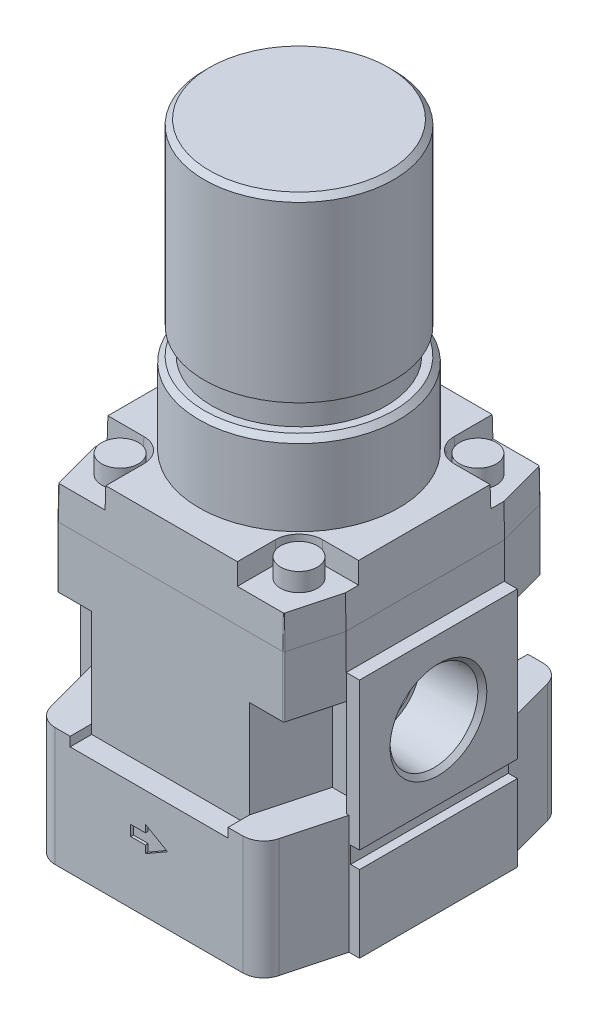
ISO-10303-21;
HEADER;
FILE_DESCRIPTION(('STEP AP214'),'2;1');
FILE_NAME('part.step','',(''),(''),'','','');
FILE_SCHEMA(('AUTOMOTIVE_DESIGN { 1 0 10303 214 1 1 1 1 }'));
ENDSEC;
DATA;
#1=APPLICATION_CONTEXT('core data for automotive mechanical design processes');
#2=APPLICATION_PROTOCOL_DEFINITION('international standard','automotive_design',2000,#1);
#3=PRODUCT_CONTEXT('',#1,'mechanical');
#4=PRODUCT('Part','Part','',(#3));
#5=PRODUCT_RELATED_PRODUCT_CATEGORY('part','',(#4));
#6=PRODUCT_DEFINITION_FORMATION('','',#4);
#7=PRODUCT_DEFINITION_CONTEXT('part definition',#1,'design');
#8=PRODUCT_DEFINITION('design','',#6,#7);
#9=PRODUCT_DEFINITION_SHAPE('','',#8);
#10=(LENGTH_UNIT() NAMED_UNIT(*) SI_UNIT(.MILLI.,.METRE.));
#11=(NAMED_UNIT(*) PLANE_ANGLE_UNIT() SI_UNIT($,.RADIAN.));
#12=(NAMED_UNIT(*) SI_UNIT($,.STERADIAN.) SOLID_ANGLE_UNIT());
#13=UNCERTAINTY_MEASURE_WITH_UNIT(LENGTH_MEASURE(1.E-05),#10,'distance_accuracy_value','');
#14=(GEOMETRIC_REPRESENTATION_CONTEXT(3) GLOBAL_UNCERTAINTY_ASSIGNED_CONTEXT((#13)) GLOBAL_UNIT_ASSIGNED_CONTEXT((#10,
#11,#12)) REPRESENTATION_CONTEXT('',''));
#15=CARTESIAN_POINT('',(0.,0.,0.));
#16=DIRECTION('',(0.,0.,1.));
#17=DIRECTION('',(1.,0.,0.));
#18=AXIS2_PLACEMENT_3D('',#15,#16,#17);
#19=CARTESIAN_POINT('',(-26.5,-9.25,-15.));
#20=DIRECTION('',(0.,-1.,0.));
#21=DIRECTION('',(0.,0.,-1.));
#22=AXIS2_PLACEMENT_3D('',#19,#20,#21);
#23=PLANE('',#22);
#24=DIRECTION('',(0.258819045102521,0.,-0.965925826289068));
#25=VECTOR('',#24,1.);
#26=CARTESIAN_POINT('',(-18.1203539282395,-9.25,-12.7546806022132));
#27=LINE('',#26,#25);
#28=CARTESIAN_POINT('',(-15.,-9.25,-24.4));
#29=VERTEX_POINT('',#28);
#30=CARTESIAN_POINT('',(-18.3225699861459,-9.25,-12.));
#31=VERTEX_POINT('',#30);
#32=EDGE_CURVE('E106',#29,#31,#27,.F.);
#33=ORIENTED_EDGE('',*,*,#32,.F.);
#34=DIRECTION('',(0.,0.,-1.));
#35=VECTOR('',#34,1.);
#36=CARTESIAN_POINT('',(-15.,-9.25,-15.));
#37=LINE('',#36,#35);
#38=CARTESIAN_POINT('',(-15.,-9.25,-28.5));
#39=VERTEX_POINT('',#38);
#40=EDGE_CURVE('E876',#29,#39,#37,.T.);
#41=ORIENTED_EDGE('',*,*,#40,.T.);
#42=DIRECTION('',(-1.,0.,0.));
#43=VECTOR('',#42,1.);
#44=CARTESIAN_POINT('',(20.9,-9.25,-28.5));
#45=LINE('',#44,#43);
#46=CARTESIAN_POINT('',(-17.8306920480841,-9.25,-28.5));
#47=VERTEX_POINT('',#46);
#48=EDGE_CURVE('E405',#39,#47,#45,.T.);
#49=ORIENTED_EDGE('',*,*,#48,.T.);
#50=CARTESIAN_POINT('',(-17.8306920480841,-9.25,-24.5));
#51=DIRECTION('',(0.,-1.,0.));
#52=DIRECTION('',(0.,0.,-1.));
#53=AXIS2_PLACEMENT_3D('',#50,#51,#52);
#54=CIRCLE('',#53,4.);
#55=CARTESIAN_POINT('',(-21.6943953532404,-9.25,-25.5352761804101));
#56=VERTEX_POINT('',#55);
#57=EDGE_CURVE('E258',#47,#56,#54,.F.);
#58=ORIENTED_EDGE('',*,*,#57,.T.);
#59=DIRECTION('',(-0.258819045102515,0.,0.96592582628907));
#60=VECTOR('',#59,1.);
#61=CARTESIAN_POINT('',(-20.9,-9.25,-28.5));
#62=LINE('',#61,#60);
#63=CARTESIAN_POINT('',(-24.5173140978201,-9.25,-15.));
#64=VERTEX_POINT('',#63);
#65=EDGE_CURVE('E400',#56,#64,#62,.T.);
#66=ORIENTED_EDGE('',*,*,#65,.T.);
#67=DIRECTION('',(1.,0.,0.));
#68=VECTOR('',#67,1.);
#69=CARTESIAN_POINT('',(-24.,-9.25,-15.));
#70=LINE('',#69,#68);
#71=CARTESIAN_POINT('',(-24.,-9.25,-15.));
#72=VERTEX_POINT('',#71);
#73=EDGE_CURVE('E427',#64,#72,#70,.T.);
#74=ORIENTED_EDGE('',*,*,#73,.T.);
#75=DIRECTION('',(0.500000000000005,0.,0.866025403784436));
#76=VECTOR('',#75,1.);
#77=CARTESIAN_POINT('',(-24.,-9.25,-15.));
#78=LINE('',#77,#76);
#79=CARTESIAN_POINT('',(-22.2679491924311,-9.25,-12.));
#80=VERTEX_POINT('',#79);
#81=EDGE_CURVE('E98',#72,#80,#78,.T.);
#82=ORIENTED_EDGE('',*,*,#81,.T.);
#83=DIRECTION('',(1.,0.,0.));
#84=VECTOR('',#83,1.);
#85=CARTESIAN_POINT('',(-22.2679491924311,-9.25,-12.));
#86=LINE('',#85,#84);
#87=EDGE_CURVE('E97',#80,#31,#86,.T.);
#88=ORIENTED_EDGE('',*,*,#87,.T.);
#89=EDGE_LOOP('',(#33,#41,#49,#58,#66,#74,#82,#88));
#90=FACE_BOUND('',#89,.T.);
#91=ADVANCED_FACE('F16',(#90),#23,.F.);
#92=CARTESIAN_POINT('',(26.5,-9.25,15.));
#93=DIRECTION('',(0.,-1.,0.));
#94=DIRECTION('',(0.,0.,-1.));
#95=AXIS2_PLACEMENT_3D('',#92,#93,#94);
#96=PLANE('',#95);
#97=DIRECTION('',(0.,0.,1.));
#98=VECTOR('',#97,1.);
#99=CARTESIAN_POINT('',(-15.,-9.25,15.));
#100=LINE('',#99,#98);
#101=CARTESIAN_POINT('',(-15.,-9.25,24.4));
#102=VERTEX_POINT('',#101);
#103=CARTESIAN_POINT('',(-15.,-9.25,28.5));
#104=VERTEX_POINT('',#103);
#105=EDGE_CURVE('E849',#102,#104,#100,.T.);
#106=ORIENTED_EDGE('',*,*,#105,.F.);
#107=DIRECTION('',(-0.258819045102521,0.,-0.965925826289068));
#108=VECTOR('',#107,1.);
#109=CARTESIAN_POINT('',(-14.5700271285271,-9.25,26.0046806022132));
#110=LINE('',#109,#108);
#111=CARTESIAN_POINT('',(-18.3225699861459,-9.25,12.));
#112=VERTEX_POINT('',#111);
#113=EDGE_CURVE('E115',#112,#102,#110,.F.);
#114=ORIENTED_EDGE('',*,*,#113,.F.);
#115=DIRECTION('',(-1.,0.,0.));
#116=VECTOR('',#115,1.);
#117=CARTESIAN_POINT('',(-22.2679491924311,-9.25,12.));
#118=LINE('',#117,#116);
#119=CARTESIAN_POINT('',(-22.2679491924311,-9.25,12.));
#120=VERTEX_POINT('',#119);
#121=EDGE_CURVE('E509',#112,#120,#118,.T.);
#122=ORIENTED_EDGE('',*,*,#121,.T.);
#123=DIRECTION('',(-0.500000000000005,0.,0.866025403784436));
#124=VECTOR('',#123,1.);
#125=CARTESIAN_POINT('',(-24.,-9.25,15.));
#126=LINE('',#125,#124);
#127=CARTESIAN_POINT('',(-24.,-9.25,15.));
#128=VERTEX_POINT('',#127);
#129=EDGE_CURVE('E503',#120,#128,#126,.T.);
#130=ORIENTED_EDGE('',*,*,#129,.T.);
#131=DIRECTION('',(-1.,0.,0.));
#132=VECTOR('',#131,1.);
#133=CARTESIAN_POINT('',(-24.,-9.25,15.));
#134=LINE('',#133,#132);
#135=CARTESIAN_POINT('',(-24.5173140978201,-9.25,15.));
#136=VERTEX_POINT('',#135);
#137=EDGE_CURVE('E474',#128,#136,#134,.T.);
#138=ORIENTED_EDGE('',*,*,#137,.T.);
#139=DIRECTION('',(0.258819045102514,0.,0.96592582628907));
#140=VECTOR('',#139,1.);
#141=CARTESIAN_POINT('',(-20.9,-9.25,28.5));
#142=LINE('',#141,#140);
#143=CARTESIAN_POINT('',(-21.6943953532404,-9.25,25.5352761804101));
#144=VERTEX_POINT('',#143);
#145=EDGE_CURVE('E441',#136,#144,#142,.T.);
#146=ORIENTED_EDGE('',*,*,#145,.T.);
#147=CARTESIAN_POINT('',(-17.8306920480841,-9.25,24.5));
#148=DIRECTION('',(0.,-1.,0.));
#149=DIRECTION('',(0.,0.,-1.));
#150=AXIS2_PLACEMENT_3D('',#147,#148,#149);
#151=CIRCLE('',#150,4.);
#152=CARTESIAN_POINT('',(-17.8306920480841,-9.25,28.5));
#153=VERTEX_POINT('',#152);
#154=EDGE_CURVE('E453',#144,#153,#151,.F.);
#155=ORIENTED_EDGE('',*,*,#154,.T.);
#156=DIRECTION('',(1.,0.,0.));
#157=VECTOR('',#156,1.);
#158=CARTESIAN_POINT('',(20.9,-9.25,28.5));
#159=LINE('',#158,#157);
#160=EDGE_CURVE('E459',#153,#104,#159,.T.);
#161=ORIENTED_EDGE('',*,*,#160,.T.);
#162=EDGE_LOOP('',(#106,#114,#122,#130,#138,#146,#155,#161));
#163=FACE_BOUND('',#162,.T.);
#164=ADVANCED_FACE('F1591',(#163),#96,.F.);
#165=DIRECTION('',(0.,0.,-1.));
#166=VECTOR('',#165,1.);
#167=CARTESIAN_POINT('',(15.,-9.25,15.));
#168=LINE('',#167,#166);
#169=CARTESIAN_POINT('',(15.,-9.25,28.5));
#170=VERTEX_POINT('',#169);
#171=CARTESIAN_POINT('',(15.,-9.25,24.4));
#172=VERTEX_POINT('',#171);
#173=EDGE_CURVE('E856',#170,#172,#168,.T.);
#174=ORIENTED_EDGE('',*,*,#173,.F.);
#175=CARTESIAN_POINT('',(17.8306920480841,-9.25,28.5));
#176=VERTEX_POINT('',#175);
#177=EDGE_CURVE('E462',#170,#176,#159,.T.);
#178=ORIENTED_EDGE('',*,*,#177,.T.);
#179=CARTESIAN_POINT('',(17.8306920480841,-9.25,24.5));
#180=DIRECTION('',(0.,-1.,0.));
#181=DIRECTION('',(0.,0.,-1.));
#182=AXIS2_PLACEMENT_3D('',#179,#180,#181);
#183=CIRCLE('',#182,4.);
#184=CARTESIAN_POINT('',(21.6943953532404,-9.25,25.5352761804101));
#185=VERTEX_POINT('',#184);
#186=EDGE_CURVE('E252',#176,#185,#183,.F.);
#187=ORIENTED_EDGE('',*,*,#186,.T.);
#188=DIRECTION('',(0.258819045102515,0.,-0.96592582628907));
#189=VECTOR('',#188,1.);
#190=CARTESIAN_POINT('',(20.9,-9.25,28.5));
#191=LINE('',#190,#189);
#192=CARTESIAN_POINT('',(24.5173140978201,-9.25,15.));
#193=VERTEX_POINT('',#192);
#194=EDGE_CURVE('E456',#185,#193,#191,.T.);
#195=ORIENTED_EDGE('',*,*,#194,.T.);
#196=DIRECTION('',(-1.,0.,0.));
#197=VECTOR('',#196,1.);
#198=CARTESIAN_POINT('',(24.,-9.25,15.));
#199=LINE('',#198,#197);
#200=CARTESIAN_POINT('',(24.,-9.25,15.));
#201=VERTEX_POINT('',#200);
#202=EDGE_CURVE('E486',#193,#201,#199,.T.);
#203=ORIENTED_EDGE('',*,*,#202,.T.);
#204=DIRECTION('',(-0.500000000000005,0.,-0.866025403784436));
#205=VECTOR('',#204,1.);
#206=CARTESIAN_POINT('',(24.,-9.25,15.));
#207=LINE('',#206,#205);
#208=CARTESIAN_POINT('',(22.2679491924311,-9.25,12.));
#209=VERTEX_POINT('',#208);
#210=EDGE_CURVE('E510',#201,#209,#207,.T.);
#211=ORIENTED_EDGE('',*,*,#210,.T.);
#212=CARTESIAN_POINT('',(18.3225699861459,-9.25,12.));
#213=VERTEX_POINT('',#212);
#214=EDGE_CURVE('E506',#209,#213,#118,.T.);
#215=ORIENTED_EDGE('',*,*,#214,.T.);
#216=DIRECTION('',(-0.258819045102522,0.,0.965925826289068));
#217=VECTOR('',#216,1.);
#218=CARTESIAN_POINT('',(18.1203539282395,-9.25,12.7546806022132));
#219=LINE('',#218,#217);
#220=EDGE_CURVE('E104',#172,#213,#219,.F.);
#221=ORIENTED_EDGE('',*,*,#220,.F.);
#222=EDGE_LOOP('',(#174,#178,#187,#195,#203,#211,#215,#221));
#223=FACE_BOUND('',#222,.T.);
#224=ADVANCED_FACE('F1598',(#223),#96,.F.);
#225=CARTESIAN_POINT('',(20.9,-31.8,28.5));
#226=DIRECTION('',(0.,0.,1.));
#227=DIRECTION('',(1.,0.,0.));
#228=AXIS2_PLACEMENT_3D('',#225,#226,#227);
#229=PLANE('',#228);
#230=DIRECTION('',(-1.,0.,0.));
#231=VECTOR('',#230,1.);
#232=CARTESIAN_POINT('',(-0.699999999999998,-18.,28.5));
#233=LINE('',#232,#231);
#234=CARTESIAN_POINT('',(-0.699999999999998,-18.,28.5));
#235=VERTEX_POINT('',#234);
#236=CARTESIAN_POINT('',(-3.5,-18.,28.5));
#237=VERTEX_POINT('',#236);
#238=EDGE_CURVE('E33',#235,#237,#233,.T.);
#239=ORIENTED_EDGE('',*,*,#238,.F.);
#240=DIRECTION('',(0.,-1.,0.));
#241=VECTOR('',#240,1.);
#242=CARTESIAN_POINT('',(-0.699999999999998,-16.575,28.5));
#243=LINE('',#242,#241);
#244=CARTESIAN_POINT('',(-0.699999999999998,-16.575,28.5));
#245=VERTEX_POINT('',#244);
#246=EDGE_CURVE('E958',#245,#235,#243,.T.);
#247=ORIENTED_EDGE('',*,*,#246,.F.);
#248=DIRECTION('',(-0.866013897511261,0.500019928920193,0.));
#249=VECTOR('',#248,1.);
#250=CARTESIAN_POINT('',(3.5,-19.,28.5));
#251=LINE('',#250,#249);
#252=CARTESIAN_POINT('',(3.5,-19.,28.5));
#253=VERTEX_POINT('',#252);
#254=EDGE_CURVE('E962',#253,#245,#251,.T.);
#255=ORIENTED_EDGE('',*,*,#254,.F.);
#256=DIRECTION('',(0.866013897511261,0.500019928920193,0.));
#257=VECTOR('',#256,1.);
#258=CARTESIAN_POINT('',(-0.699999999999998,-21.425,28.5));
#259=LINE('',#258,#257);
#260=CARTESIAN_POINT('',(-0.699999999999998,-21.425,28.5));
#261=VERTEX_POINT('',#260);
#262=EDGE_CURVE('E965',#261,#253,#259,.T.);
#263=ORIENTED_EDGE('',*,*,#262,.F.);
#264=DIRECTION('',(0.,-1.,0.));
#265=VECTOR('',#264,1.);
#266=CARTESIAN_POINT('',(-0.699999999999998,-20.,28.5));
#267=LINE('',#266,#265);
#268=CARTESIAN_POINT('',(-0.699999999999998,-20.,28.5));
#269=VERTEX_POINT('',#268);
#270=EDGE_CURVE('E968',#269,#261,#267,.T.);
#271=ORIENTED_EDGE('',*,*,#270,.F.);
#272=DIRECTION('',(1.,0.,0.));
#273=VECTOR('',#272,1.);
#274=CARTESIAN_POINT('',(-3.5,-20.,28.5));
#275=LINE('',#274,#273);
#276=CARTESIAN_POINT('',(-3.5,-20.,28.5));
#277=VERTEX_POINT('',#276);
#278=EDGE_CURVE('E971',#277,#269,#275,.T.);
#279=ORIENTED_EDGE('',*,*,#278,.F.);
#280=DIRECTION('',(0.,-1.,0.));
#281=VECTOR('',#280,1.);
#282=CARTESIAN_POINT('',(-3.5,-18.,28.5));
#283=LINE('',#282,#281);
#284=EDGE_CURVE('E974',#237,#277,#283,.T.);
#285=ORIENTED_EDGE('',*,*,#284,.F.);
#286=EDGE_LOOP('',(#239,#247,#255,#263,#271,#279,#285));
#287=FACE_BOUND('',#286,.T.);
#288=DIRECTION('',(1.,0.,0.));
#289=VECTOR('',#288,1.);
#290=CARTESIAN_POINT('',(-15.,-11.,28.5));
#291=LINE('',#290,#289);
#292=CARTESIAN_POINT('',(-15.,-11.,28.5));
#293=VERTEX_POINT('',#292);
#294=CARTESIAN_POINT('',(15.,-11.,28.5));
#295=VERTEX_POINT('',#294);
#296=EDGE_CURVE('E879',#293,#295,#291,.T.);
#297=ORIENTED_EDGE('',*,*,#296,.F.);
#298=DIRECTION('',(0.,-1.,0.));
#299=VECTOR('',#298,1.);
#300=CARTESIAN_POINT('',(-15.,0.,28.5));
#301=LINE('',#300,#299);
#302=EDGE_CURVE('E869',#104,#293,#301,.T.);
#303=ORIENTED_EDGE('',*,*,#302,.F.);
#304=ORIENTED_EDGE('',*,*,#160,.F.);
#305=DIRECTION('',(0.,1.,0.));
#306=VECTOR('',#305,1.);
#307=CARTESIAN_POINT('',(-17.8306920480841,-31.8,28.5));
#308=LINE('',#307,#306);
#309=CARTESIAN_POINT('',(-17.8306920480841,-31.8,28.5));
#310=VERTEX_POINT('',#309);
#311=EDGE_CURVE('E291',#153,#310,#308,.F.);
#312=ORIENTED_EDGE('',*,*,#311,.T.);
#313=DIRECTION('',(1.,0.,0.));
#314=VECTOR('',#313,1.);
#315=CARTESIAN_POINT('',(20.9,-31.8,28.5));
#316=LINE('',#315,#314);
#317=CARTESIAN_POINT('',(17.8306920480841,-31.8,28.5));
#318=VERTEX_POINT('',#317);
#319=EDGE_CURVE('E346',#310,#318,#316,.T.);
#320=ORIENTED_EDGE('',*,*,#319,.T.);
#321=DIRECTION('',(0.,1.,0.));
#322=VECTOR('',#321,1.);
#323=CARTESIAN_POINT('',(17.8306920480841,-31.8,28.5));
#324=LINE('',#323,#322);
#325=EDGE_CURVE('E294',#318,#176,#324,.T.);
#326=ORIENTED_EDGE('',*,*,#325,.T.);
#327=ORIENTED_EDGE('',*,*,#177,.F.);
#328=DIRECTION('',(0.,1.,0.));
#329=VECTOR('',#328,1.);
#330=CARTESIAN_POINT('',(15.,0.,28.5));
#331=LINE('',#330,#329);
#332=EDGE_CURVE('E865',#295,#170,#331,.T.);
#333=ORIENTED_EDGE('',*,*,#332,.F.);
#334=EDGE_LOOP('',(#297,#303,#304,#312,#320,#326,#327,#333));
#335=FACE_BOUND('',#334,.T.);
#336=ADVANCED_FACE('F1604',(#287,#335),#229,.T.);
#337=CARTESIAN_POINT('',(17.8306920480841,-9.25,-28.5));
#338=VERTEX_POINT('',#337);
#339=CARTESIAN_POINT('',(15.,-9.25,-28.5));
#340=VERTEX_POINT('',#339);
#341=EDGE_CURVE('E403',#338,#340,#45,.T.);
#342=ORIENTED_EDGE('',*,*,#341,.T.);
#343=DIRECTION('',(0.,0.,1.));
#344=VECTOR('',#343,1.);
#345=CARTESIAN_POINT('',(15.,-9.25,-15.));
#346=LINE('',#345,#344);
#347=CARTESIAN_POINT('',(15.,-9.25,-24.4));
#348=VERTEX_POINT('',#347);
#349=EDGE_CURVE('E83',#340,#348,#346,.T.);
#350=ORIENTED_EDGE('',*,*,#349,.T.);
#351=DIRECTION('',(0.258819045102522,0.,0.965925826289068));
#352=VECTOR('',#351,1.);
#353=CARTESIAN_POINT('',(14.5700271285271,-9.25,-26.0046806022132));
#354=LINE('',#353,#352);
#355=CARTESIAN_POINT('',(18.3225699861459,-9.25,-12.));
#356=VERTEX_POINT('',#355);
#357=EDGE_CURVE('E20',#356,#348,#354,.F.);
#358=ORIENTED_EDGE('',*,*,#357,.F.);
#359=CARTESIAN_POINT('',(22.2679491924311,-9.25,-12.));
#360=VERTEX_POINT('',#359);
#361=EDGE_CURVE('E80',#356,#360,#86,.T.);
#362=ORIENTED_EDGE('',*,*,#361,.T.);
#363=DIRECTION('',(0.500000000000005,0.,-0.866025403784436));
#364=VECTOR('',#363,1.);
#365=CARTESIAN_POINT('',(24.,-9.25,-15.));
#366=LINE('',#365,#364);
#367=CARTESIAN_POINT('',(24.,-9.25,-15.));
#368=VERTEX_POINT('',#367);
#369=EDGE_CURVE('E444',#360,#368,#366,.T.);
#370=ORIENTED_EDGE('',*,*,#369,.T.);
#371=DIRECTION('',(1.,0.,0.));
#372=VECTOR('',#371,1.);
#373=CARTESIAN_POINT('',(24.,-9.25,-15.));
#374=LINE('',#373,#372);
#375=CARTESIAN_POINT('',(24.5173140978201,-9.25,-15.));
#376=VERTEX_POINT('',#375);
#377=EDGE_CURVE('E417',#368,#376,#374,.T.);
#378=ORIENTED_EDGE('',*,*,#377,.T.);
#379=DIRECTION('',(-0.258819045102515,0.,-0.96592582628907));
#380=VECTOR('',#379,1.);
#381=CARTESIAN_POINT('',(20.9,-9.25,-28.5));
#382=LINE('',#381,#380);
#383=CARTESIAN_POINT('',(21.6943953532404,-9.25,-25.5352761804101));
#384=VERTEX_POINT('',#383);
#385=EDGE_CURVE('E394',#376,#384,#382,.T.);
#386=ORIENTED_EDGE('',*,*,#385,.T.);
#387=CARTESIAN_POINT('',(17.8306920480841,-9.25,-24.5));
#388=DIRECTION('',(0.,-1.,0.));
#389=DIRECTION('',(0.,0.,-1.));
#390=AXIS2_PLACEMENT_3D('',#387,#388,#389);
#391=CIRCLE('',#390,4.);
#392=EDGE_CURVE('E397',#384,#338,#391,.F.);
#393=ORIENTED_EDGE('',*,*,#392,.T.);
#394=EDGE_LOOP('',(#342,#350,#358,#362,#370,#378,#386,#393));
#395=FACE_BOUND('',#394,.T.);
#396=ADVANCED_FACE('F77',(#395),#23,.F.);
#397=CARTESIAN_POINT('',(-22.2679491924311,-9.25,-12.));
#398=DIRECTION('',(0.,0.,1.));
#399=DIRECTION('',(1.,0.,0.));
#400=AXIS2_PLACEMENT_3D('',#397,#398,#399);
#401=PLANE('',#400);
#402=DIRECTION('',(0.,-1.,0.));
#403=VECTOR('',#402,1.);
#404=CARTESIAN_POINT('',(-18.3225699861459,-9.25,-12.));
#405=LINE('',#404,#403);
#406=CARTESIAN_POINT('',(-18.3225699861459,9.25,-12.));
#407=VERTEX_POINT('',#406);
#408=EDGE_CURVE('E110',#31,#407,#405,.F.);
#409=ORIENTED_EDGE('',*,*,#408,.F.);
#410=ORIENTED_EDGE('',*,*,#87,.F.);
#411=DIRECTION('',(0.,1.,0.));
#412=VECTOR('',#411,1.);
#413=CARTESIAN_POINT('',(-22.2679491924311,-9.25,-12.));
#414=LINE('',#413,#412);
#415=CARTESIAN_POINT('',(-22.2679491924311,9.25,-12.));
#416=VERTEX_POINT('',#415);
#417=EDGE_CURVE('E416',#80,#416,#414,.T.);
#418=ORIENTED_EDGE('',*,*,#417,.T.);
#419=DIRECTION('',(1.,0.,0.));
#420=VECTOR('',#419,1.);
#421=CARTESIAN_POINT('',(-22.2679491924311,9.25,-12.));
#422=LINE('',#421,#420);
#423=EDGE_CURVE('E431',#416,#407,#422,.T.);
#424=ORIENTED_EDGE('',*,*,#423,.T.);
#425=EDGE_LOOP('',(#409,#410,#418,#424));
#426=FACE_BOUND('',#425,.T.);
#427=ADVANCED_FACE('F1437',(#426),#401,.F.);
#428=DIRECTION('',(0.,1.,0.));
#429=VECTOR('',#428,1.);
#430=CARTESIAN_POINT('',(18.3225699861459,-9.25,-12.));
#431=LINE('',#430,#429);
#432=CARTESIAN_POINT('',(18.3225699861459,9.25,-12.));
#433=VERTEX_POINT('',#432);
#434=EDGE_CURVE('E89',#433,#356,#431,.F.);
#435=ORIENTED_EDGE('',*,*,#434,.F.);
#436=CARTESIAN_POINT('',(22.2679491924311,9.25,-12.));
#437=VERTEX_POINT('',#436);
#438=EDGE_CURVE('E434',#433,#437,#422,.T.);
#439=ORIENTED_EDGE('',*,*,#438,.T.);
#440=DIRECTION('',(0.,1.,0.));
#441=VECTOR('',#440,1.);
#442=CARTESIAN_POINT('',(22.2679491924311,-9.25,-12.));
#443=LINE('',#442,#441);
#444=EDGE_CURVE('E95',#360,#437,#443,.T.);
#445=ORIENTED_EDGE('',*,*,#444,.F.);
#446=ORIENTED_EDGE('',*,*,#361,.F.);
#447=EDGE_LOOP('',(#435,#439,#445,#446));
#448=FACE_BOUND('',#447,.T.);
#449=ADVANCED_FACE('F91',(#448),#401,.F.);
#450=CARTESIAN_POINT('',(-22.2679491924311,-9.25,12.));
#451=DIRECTION('',(0.,0.,-1.));
#452=DIRECTION('',(-1.,0.,0.));
#453=AXIS2_PLACEMENT_3D('',#450,#451,#452);
#454=PLANE('',#453);
#455=DIRECTION('',(0.,1.,0.));
#456=VECTOR('',#455,1.);
#457=CARTESIAN_POINT('',(-18.3225699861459,-9.25,12.));
#458=LINE('',#457,#456);
#459=CARTESIAN_POINT('',(-18.3225699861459,9.25,12.));
#460=VERTEX_POINT('',#459);
#461=EDGE_CURVE('E126',#460,#112,#458,.F.);
#462=ORIENTED_EDGE('',*,*,#461,.F.);
#463=DIRECTION('',(-1.,0.,0.));
#464=VECTOR('',#463,1.);
#465=CARTESIAN_POINT('',(-22.2679491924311,9.25,12.));
#466=LINE('',#465,#464);
#467=CARTESIAN_POINT('',(-22.2679491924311,9.25,12.));
#468=VERTEX_POINT('',#467);
#469=EDGE_CURVE('E493',#460,#468,#466,.T.);
#470=ORIENTED_EDGE('',*,*,#469,.T.);
#471=DIRECTION('',(0.,1.,0.));
#472=VECTOR('',#471,1.);
#473=CARTESIAN_POINT('',(-22.2679491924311,-9.25,12.));
#474=LINE('',#473,#472);
#475=EDGE_CURVE('E477',#120,#468,#474,.T.);
#476=ORIENTED_EDGE('',*,*,#475,.F.);
#477=ORIENTED_EDGE('',*,*,#121,.F.);
#478=EDGE_LOOP('',(#462,#470,#476,#477));
#479=FACE_BOUND('',#478,.T.);
#480=ADVANCED_FACE('F2006',(#479),#454,.F.);
#481=DIRECTION('',(0.,-1.,0.));
#482=VECTOR('',#481,1.);
#483=CARTESIAN_POINT('',(18.3225699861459,-9.25,12.));
#484=LINE('',#483,#482);
#485=CARTESIAN_POINT('',(18.3225699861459,9.25,12.));
#486=VERTEX_POINT('',#485);
#487=EDGE_CURVE('E118',#213,#486,#484,.F.);
#488=ORIENTED_EDGE('',*,*,#487,.F.);
#489=ORIENTED_EDGE('',*,*,#214,.F.);
#490=DIRECTION('',(0.,1.,0.));
#491=VECTOR('',#490,1.);
#492=CARTESIAN_POINT('',(22.2679491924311,-9.25,12.));
#493=LINE('',#492,#491);
#494=CARTESIAN_POINT('',(22.2679491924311,9.25,12.));
#495=VERTEX_POINT('',#494);
#496=EDGE_CURVE('E473',#209,#495,#493,.T.);
#497=ORIENTED_EDGE('',*,*,#496,.T.);
#498=EDGE_CURVE('E490',#495,#486,#466,.T.);
#499=ORIENTED_EDGE('',*,*,#498,.T.);
#500=EDGE_LOOP('',(#488,#489,#497,#499));
#501=FACE_BOUND('',#500,.T.);
#502=ADVANCED_FACE('F2008',(#501),#454,.F.);
#503=CARTESIAN_POINT('',(-26.5,9.25,-15.));
#504=DIRECTION('',(0.,-1.,0.));
#505=DIRECTION('',(0.,0.,-1.));
#506=AXIS2_PLACEMENT_3D('',#503,#504,#505);
#507=PLANE('',#506);
#508=DIRECTION('',(1.,0.,0.));
#509=VECTOR('',#508,1.);
#510=CARTESIAN_POINT('',(-21.5,9.25,-24.4));
#511=LINE('',#510,#509);
#512=CARTESIAN_POINT('',(-21.3081682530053,9.25,-24.4));
#513=VERTEX_POINT('',#512);
#514=CARTESIAN_POINT('',(-15.,9.25,-24.4));
#515=VERTEX_POINT('',#514);
#516=EDGE_CURVE('E409',#513,#515,#511,.T.);
#517=ORIENTED_EDGE('',*,*,#516,.T.);
#518=DIRECTION('',(0.258819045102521,0.,-0.965925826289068));
#519=VECTOR('',#518,1.);
#520=CARTESIAN_POINT('',(-18.1203539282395,9.25,-12.7546806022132));
#521=LINE('',#520,#519);
#522=EDGE_CURVE('E113',#515,#407,#521,.F.);
#523=ORIENTED_EDGE('',*,*,#522,.T.);
#524=ORIENTED_EDGE('',*,*,#423,.F.);
#525=DIRECTION('',(0.500000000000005,0.,0.866025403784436));
#526=VECTOR('',#525,1.);
#527=CARTESIAN_POINT('',(-24.,9.25,-15.));
#528=LINE('',#527,#526);
#529=CARTESIAN_POINT('',(-24.,9.25,-15.));
#530=VERTEX_POINT('',#529);
#531=EDGE_CURVE('E435',#530,#416,#528,.T.);
#532=ORIENTED_EDGE('',*,*,#531,.F.);
#533=DIRECTION('',(1.,0.,0.));
#534=VECTOR('',#533,1.);
#535=CARTESIAN_POINT('',(-24.,9.25,-15.));
#536=LINE('',#535,#534);
#537=CARTESIAN_POINT('',(-24.0187224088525,9.25,-15.));
#538=VERTEX_POINT('',#537);
#539=EDGE_CURVE('E438',#538,#530,#536,.T.);
#540=ORIENTED_EDGE('',*,*,#539,.F.);
#541=DIRECTION('',(0.258819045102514,0.,-0.96592582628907));
#542=VECTOR('',#541,1.);
#543=CARTESIAN_POINT('',(-24.0187224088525,9.25,-15.));
#544=LINE('',#543,#542);
#545=CARTESIAN_POINT('',(-21.5496497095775,9.25,-24.2147047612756));
#546=VERTEX_POINT('',#545);
#547=EDGE_CURVE('E261',#538,#546,#544,.T.);
#548=ORIENTED_EDGE('',*,*,#547,.T.);
#549=CARTESIAN_POINT('',(-21.3081682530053,9.25,-24.15));
#550=DIRECTION('',(0.,-1.,0.));
#551=DIRECTION('',(0.,0.,-1.));
#552=AXIS2_PLACEMENT_3D('',#549,#550,#551);
#553=CIRCLE('',#552,0.25);
#554=EDGE_CURVE('E213',#546,#513,#553,.T.);
#555=ORIENTED_EDGE('',*,*,#554,.T.);
#556=EDGE_LOOP('',(#517,#523,#524,#532,#540,#548,#555));
#557=FACE_BOUND('',#556,.T.);
#558=ADVANCED_FACE('F1417',(#557),#507,.T.);
#559=ORIENTED_EDGE('',*,*,#438,.F.);
#560=DIRECTION('',(0.258819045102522,0.,0.965925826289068));
#561=VECTOR('',#560,1.);
#562=CARTESIAN_POINT('',(14.5700271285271,9.25,-26.0046806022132));
#563=LINE('',#562,#561);
#564=CARTESIAN_POINT('',(15.,9.25,-24.4));
#565=VERTEX_POINT('',#564);
#566=EDGE_CURVE('E102',#433,#565,#563,.F.);
#567=ORIENTED_EDGE('',*,*,#566,.T.);
#568=CARTESIAN_POINT('',(21.3081682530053,9.25,-24.4));
#569=VERTEX_POINT('',#568);
#570=EDGE_CURVE('E412',#565,#569,#511,.T.);
#571=ORIENTED_EDGE('',*,*,#570,.T.);
#572=CARTESIAN_POINT('',(21.3081682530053,9.25,-24.15));
#573=DIRECTION('',(0.,-1.,0.));
#574=DIRECTION('',(0.,0.,-1.));
#575=AXIS2_PLACEMENT_3D('',#572,#573,#574);
#576=CIRCLE('',#575,0.25);
#577=CARTESIAN_POINT('',(21.5496497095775,9.25,-24.2147047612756));
#578=VERTEX_POINT('',#577);
#579=EDGE_CURVE('E210',#569,#578,#576,.T.);
#580=ORIENTED_EDGE('',*,*,#579,.T.);
#581=DIRECTION('',(0.258819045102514,0.,0.96592582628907));
#582=VECTOR('',#581,1.);
#583=CARTESIAN_POINT('',(24.0187224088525,9.25,-15.));
#584=LINE('',#583,#582);
#585=CARTESIAN_POINT('',(24.0187224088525,9.25,-15.));
#586=VERTEX_POINT('',#585);
#587=EDGE_CURVE('E406',#578,#586,#584,.T.);
#588=ORIENTED_EDGE('',*,*,#587,.T.);
#589=DIRECTION('',(1.,0.,0.));
#590=VECTOR('',#589,1.);
#591=CARTESIAN_POINT('',(24.,9.25,-15.));
#592=LINE('',#591,#590);
#593=CARTESIAN_POINT('',(24.,9.25,-15.));
#594=VERTEX_POINT('',#593);
#595=EDGE_CURVE('E424',#594,#586,#592,.T.);
#596=ORIENTED_EDGE('',*,*,#595,.F.);
#597=DIRECTION('',(0.500000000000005,0.,-0.866025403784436));
#598=VECTOR('',#597,1.);
#599=CARTESIAN_POINT('',(24.,9.25,-15.));
#600=LINE('',#599,#598);
#601=EDGE_CURVE('E428',#437,#594,#600,.T.);
#602=ORIENTED_EDGE('',*,*,#601,.F.);
#603=EDGE_LOOP('',(#559,#567,#571,#580,#588,#596,#602));
#604=FACE_BOUND('',#603,.T.);
#605=ADVANCED_FACE('F1484',(#604),#507,.T.);
#606=CARTESIAN_POINT('',(26.5,9.25,15.));
#607=DIRECTION('',(0.,-1.,0.));
#608=DIRECTION('',(0.,0.,-1.));
#609=AXIS2_PLACEMENT_3D('',#606,#607,#608);
#610=PLANE('',#609);
#611=ORIENTED_EDGE('',*,*,#469,.F.);
#612=DIRECTION('',(-0.258819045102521,0.,-0.965925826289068));
#613=VECTOR('',#612,1.);
#614=CARTESIAN_POINT('',(-14.5700271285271,9.25,26.0046806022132));
#615=LINE('',#614,#613);
#616=CARTESIAN_POINT('',(-15.,9.25,24.4));
#617=VERTEX_POINT('',#616);
#618=EDGE_CURVE('E88',#460,#617,#615,.F.);
#619=ORIENTED_EDGE('',*,*,#618,.T.);
#620=DIRECTION('',(-1.,0.,0.));
#621=VECTOR('',#620,1.);
#622=CARTESIAN_POINT('',(-21.5,9.25,24.4));
#623=LINE('',#622,#621);
#624=CARTESIAN_POINT('',(-21.3081682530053,9.25,24.4));
#625=VERTEX_POINT('',#624);
#626=EDGE_CURVE('E469',#617,#625,#623,.T.);
#627=ORIENTED_EDGE('',*,*,#626,.T.);
#628=CARTESIAN_POINT('',(-21.3081682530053,9.25,24.15));
#629=DIRECTION('',(0.,-1.,0.));
#630=DIRECTION('',(0.,0.,-1.));
#631=AXIS2_PLACEMENT_3D('',#628,#629,#630);
#632=CIRCLE('',#631,0.25);
#633=CARTESIAN_POINT('',(-21.5496497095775,9.25,24.2147047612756));
#634=VERTEX_POINT('',#633);
#635=EDGE_CURVE('E180',#625,#634,#632,.T.);
#636=ORIENTED_EDGE('',*,*,#635,.T.);
#637=DIRECTION('',(-0.258819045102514,0.,-0.96592582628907));
#638=VECTOR('',#637,1.);
#639=CARTESIAN_POINT('',(-24.0187224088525,9.25,15.));
#640=LINE('',#639,#638);
#641=CARTESIAN_POINT('',(-24.0187224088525,9.25,15.));
#642=VERTEX_POINT('',#641);
#643=EDGE_CURVE('E463',#634,#642,#640,.T.);
#644=ORIENTED_EDGE('',*,*,#643,.T.);
#645=DIRECTION('',(-1.,0.,0.));
#646=VECTOR('',#645,1.);
#647=CARTESIAN_POINT('',(-24.,9.25,15.));
#648=LINE('',#647,#646);
#649=CARTESIAN_POINT('',(-24.,9.25,15.));
#650=VERTEX_POINT('',#649);
#651=EDGE_CURVE('E483',#650,#642,#648,.T.);
#652=ORIENTED_EDGE('',*,*,#651,.F.);
#653=DIRECTION('',(-0.500000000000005,0.,0.866025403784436));
#654=VECTOR('',#653,1.);
#655=CARTESIAN_POINT('',(-24.,9.25,15.));
#656=LINE('',#655,#654);
#657=EDGE_CURVE('E487',#468,#650,#656,.T.);
#658=ORIENTED_EDGE('',*,*,#657,.F.);
#659=EDGE_LOOP('',(#611,#619,#627,#636,#644,#652,#658));
#660=FACE_BOUND('',#659,.T.);
#661=ADVANCED_FACE('F1878',(#660),#610,.T.);
#662=CARTESIAN_POINT('',(21.3081682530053,9.25,24.4));
#663=VERTEX_POINT('',#662);
#664=CARTESIAN_POINT('',(15.,9.25,24.4));
#665=VERTEX_POINT('',#664);
#666=EDGE_CURVE('E466',#663,#665,#623,.T.);
#667=ORIENTED_EDGE('',*,*,#666,.T.);
#668=DIRECTION('',(-0.258819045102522,0.,0.965925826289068));
#669=VECTOR('',#668,1.);
#670=CARTESIAN_POINT('',(18.1203539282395,9.25,12.7546806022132));
#671=LINE('',#670,#669);
#672=EDGE_CURVE('E121',#665,#486,#671,.F.);
#673=ORIENTED_EDGE('',*,*,#672,.T.);
#674=ORIENTED_EDGE('',*,*,#498,.F.);
#675=DIRECTION('',(-0.500000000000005,0.,-0.866025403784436));
#676=VECTOR('',#675,1.);
#677=CARTESIAN_POINT('',(24.,9.25,15.));
#678=LINE('',#677,#676);
#679=CARTESIAN_POINT('',(24.,9.25,15.));
#680=VERTEX_POINT('',#679);
#681=EDGE_CURVE('E494',#680,#495,#678,.T.);
#682=ORIENTED_EDGE('',*,*,#681,.F.);
#683=DIRECTION('',(-1.,0.,0.));
#684=VECTOR('',#683,1.);
#685=CARTESIAN_POINT('',(24.,9.25,15.));
#686=LINE('',#685,#684);
#687=CARTESIAN_POINT('',(24.0187224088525,9.25,15.));
#688=VERTEX_POINT('',#687);
#689=EDGE_CURVE('E497',#688,#680,#686,.T.);
#690=ORIENTED_EDGE('',*,*,#689,.F.);
#691=DIRECTION('',(-0.258819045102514,0.,0.96592582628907));
#692=VECTOR('',#691,1.);
#693=CARTESIAN_POINT('',(24.0187224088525,9.25,15.));
#694=LINE('',#693,#692);
#695=CARTESIAN_POINT('',(21.5496497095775,9.25,24.2147047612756));
#696=VERTEX_POINT('',#695);
#697=EDGE_CURVE('E255',#688,#696,#694,.T.);
#698=ORIENTED_EDGE('',*,*,#697,.T.);
#699=CARTESIAN_POINT('',(21.3081682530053,9.25,24.15));
#700=DIRECTION('',(0.,-1.,0.));
#701=DIRECTION('',(0.,0.,-1.));
#702=AXIS2_PLACEMENT_3D('',#699,#700,#701);
#703=CIRCLE('',#702,0.25);
#704=EDGE_CURVE('E183',#696,#663,#703,.T.);
#705=ORIENTED_EDGE('',*,*,#704,.T.);
#706=EDGE_LOOP('',(#667,#673,#674,#682,#690,#698,#705));
#707=FACE_BOUND('',#706,.T.);
#708=ADVANCED_FACE('F1839',(#707),#610,.T.);
#709=CARTESIAN_POINT('',(0.,46.6,0.));
#710=DIRECTION('',(0.,-1.,0.));
#711=DIRECTION('',(0.,0.,-1.));
#712=AXIS2_PLACEMENT_3D('',#709,#710,#711);
#713=CYLINDRICAL_SURFACE('',#712,19.);
#714=CARTESIAN_POINT('',(0.,45.6,0.));
#715=DIRECTION('',(0.,1.,0.));
#716=DIRECTION('',(0.,0.,1.));
#717=AXIS2_PLACEMENT_3D('',#714,#715,#716);
#718=CIRCLE('',#717,19.);
#719=CARTESIAN_POINT('',(0.,45.6,19.));
#720=VERTEX_POINT('',#719);
#721=EDGE_CURVE('E168',#720,#720,#718,.F.);
#722=ORIENTED_EDGE('',*,*,#721,.T.);
#723=EDGE_LOOP('',(#722));
#724=FACE_BOUND('',#723,.T.);
#725=DIRECTION('',(0.,-1.,0.));
#726=VECTOR('',#725,1.);
#727=CARTESIAN_POINT('',(-18.7616630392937,46.6,-3.));
#728=LINE('',#727,#726);
#729=CARTESIAN_POINT('',(-18.7616630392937,33.1,-3.));
#730=VERTEX_POINT('',#729);
#731=CARTESIAN_POINT('',(-18.7616630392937,31.1,-3.));
#732=VERTEX_POINT('',#731);
#733=EDGE_CURVE('E815',#730,#732,#728,.T.);
#734=ORIENTED_EDGE('',*,*,#733,.F.);
#735=CARTESIAN_POINT('',(0.,33.1,0.));
#736=DIRECTION('',(0.,1.,0.));
#737=DIRECTION('',(0.,0.,1.));
#738=AXIS2_PLACEMENT_3D('',#735,#736,#737);
#739=CIRCLE('',#738,19.);
#740=CARTESIAN_POINT('',(-18.7616630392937,33.1,3.));
#741=VERTEX_POINT('',#740);
#742=EDGE_CURVE('E10',#730,#741,#739,.T.);
#743=ORIENTED_EDGE('',*,*,#742,.T.);
#744=DIRECTION('',(0.,-1.,0.));
#745=VECTOR('',#744,1.);
#746=CARTESIAN_POINT('',(-18.7616630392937,46.6,3.));
#747=LINE('',#746,#745);
#748=CARTESIAN_POINT('',(-18.7616630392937,31.1,3.));
#749=VERTEX_POINT('',#748);
#750=EDGE_CURVE('E820',#749,#741,#747,.F.);
#751=ORIENTED_EDGE('',*,*,#750,.F.);
#752=CARTESIAN_POINT('',(0.,31.1,0.));
#753=DIRECTION('',(0.,1.,0.));
#754=DIRECTION('',(0.,0.,1.));
#755=AXIS2_PLACEMENT_3D('',#752,#753,#754);
#756=CIRCLE('',#755,19.);
#757=EDGE_CURVE('E158',#749,#732,#756,.T.);
#758=ORIENTED_EDGE('',*,*,#757,.T.);
#759=EDGE_LOOP('',(#734,#743,#751,#758));
#760=FACE_BOUND('',#759,.T.);
#761=ADVANCED_FACE('F1950',(#724,#760),#713,.T.);
#762=CARTESIAN_POINT('',(0.,31.1,0.));
#763=DIRECTION('',(0.,1.,0.));
#764=DIRECTION('',(0.,0.,1.));
#765=AXIS2_PLACEMENT_3D('',#762,#763,#764);
#766=PLANE('',#765);
#767=DIRECTION('',(1.,0.,0.));
#768=VECTOR('',#767,1.);
#769=CARTESIAN_POINT('',(17.,31.1,-12.5));
#770=LINE('',#769,#768);
#771=CARTESIAN_POINT('',(17.,31.1,-12.5));
#772=VERTEX_POINT('',#771);
#773=CARTESIAN_POINT('',(23.8202128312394,31.1,-12.5));
#774=VERTEX_POINT('',#773);
#775=EDGE_CURVE('E777',#772,#774,#770,.T.);
#776=ORIENTED_EDGE('',*,*,#775,.F.);
#777=CARTESIAN_POINT('',(17.,31.1,-17.));
#778=DIRECTION('',(0.,1.,0.));
#779=DIRECTION('',(0.,0.,-1.));
#780=AXIS2_PLACEMENT_3D('',#777,#778,#779);
#781=CIRCLE('',#780,4.5);
#782=CARTESIAN_POINT('',(12.5,31.1,-17.));
#783=VERTEX_POINT('',#782);
#784=EDGE_CURVE('E790',#783,#772,#781,.T.);
#785=ORIENTED_EDGE('',*,*,#784,.F.);
#786=DIRECTION('',(0.,0.,1.));
#787=VECTOR('',#786,1.);
#788=CARTESIAN_POINT('',(12.5,31.1,0.));
#789=LINE('',#788,#787);
#790=CARTESIAN_POINT('',(12.5,31.1,-24.2202128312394));
#791=VERTEX_POINT('',#790);
#792=EDGE_CURVE('E142',#791,#783,#789,.T.);
#793=ORIENTED_EDGE('',*,*,#792,.F.);
#794=DIRECTION('',(1.,0.,0.));
#795=VECTOR('',#794,1.);
#796=CARTESIAN_POINT('',(21.3081682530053,31.1,-24.2202128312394));
#797=LINE('',#796,#795);
#798=CARTESIAN_POINT('',(-12.5,31.1,-24.2202128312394));
#799=VERTEX_POINT('',#798);
#800=EDGE_CURVE('E649',#791,#799,#797,.F.);
#801=ORIENTED_EDGE('',*,*,#800,.T.);
#802=DIRECTION('',(0.,0.,-1.));
#803=VECTOR('',#802,1.);
#804=CARTESIAN_POINT('',(-12.5,31.1,-28.5));
#805=LINE('',#804,#803);
#806=CARTESIAN_POINT('',(-12.5,31.1,-17.));
#807=VERTEX_POINT('',#806);
#808=EDGE_CURVE('E720',#807,#799,#805,.T.);
#809=ORIENTED_EDGE('',*,*,#808,.F.);
#810=CARTESIAN_POINT('',(-17.,31.1,-17.));
#811=DIRECTION('',(0.,1.,0.));
#812=DIRECTION('',(0.,0.,1.));
#813=AXIS2_PLACEMENT_3D('',#810,#811,#812);
#814=CIRCLE('',#813,4.5);
#815=CARTESIAN_POINT('',(-17.,31.1,-12.5));
#816=VERTEX_POINT('',#815);
#817=EDGE_CURVE('E723',#816,#807,#814,.T.);
#818=ORIENTED_EDGE('',*,*,#817,.F.);
#819=DIRECTION('',(1.,0.,0.));
#820=VECTOR('',#819,1.);
#821=CARTESIAN_POINT('',(0.,31.1,-12.5));
#822=LINE('',#821,#820);
#823=CARTESIAN_POINT('',(-23.8202128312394,31.1,-12.5));
#824=VERTEX_POINT('',#823);
#825=EDGE_CURVE('E154',#824,#816,#822,.T.);
#826=ORIENTED_EDGE('',*,*,#825,.F.);
#827=DIRECTION('',(0.,0.,-1.));
#828=VECTOR('',#827,1.);
#829=CARTESIAN_POINT('',(-23.8202128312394,31.1,-15.0698729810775));
#830=LINE('',#829,#828);
#831=CARTESIAN_POINT('',(-23.8202128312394,31.1,12.5));
#832=VERTEX_POINT('',#831);
#833=EDGE_CURVE('E162',#824,#832,#830,.F.);
#834=ORIENTED_EDGE('',*,*,#833,.T.);
#835=DIRECTION('',(-1.,0.,0.));
#836=VECTOR('',#835,1.);
#837=CARTESIAN_POINT('',(-17.,31.1,12.5));
#838=LINE('',#837,#836);
#839=CARTESIAN_POINT('',(-17.,31.1,12.5));
#840=VERTEX_POINT('',#839);
#841=EDGE_CURVE('E689',#840,#832,#838,.T.);
#842=ORIENTED_EDGE('',*,*,#841,.F.);
#843=CARTESIAN_POINT('',(-17.,31.1,17.));
#844=DIRECTION('',(0.,1.,0.));
#845=DIRECTION('',(0.,0.,-1.));
#846=AXIS2_PLACEMENT_3D('',#843,#844,#845);
#847=CIRCLE('',#846,4.5);
#848=CARTESIAN_POINT('',(-12.5,31.1,17.));
#849=VERTEX_POINT('',#848);
#850=EDGE_CURVE('E717',#849,#840,#847,.T.);
#851=ORIENTED_EDGE('',*,*,#850,.F.);
#852=DIRECTION('',(0.,0.,-1.));
#853=VECTOR('',#852,1.);
#854=CARTESIAN_POINT('',(-12.5,31.1,0.));
#855=LINE('',#854,#853);
#856=CARTESIAN_POINT('',(-12.5,31.1,24.2202128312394));
#857=VERTEX_POINT('',#856);
#858=EDGE_CURVE('E151',#857,#849,#855,.T.);
#859=ORIENTED_EDGE('',*,*,#858,.F.);
#860=DIRECTION('',(-1.,0.,0.));
#861=VECTOR('',#860,1.);
#862=CARTESIAN_POINT('',(-21.3081682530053,31.1,24.2202128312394));
#863=LINE('',#862,#861);
#864=CARTESIAN_POINT('',(12.5,31.1,24.2202128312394));
#865=VERTEX_POINT('',#864);
#866=EDGE_CURVE('E614',#857,#865,#863,.F.);
#867=ORIENTED_EDGE('',*,*,#866,.T.);
#868=DIRECTION('',(0.,0.,1.));
#869=VECTOR('',#868,1.);
#870=CARTESIAN_POINT('',(12.5,31.1,28.5));
#871=LINE('',#870,#869);
#872=CARTESIAN_POINT('',(12.5,31.1,17.));
#873=VERTEX_POINT('',#872);
#874=EDGE_CURVE('E793',#873,#865,#871,.T.);
#875=ORIENTED_EDGE('',*,*,#874,.F.);
#876=CARTESIAN_POINT('',(17.,31.1,17.));
#877=DIRECTION('',(0.,1.,0.));
#878=DIRECTION('',(0.,0.,1.));
#879=AXIS2_PLACEMENT_3D('',#876,#877,#878);
#880=CIRCLE('',#879,4.5);
#881=CARTESIAN_POINT('',(17.,31.1,12.5));
#882=VERTEX_POINT('',#881);
#883=EDGE_CURVE('E796',#882,#873,#880,.T.);
#884=ORIENTED_EDGE('',*,*,#883,.F.);
#885=DIRECTION('',(-1.,0.,0.));
#886=VECTOR('',#885,1.);
#887=CARTESIAN_POINT('',(0.,31.1,12.5));
#888=LINE('',#887,#886);
#889=CARTESIAN_POINT('',(23.8202128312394,31.1,12.5));
#890=VERTEX_POINT('',#889);
#891=EDGE_CURVE('E145',#890,#882,#888,.T.);
#892=ORIENTED_EDGE('',*,*,#891,.F.);
#893=DIRECTION('',(0.,0.,1.));
#894=VECTOR('',#893,1.);
#895=CARTESIAN_POINT('',(23.8202128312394,31.1,15.0698729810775));
#896=LINE('',#895,#894);
#897=EDGE_CURVE('E646',#890,#774,#896,.F.);
#898=ORIENTED_EDGE('',*,*,#897,.T.);
#899=EDGE_LOOP('',(#776,#785,#793,#801,#809,#818,#826,#834,#842,#851,#859,#867,#875,#884,#892,#898));
#900=FACE_BOUND('',#899,.T.);
#901=CARTESIAN_POINT('',(-19.,31.1,0.));
#902=DIRECTION('',(0.,1.,0.));
#903=DIRECTION('',(0.,0.,1.));
#904=AXIS2_PLACEMENT_3D('',#901,#902,#903);
#905=CIRCLE('',#904,3.);
#906=CARTESIAN_POINT('',(-19.,31.1,-3.));
#907=VERTEX_POINT('',#906);
#908=CARTESIAN_POINT('',(-19.,31.1,3.));
#909=VERTEX_POINT('',#908);
#910=EDGE_CURVE('E109',#907,#909,#905,.T.);
#911=ORIENTED_EDGE('',*,*,#910,.F.);
#912=DIRECTION('',(1.,0.,0.));
#913=VECTOR('',#912,1.);
#914=CARTESIAN_POINT('',(0.,31.1,-3.));
#915=LINE('',#914,#913);
#916=EDGE_CURVE('E25',#907,#732,#915,.T.);
#917=ORIENTED_EDGE('',*,*,#916,.T.);
#918=ORIENTED_EDGE('',*,*,#757,.F.);
#919=DIRECTION('',(1.,0.,0.));
#920=VECTOR('',#919,1.);
#921=CARTESIAN_POINT('',(0.,31.1,3.));
#922=LINE('',#921,#920);
#923=EDGE_CURVE('E830',#909,#749,#922,.T.);
#924=ORIENTED_EDGE('',*,*,#923,.F.);
#925=EDGE_LOOP('',(#911,#917,#918,#924));
#926=FACE_BOUND('',#925,.T.);
#927=ADVANCED_FACE('F1566',(#900,#926),#766,.T.);
#928=CARTESIAN_POINT('',(21.3081682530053,20.8,24.15));
#929=DIRECTION('',(0.,-1.,0.));
#930=DIRECTION('',(0.,0.,1.));
#931=AXIS2_PLACEMENT_3D('',#928,#929,#930);
#932=CONICAL_SURFACE('',#931,0.25,0.0174532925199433);
#933=CARTESIAN_POINT('',(21.3081682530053,27.1,24.15));
#934=DIRECTION('',(0.,1.,0.));
#935=DIRECTION('',(0.,0.,1.));
#936=AXIS2_PLACEMENT_3D('',#933,#934,#935);
#937=CIRCLE('',#936,0.140033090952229);
#938=CARTESIAN_POINT('',(21.3081682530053,27.1,24.2900330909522));
#939=VERTEX_POINT('',#938);
#940=CARTESIAN_POINT('',(21.4434298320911,27.1,24.186243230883));
#941=VERTEX_POINT('',#940);
#942=EDGE_CURVE('E729',#939,#941,#937,.T.);
#943=ORIENTED_EDGE('',*,*,#942,.F.);
#944=DIRECTION('',(0.,-0.999847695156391,0.0174524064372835));
#945=VECTOR('',#944,1.);
#946=CARTESIAN_POINT('',(21.3081682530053,20.8,24.4));
#947=LINE('',#946,#945);
#948=CARTESIAN_POINT('',(21.3081682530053,20.8,24.4));
#949=VERTEX_POINT('',#948);
#950=EDGE_CURVE('E639',#939,#949,#947,.T.);
#951=ORIENTED_EDGE('',*,*,#950,.T.);
#952=CARTESIAN_POINT('',(21.3081682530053,20.8,24.15));
#953=DIRECTION('',(0.,1.,0.));
#954=DIRECTION('',(0.,0.,1.));
#955=AXIS2_PLACEMENT_3D('',#952,#953,#954);
#956=CIRCLE('',#955,0.25);
#957=CARTESIAN_POINT('',(21.5496497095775,20.8,24.2147047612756));
#958=VERTEX_POINT('',#957);
#959=EDGE_CURVE('E204',#949,#958,#956,.T.);
#960=ORIENTED_EDGE('',*,*,#959,.T.);
#961=DIRECTION('',(0.0168577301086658,-0.999847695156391,0.0045170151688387));
#962=VECTOR('',#961,1.);
#963=CARTESIAN_POINT('',(21.5496497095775,20.8,24.2147047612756));
#964=LINE('',#963,#962);
#965=EDGE_CURVE('E636',#941,#958,#964,.T.);
#966=ORIENTED_EDGE('',*,*,#965,.F.);
#967=EDGE_LOOP('',(#943,#951,#960,#966));
#968=FACE_BOUND('',#967,.T.);
#969=ADVANCED_FACE('F1941',(#968),#932,.T.);
#970=CARTESIAN_POINT('',(21.5496497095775,20.8,24.2147047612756));
#971=DIRECTION('',(0.965778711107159,0.0174524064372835,0.258779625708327));
#972=DIRECTION('',(0.258819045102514,0.,-0.96592582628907));
#973=AXIS2_PLACEMENT_3D('',#970,#971,#972);
#974=PLANE('',#973);
#975=DIRECTION('',(-0.258819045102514,0.,0.96592582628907));
#976=VECTOR('',#975,1.);
#977=CARTESIAN_POINT('',(21.4434298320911,27.1,24.186243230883));
#978=LINE('',#977,#976);
#979=CARTESIAN_POINT('',(23.8900330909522,27.1,15.0553955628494));
#980=VERTEX_POINT('',#979);
#981=EDGE_CURVE('E732',#941,#980,#978,.F.);
#982=ORIENTED_EDGE('',*,*,#981,.F.);
#983=ORIENTED_EDGE('',*,*,#965,.T.);
#984=DIRECTION('',(0.258819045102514,0.,-0.96592582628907));
#985=VECTOR('',#984,1.);
#986=CARTESIAN_POINT('',(24.0187224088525,20.8,15.));
#987=LINE('',#986,#985);
#988=CARTESIAN_POINT('',(24.,20.8,15.0698729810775));
#989=VERTEX_POINT('',#988);
#990=EDGE_CURVE('E385',#958,#989,#987,.T.);
#991=ORIENTED_EDGE('',*,*,#990,.T.);
#992=DIRECTION('',(0.0174523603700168,-0.999845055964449,0.00229764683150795));
#993=VECTOR('',#992,1.);
#994=CARTESIAN_POINT('',(24.,20.8,15.0698729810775));
#995=LINE('',#994,#993);
#996=EDGE_CURVE('E633',#980,#989,#995,.T.);
#997=ORIENTED_EDGE('',*,*,#996,.F.);
#998=EDGE_LOOP('',(#982,#983,#991,#997));
#999=FACE_BOUND('',#998,.T.);
#1000=ADVANCED_FACE('F1937',(#999),#974,.T.);
#1001=CARTESIAN_POINT('',(24.,20.8,-15.0698729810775));
#1002=DIRECTION('',(0.96577871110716,0.0174524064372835,-0.258779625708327));
#1003=DIRECTION('',(-0.258819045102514,0.,-0.96592582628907));
#1004=AXIS2_PLACEMENT_3D('',#1001,#1002,#1003);
#1005=PLANE('',#1004);
#1006=DIRECTION('',(0.258819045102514,0.,0.96592582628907));
#1007=VECTOR('',#1006,1.);
#1008=CARTESIAN_POINT('',(23.8937801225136,27.1,-15.0414114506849));
#1009=LINE('',#1008,#1007);
#1010=CARTESIAN_POINT('',(23.8900330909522,27.1,-15.0553955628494));
#1011=VERTEX_POINT('',#1010);
#1012=CARTESIAN_POINT('',(21.4434298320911,27.1,-24.186243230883));
#1013=VERTEX_POINT('',#1012);
#1014=EDGE_CURVE('E739',#1011,#1013,#1009,.F.);
#1015=ORIENTED_EDGE('',*,*,#1014,.F.);
#1016=DIRECTION('',(0.0174523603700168,-0.999845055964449,-0.00229764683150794));
#1017=VECTOR('',#1016,1.);
#1018=CARTESIAN_POINT('',(24.,20.8,-15.0698729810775));
#1019=LINE('',#1018,#1017);
#1020=CARTESIAN_POINT('',(24.,20.8,-15.0698729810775));
#1021=VERTEX_POINT('',#1020);
#1022=EDGE_CURVE('E630',#1011,#1021,#1019,.T.);
#1023=ORIENTED_EDGE('',*,*,#1022,.T.);
#1024=DIRECTION('',(-0.258819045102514,0.,-0.96592582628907));
#1025=VECTOR('',#1024,1.);
#1026=CARTESIAN_POINT('',(24.0187224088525,20.8,-15.));
#1027=LINE('',#1026,#1025);
#1028=CARTESIAN_POINT('',(21.5496497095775,20.8,-24.2147047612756));
#1029=VERTEX_POINT('',#1028);
#1030=EDGE_CURVE('E382',#1021,#1029,#1027,.T.);
#1031=ORIENTED_EDGE('',*,*,#1030,.T.);
#1032=DIRECTION('',(0.0168577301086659,-0.999847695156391,-0.00451701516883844));
#1033=VECTOR('',#1032,1.);
#1034=CARTESIAN_POINT('',(21.5496497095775,20.8,-24.2147047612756));
#1035=LINE('',#1034,#1033);
#1036=EDGE_CURVE('E627',#1013,#1029,#1035,.T.);
#1037=ORIENTED_EDGE('',*,*,#1036,.F.);
#1038=EDGE_LOOP('',(#1015,#1023,#1031,#1037));
#1039=FACE_BOUND('',#1038,.T.);
#1040=ADVANCED_FACE('F1929',(#1039),#1005,.T.);
#1041=CARTESIAN_POINT('',(21.3081682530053,20.8,-24.15));
#1042=DIRECTION('',(0.,-1.,0.));
#1043=DIRECTION('',(0.,0.,1.));
#1044=AXIS2_PLACEMENT_3D('',#1041,#1042,#1043);
#1045=CONICAL_SURFACE('',#1044,0.25,0.0174532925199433);
#1046=CARTESIAN_POINT('',(21.3081682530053,27.1,-24.15));
#1047=DIRECTION('',(0.,1.,0.));
#1048=DIRECTION('',(0.,0.,1.));
#1049=AXIS2_PLACEMENT_3D('',#1046,#1047,#1048);
#1050=CIRCLE('',#1049,0.140033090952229);
#1051=CARTESIAN_POINT('',(21.3081682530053,27.1,-24.2900330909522));
#1052=VERTEX_POINT('',#1051);
#1053=EDGE_CURVE('E742',#1013,#1052,#1050,.T.);
#1054=ORIENTED_EDGE('',*,*,#1053,.F.);
#1055=ORIENTED_EDGE('',*,*,#1036,.T.);
#1056=CARTESIAN_POINT('',(21.3081682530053,20.8,-24.15));
#1057=DIRECTION('',(0.,1.,0.));
#1058=DIRECTION('',(0.,0.,1.));
#1059=AXIS2_PLACEMENT_3D('',#1056,#1057,#1058);
#1060=CIRCLE('',#1059,0.25);
#1061=CARTESIAN_POINT('',(21.3081682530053,20.8,-24.4));
#1062=VERTEX_POINT('',#1061);
#1063=EDGE_CURVE('E195',#1029,#1062,#1060,.T.);
#1064=ORIENTED_EDGE('',*,*,#1063,.T.);
#1065=DIRECTION('',(0.,-0.999847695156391,-0.0174524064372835));
#1066=VECTOR('',#1065,1.);
#1067=CARTESIAN_POINT('',(21.3081682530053,20.8,-24.4));
#1068=LINE('',#1067,#1066);
#1069=EDGE_CURVE('E624',#1052,#1062,#1068,.T.);
#1070=ORIENTED_EDGE('',*,*,#1069,.F.);
#1071=EDGE_LOOP('',(#1054,#1055,#1064,#1070));
#1072=FACE_BOUND('',#1071,.T.);
#1073=ADVANCED_FACE('F1472',(#1072),#1045,.T.);
#1074=CARTESIAN_POINT('',(0.,46.6,0.));
#1075=DIRECTION('',(0.,1.,0.));
#1076=DIRECTION('',(0.,0.,1.));
#1077=AXIS2_PLACEMENT_3D('',#1074,#1075,#1076);
#1078=PLANE('',#1077);
#1079=CARTESIAN_POINT('',(0.,46.6,0.));
#1080=DIRECTION('',(0.,-1.,0.));
#1081=DIRECTION('',(0.,0.,-1.));
#1082=AXIS2_PLACEMENT_3D('',#1079,#1080,#1081);
#1083=CIRCLE('',#1082,16.5);
#1084=CARTESIAN_POINT('',(0.,46.6,-16.5));
#1085=VERTEX_POINT('',#1084);
#1086=EDGE_CURVE('E161',#1085,#1085,#1083,.T.);
#1087=ORIENTED_EDGE('',*,*,#1086,.T.);
#1088=EDGE_LOOP('',(#1087));
#1089=FACE_BOUND('',#1088,.T.);
#1090=CARTESIAN_POINT('',(0.,46.6,0.));
#1091=DIRECTION('',(0.,1.,0.));
#1092=DIRECTION('',(0.,0.,1.));
#1093=AXIS2_PLACEMENT_3D('',#1090,#1091,#1092);
#1094=CIRCLE('',#1093,18.);
#1095=CARTESIAN_POINT('',(0.,46.6,18.));
#1096=VERTEX_POINT('',#1095);
#1097=EDGE_CURVE('E171',#1096,#1096,#1094,.T.);
#1098=ORIENTED_EDGE('',*,*,#1097,.T.);
#1099=EDGE_LOOP('',(#1098));
#1100=FACE_BOUND('',#1099,.T.);
#1101=ADVANCED_FACE('F1669',(#1089,#1100),#1078,.T.);
#1102=CARTESIAN_POINT('',(0.,46.6,0.));
#1103=DIRECTION('',(0.,-1.,0.));
#1104=DIRECTION('',(0.,0.,-1.));
#1105=AXIS2_PLACEMENT_3D('',#1102,#1103,#1104);
#1106=CONICAL_SURFACE('',#1105,18.,0.785398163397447);
#1107=ORIENTED_EDGE('',*,*,#721,.F.);
#1108=EDGE_LOOP('',(#1107));
#1109=FACE_BOUND('',#1108,.T.);
#1110=ORIENTED_EDGE('',*,*,#1097,.F.);
#1111=EDGE_LOOP('',(#1110));
#1112=FACE_BOUND('',#1111,.T.);
#1113=ADVANCED_FACE('F1665',(#1109,#1112),#1106,.T.);
#1114=CARTESIAN_POINT('',(0.,85.6,0.));
#1115=DIRECTION('',(0.,-1.,0.));
#1116=DIRECTION('',(0.,0.,-1.));
#1117=AXIS2_PLACEMENT_3D('',#1114,#1115,#1116);
#1118=PLANE('',#1117);
#1119=CARTESIAN_POINT('',(0.,85.6,0.));
#1120=DIRECTION('',(0.,-1.,0.));
#1121=DIRECTION('',(0.,0.,-1.));
#1122=AXIS2_PLACEMENT_3D('',#1119,#1120,#1121);
#1123=CIRCLE('',#1122,17.);
#1124=CARTESIAN_POINT('',(0.,85.6,-17.));
#1125=VERTEX_POINT('',#1124);
#1126=EDGE_CURVE('E157',#1125,#1125,#1123,.F.);
#1127=ORIENTED_EDGE('',*,*,#1126,.T.);
#1128=EDGE_LOOP('',(#1127));
#1129=FACE_BOUND('',#1128,.T.);
#1130=ADVANCED_FACE('F1668',(#1129),#1118,.F.);
#1131=CARTESIAN_POINT('',(0.,0.,0.));
#1132=DIRECTION('',(0.,-1.,0.));
#1133=DIRECTION('',(0.,0.,-1.));
#1134=AXIS2_PLACEMENT_3D('',#1131,#1132,#1133);
#1135=CYLINDRICAL_SURFACE('',#1134,18.);
#1136=CARTESIAN_POINT('',(0.,84.6,0.));
#1137=DIRECTION('',(0.,-1.,0.));
#1138=DIRECTION('',(0.,0.,-1.));
#1139=AXIS2_PLACEMENT_3D('',#1136,#1137,#1138);
#1140=CIRCLE('',#1139,18.);
#1141=CARTESIAN_POINT('',(0.,84.6,-18.));
#1142=VERTEX_POINT('',#1141);
#1143=EDGE_CURVE('E165',#1142,#1142,#1140,.T.);
#1144=ORIENTED_EDGE('',*,*,#1143,.T.);
#1145=EDGE_LOOP('',(#1144));
#1146=FACE_BOUND('',#1145,.T.);
#1147=CARTESIAN_POINT('',(0.,51.6,0.));
#1148=DIRECTION('',(0.,-1.,0.));
#1149=DIRECTION('',(0.,0.,-1.));
#1150=AXIS2_PLACEMENT_3D('',#1147,#1148,#1149);
#1151=CIRCLE('',#1150,18.);
#1152=CARTESIAN_POINT('',(0.,51.6,-18.));
#1153=VERTEX_POINT('',#1152);
#1154=EDGE_CURVE('E579',#1153,#1153,#1151,.T.);
#1155=ORIENTED_EDGE('',*,*,#1154,.F.);
#1156=EDGE_LOOP('',(#1155));
#1157=FACE_BOUND('',#1156,.T.);
#1158=ADVANCED_FACE('F1964',(#1146,#1157),#1135,.T.);
#1159=CARTESIAN_POINT('',(-18.,51.6,0.));
#1160=DIRECTION('',(0.,1.,0.));
#1161=DIRECTION('',(0.,0.,1.));
#1162=AXIS2_PLACEMENT_3D('',#1159,#1160,#1161);
#1163=PLANE('',#1162);
#1164=CARTESIAN_POINT('',(0.,51.6,0.));
#1165=DIRECTION('',(0.,-1.,0.));
#1166=DIRECTION('',(0.,0.,-1.));
#1167=AXIS2_PLACEMENT_3D('',#1164,#1165,#1166);
#1168=CIRCLE('',#1167,16.5);
#1169=CARTESIAN_POINT('',(0.,51.6,-16.5));
#1170=VERTEX_POINT('',#1169);
#1171=EDGE_CURVE('E601',#1170,#1170,#1168,.T.);
#1172=ORIENTED_EDGE('',*,*,#1171,.F.);
#1173=EDGE_LOOP('',(#1172));
#1174=FACE_BOUND('',#1173,.T.);
#1175=ORIENTED_EDGE('',*,*,#1154,.T.);
#1176=EDGE_LOOP('',(#1175));
#1177=FACE_BOUND('',#1176,.T.);
#1178=ADVANCED_FACE('F1960',(#1174,#1177),#1163,.F.);
#1179=CARTESIAN_POINT('',(0.,0.,0.));
#1180=DIRECTION('',(0.,-1.,0.));
#1181=DIRECTION('',(0.,0.,-1.));
#1182=AXIS2_PLACEMENT_3D('',#1179,#1180,#1181);
#1183=CYLINDRICAL_SURFACE('',#1182,16.5);
#1184=ORIENTED_EDGE('',*,*,#1086,.F.);
#1185=EDGE_LOOP('',(#1184));
#1186=FACE_BOUND('',#1185,.T.);
#1187=ORIENTED_EDGE('',*,*,#1171,.T.);
#1188=EDGE_LOOP('',(#1187));
#1189=FACE_BOUND('',#1188,.T.);
#1190=ADVANCED_FACE('F1675',(#1186,#1189),#1183,.T.);
#1191=CARTESIAN_POINT('',(0.,84.6,0.));
#1192=DIRECTION('',(0.,-1.,0.));
#1193=DIRECTION('',(0.,0.,-1.));
#1194=AXIS2_PLACEMENT_3D('',#1191,#1192,#1193);
#1195=CONICAL_SURFACE('',#1194,18.,0.785398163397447);
#1196=ORIENTED_EDGE('',*,*,#1126,.F.);
#1197=EDGE_LOOP('',(#1196));
#1198=FACE_BOUND('',#1197,.T.);
#1199=ORIENTED_EDGE('',*,*,#1143,.F.);
#1200=EDGE_LOOP('',(#1199));
#1201=FACE_BOUND('',#1200,.T.);
#1202=ADVANCED_FACE('F1671',(#1198,#1201),#1195,.T.);
#1203=CARTESIAN_POINT('',(-21.3081682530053,20.8,24.15));
#1204=DIRECTION('',(0.,-1.,0.));
#1205=DIRECTION('',(0.,0.,1.));
#1206=AXIS2_PLACEMENT_3D('',#1203,#1204,#1205);
#1207=CONICAL_SURFACE('',#1206,0.25,0.0174532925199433);
#1208=DIRECTION('',(0.,-0.999847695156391,0.0174524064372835));
#1209=VECTOR('',#1208,1.);
#1210=CARTESIAN_POINT('',(-21.3081682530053,20.8,24.4));
#1211=LINE('',#1210,#1209);
#1212=CARTESIAN_POINT('',(-21.3081682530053,27.1,24.2900330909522));
#1213=VERTEX_POINT('',#1212);
#1214=CARTESIAN_POINT('',(-21.3081682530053,20.8,24.4));
#1215=VERTEX_POINT('',#1214);
#1216=EDGE_CURVE('E609',#1213,#1215,#1211,.T.);
#1217=ORIENTED_EDGE('',*,*,#1216,.F.);
#1218=CARTESIAN_POINT('',(-21.3081682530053,27.1,24.15));
#1219=DIRECTION('',(0.,-1.,0.));
#1220=DIRECTION('',(0.,0.,-1.));
#1221=AXIS2_PLACEMENT_3D('',#1218,#1219,#1220);
#1222=CIRCLE('',#1221,0.140033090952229);
#1223=CARTESIAN_POINT('',(-21.4434298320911,27.1,24.186243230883));
#1224=VERTEX_POINT('',#1223);
#1225=EDGE_CURVE('E666',#1213,#1224,#1222,.T.);
#1226=ORIENTED_EDGE('',*,*,#1225,.T.);
#1227=DIRECTION('',(-0.0168577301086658,-0.999847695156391,0.00451701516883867));
#1228=VECTOR('',#1227,1.);
#1229=CARTESIAN_POINT('',(-21.5496497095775,20.8,24.2147047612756));
#1230=LINE('',#1229,#1228);
#1231=CARTESIAN_POINT('',(-21.5496497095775,20.8,24.2147047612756));
#1232=VERTEX_POINT('',#1231);
#1233=EDGE_CURVE('E606',#1224,#1232,#1230,.T.);
#1234=ORIENTED_EDGE('',*,*,#1233,.T.);
#1235=CARTESIAN_POINT('',(-21.3081682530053,20.8,24.15));
#1236=DIRECTION('',(0.,1.,0.));
#1237=DIRECTION('',(0.,0.,1.));
#1238=AXIS2_PLACEMENT_3D('',#1235,#1236,#1237);
#1239=CIRCLE('',#1238,0.25);
#1240=EDGE_CURVE('E201',#1232,#1215,#1239,.T.);
#1241=ORIENTED_EDGE('',*,*,#1240,.T.);
#1242=EDGE_LOOP('',(#1217,#1226,#1234,#1241));
#1243=FACE_BOUND('',#1242,.T.);
#1244=ADVANCED_FACE('F1674',(#1243),#1207,.T.);
#1245=CARTESIAN_POINT('',(-21.3081682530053,20.8,24.4));
#1246=DIRECTION('',(0.,0.0174524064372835,0.999847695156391));
#1247=DIRECTION('',(0.,-0.999847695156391,0.0174524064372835));
#1248=AXIS2_PLACEMENT_3D('',#1245,#1246,#1247);
#1249=PLANE('',#1248);
#1250=DIRECTION('',(-1.,0.,0.));
#1251=VECTOR('',#1250,1.);
#1252=CARTESIAN_POINT('',(-21.3081682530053,27.1,24.2900330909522));
#1253=LINE('',#1252,#1251);
#1254=CARTESIAN_POINT('',(12.5698202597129,27.1,24.2900330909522));
#1255=VERTEX_POINT('',#1254);
#1256=EDGE_CURVE('E726',#1255,#939,#1253,.F.);
#1257=ORIENTED_EDGE('',*,*,#1256,.F.);
#1258=DIRECTION('',(0.0174497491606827,-0.999695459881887,0.0174497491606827));
#1259=VECTOR('',#1258,1.);
#1260=CARTESIAN_POINT('',(12.6694380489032,21.3929006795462,24.3896508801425));
#1261=LINE('',#1260,#1259);
#1262=EDGE_CURVE('E754',#1255,#865,#1261,.F.);
#1263=ORIENTED_EDGE('',*,*,#1262,.T.);
#1264=ORIENTED_EDGE('',*,*,#866,.F.);
#1265=DIRECTION('',(0.0174497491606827,0.999695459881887,-0.0174497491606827));
#1266=VECTOR('',#1265,1.);
#1267=CARTESIAN_POINT('',(-12.6824144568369,20.649482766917,24.4026272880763));
#1268=LINE('',#1267,#1266);
#1269=CARTESIAN_POINT('',(-12.5698202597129,27.1,24.2900330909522));
#1270=VERTEX_POINT('',#1269);
#1271=EDGE_CURVE('E675',#857,#1270,#1268,.F.);
#1272=ORIENTED_EDGE('',*,*,#1271,.T.);
#1273=DIRECTION('',(1.,0.,0.));
#1274=VECTOR('',#1273,1.);
#1275=CARTESIAN_POINT('',(-21.3081682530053,27.1,24.2900330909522));
#1276=LINE('',#1275,#1274);
#1277=EDGE_CURVE('E663',#1270,#1213,#1276,.F.);
#1278=ORIENTED_EDGE('',*,*,#1277,.T.);
#1279=ORIENTED_EDGE('',*,*,#1216,.T.);
#1280=DIRECTION('',(1.,0.,0.));
#1281=VECTOR('',#1280,1.);
#1282=CARTESIAN_POINT('',(-21.5,20.8,24.4));
#1283=LINE('',#1282,#1281);
#1284=EDGE_CURVE('E388',#1215,#949,#1283,.T.);
#1285=ORIENTED_EDGE('',*,*,#1284,.T.);
#1286=ORIENTED_EDGE('',*,*,#950,.F.);
#1287=EDGE_LOOP('',(#1257,#1263,#1264,#1272,#1278,#1279,#1285,#1286));
#1288=FACE_BOUND('',#1287,.T.);
#1289=ADVANCED_FACE('F1889',(#1288),#1249,.T.);
#1290=CARTESIAN_POINT('',(24.,20.8,15.0698729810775));
#1291=DIRECTION('',(0.999847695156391,0.0174524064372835,0.));
#1292=DIRECTION('',(-0.0174524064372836,0.999847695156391,0.));
#1293=AXIS2_PLACEMENT_3D('',#1290,#1291,#1292);
#1294=PLANE('',#1293);
#1295=ORIENTED_EDGE('',*,*,#897,.F.);
#1296=DIRECTION('',(-0.0174497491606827,0.999695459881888,-0.0174497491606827));
#1297=VECTOR('',#1296,1.);
#1298=CARTESIAN_POINT('',(24.0007277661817,20.7583063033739,12.6805149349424));
#1299=LINE('',#1298,#1297);
#1300=CARTESIAN_POINT('',(23.8900330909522,27.1,12.5698202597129));
#1301=VERTEX_POINT('',#1300);
#1302=EDGE_CURVE('E745',#890,#1301,#1299,.F.);
#1303=ORIENTED_EDGE('',*,*,#1302,.T.);
#1304=DIRECTION('',(0.,0.,1.));
#1305=VECTOR('',#1304,1.);
#1306=CARTESIAN_POINT('',(23.8900330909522,27.1,15.0698729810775));
#1307=LINE('',#1306,#1305);
#1308=EDGE_CURVE('E735',#980,#1301,#1307,.F.);
#1309=ORIENTED_EDGE('',*,*,#1308,.F.);
#1310=ORIENTED_EDGE('',*,*,#996,.T.);
#1311=DIRECTION('',(0.,0.,1.));
#1312=VECTOR('',#1311,1.);
#1313=CARTESIAN_POINT('',(24.,20.8,-15.0000000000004));
#1314=LINE('',#1313,#1312);
#1315=EDGE_CURVE('E237',#1021,#989,#1314,.T.);
#1316=ORIENTED_EDGE('',*,*,#1315,.F.);
#1317=ORIENTED_EDGE('',*,*,#1022,.F.);
#1318=CARTESIAN_POINT('',(23.8900330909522,27.1,-12.5698202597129));
#1319=VERTEX_POINT('',#1318);
#1320=EDGE_CURVE('E736',#1319,#1011,#1307,.F.);
#1321=ORIENTED_EDGE('',*,*,#1320,.F.);
#1322=DIRECTION('',(0.0174497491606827,-0.999695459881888,-0.0174497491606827));
#1323=VECTOR('',#1322,1.);
#1324=CARTESIAN_POINT('',(23.9915504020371,21.2840771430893,-12.6713375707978));
#1325=LINE('',#1324,#1323);
#1326=EDGE_CURVE('E748',#1319,#774,#1325,.F.);
#1327=ORIENTED_EDGE('',*,*,#1326,.T.);
#1328=EDGE_LOOP('',(#1295,#1303,#1309,#1310,#1316,#1317,#1321,#1327));
#1329=FACE_BOUND('',#1328,.T.);
#1330=ADVANCED_FACE('F1917',(#1329),#1294,.T.);
#1331=CARTESIAN_POINT('',(21.3081682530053,20.8,-24.4));
#1332=DIRECTION('',(0.,0.0174524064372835,-0.999847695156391));
#1333=DIRECTION('',(0.,0.999847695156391,0.0174524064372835));
#1334=AXIS2_PLACEMENT_3D('',#1331,#1332,#1333);
#1335=PLANE('',#1334);
#1336=ORIENTED_EDGE('',*,*,#800,.F.);
#1337=DIRECTION('',(-0.0174497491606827,0.999695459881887,0.0174497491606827));
#1338=VECTOR('',#1337,1.);
#1339=CARTESIAN_POINT('',(12.6824144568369,20.649482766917,-24.4026272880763));
#1340=LINE('',#1339,#1338);
#1341=CARTESIAN_POINT('',(12.5698202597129,27.1,-24.2900330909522));
#1342=VERTEX_POINT('',#1341);
#1343=EDGE_CURVE('E751',#791,#1342,#1340,.F.);
#1344=ORIENTED_EDGE('',*,*,#1343,.T.);
#1345=DIRECTION('',(1.,0.,0.));
#1346=VECTOR('',#1345,1.);
#1347=CARTESIAN_POINT('',(21.3081682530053,27.1,-24.2900330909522));
#1348=LINE('',#1347,#1346);
#1349=EDGE_CURVE('E139',#1052,#1342,#1348,.F.);
#1350=ORIENTED_EDGE('',*,*,#1349,.F.);
#1351=ORIENTED_EDGE('',*,*,#1069,.T.);
#1352=DIRECTION('',(-1.,0.,0.));
#1353=VECTOR('',#1352,1.);
#1354=CARTESIAN_POINT('',(-21.5,20.8,-24.4));
#1355=LINE('',#1354,#1353);
#1356=CARTESIAN_POINT('',(-21.3081682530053,20.8,-24.4));
#1357=VERTEX_POINT('',#1356);
#1358=EDGE_CURVE('E379',#1062,#1357,#1355,.T.);
#1359=ORIENTED_EDGE('',*,*,#1358,.T.);
#1360=DIRECTION('',(0.,-0.999847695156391,-0.0174524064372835));
#1361=VECTOR('',#1360,1.);
#1362=CARTESIAN_POINT('',(-21.3081682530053,20.8,-24.4));
#1363=LINE('',#1362,#1361);
#1364=CARTESIAN_POINT('',(-21.3081682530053,27.1,-24.2900330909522));
#1365=VERTEX_POINT('',#1364);
#1366=EDGE_CURVE('E621',#1365,#1357,#1363,.T.);
#1367=ORIENTED_EDGE('',*,*,#1366,.F.);
#1368=DIRECTION('',(-1.,0.,0.));
#1369=VECTOR('',#1368,1.);
#1370=CARTESIAN_POINT('',(21.3081682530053,27.1,-24.2900330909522));
#1371=LINE('',#1370,#1369);
#1372=CARTESIAN_POINT('',(-12.5698202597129,27.1,-24.2900330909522));
#1373=VERTEX_POINT('',#1372);
#1374=EDGE_CURVE('E610',#1365,#1373,#1371,.F.);
#1375=ORIENTED_EDGE('',*,*,#1374,.T.);
#1376=DIRECTION('',(-0.0174497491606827,-0.999695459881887,-0.0174497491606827));
#1377=VECTOR('',#1376,1.);
#1378=CARTESIAN_POINT('',(-12.6694380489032,21.3929006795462,-24.3896508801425));
#1379=LINE('',#1378,#1377);
#1380=EDGE_CURVE('E678',#1373,#799,#1379,.F.);
#1381=ORIENTED_EDGE('',*,*,#1380,.T.);
#1382=EDGE_LOOP('',(#1336,#1344,#1350,#1351,#1359,#1367,#1375,#1381));
#1383=FACE_BOUND('',#1382,.T.);
#1384=ADVANCED_FACE('F1576',(#1383),#1335,.T.);
#1385=CARTESIAN_POINT('',(-21.3081682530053,20.8,-24.15));
#1386=DIRECTION('',(0.,-1.,0.));
#1387=DIRECTION('',(0.,0.,1.));
#1388=AXIS2_PLACEMENT_3D('',#1385,#1386,#1387);
#1389=CONICAL_SURFACE('',#1388,0.25,0.0174532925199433);
#1390=DIRECTION('',(-0.0168577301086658,-0.999847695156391,-0.0045170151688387));
#1391=VECTOR('',#1390,1.);
#1392=CARTESIAN_POINT('',(-21.5496497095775,20.8,-24.2147047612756));
#1393=LINE('',#1392,#1391);
#1394=CARTESIAN_POINT('',(-21.4434298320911,27.1,-24.186243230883));
#1395=VERTEX_POINT('',#1394);
#1396=CARTESIAN_POINT('',(-21.5496497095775,20.8,-24.2147047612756));
#1397=VERTEX_POINT('',#1396);
#1398=EDGE_CURVE('E618',#1395,#1397,#1393,.T.);
#1399=ORIENTED_EDGE('',*,*,#1398,.F.);
#1400=CARTESIAN_POINT('',(-21.3081682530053,27.1,-24.15));
#1401=DIRECTION('',(0.,-1.,0.));
#1402=DIRECTION('',(0.,0.,-1.));
#1403=AXIS2_PLACEMENT_3D('',#1400,#1401,#1402);
#1404=CIRCLE('',#1403,0.140033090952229);
#1405=EDGE_CURVE('E656',#1395,#1365,#1404,.T.);
#1406=ORIENTED_EDGE('',*,*,#1405,.T.);
#1407=ORIENTED_EDGE('',*,*,#1366,.T.);
#1408=CARTESIAN_POINT('',(-21.3081682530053,20.8,-24.15));
#1409=DIRECTION('',(0.,1.,0.));
#1410=DIRECTION('',(0.,0.,1.));
#1411=AXIS2_PLACEMENT_3D('',#1408,#1409,#1410);
#1412=CIRCLE('',#1411,0.25);
#1413=EDGE_CURVE('E198',#1357,#1397,#1412,.T.);
#1414=ORIENTED_EDGE('',*,*,#1413,.T.);
#1415=EDGE_LOOP('',(#1399,#1406,#1407,#1414));
#1416=FACE_BOUND('',#1415,.T.);
#1417=ADVANCED_FACE('F1459',(#1416),#1389,.T.);
#1418=CARTESIAN_POINT('',(-21.5496497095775,20.8,-24.2147047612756));
#1419=DIRECTION('',(-0.965778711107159,0.0174524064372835,-0.258779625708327));
#1420=DIRECTION('',(-0.258819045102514,0.,0.96592582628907));
#1421=AXIS2_PLACEMENT_3D('',#1418,#1419,#1420);
#1422=PLANE('',#1421);
#1423=DIRECTION('',(-0.0174523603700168,-0.999845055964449,-0.00229764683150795));
#1424=VECTOR('',#1423,1.);
#1425=CARTESIAN_POINT('',(-24.,20.8,-15.0698729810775));
#1426=LINE('',#1425,#1424);
#1427=CARTESIAN_POINT('',(-23.8900330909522,27.1,-15.0553955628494));
#1428=VERTEX_POINT('',#1427);
#1429=CARTESIAN_POINT('',(-24.,20.8,-15.0698729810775));
#1430=VERTEX_POINT('',#1429);
#1431=EDGE_CURVE('E615',#1428,#1430,#1426,.T.);
#1432=ORIENTED_EDGE('',*,*,#1431,.F.);
#1433=DIRECTION('',(-0.258819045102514,0.,0.96592582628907));
#1434=VECTOR('',#1433,1.);
#1435=CARTESIAN_POINT('',(-21.4434298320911,27.1,-24.186243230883));
#1436=LINE('',#1435,#1434);
#1437=EDGE_CURVE('E659',#1428,#1395,#1436,.F.);
#1438=ORIENTED_EDGE('',*,*,#1437,.T.);
#1439=ORIENTED_EDGE('',*,*,#1398,.T.);
#1440=DIRECTION('',(-0.258819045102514,0.,0.96592582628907));
#1441=VECTOR('',#1440,1.);
#1442=CARTESIAN_POINT('',(-24.0187224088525,20.8,-15.));
#1443=LINE('',#1442,#1441);
#1444=EDGE_CURVE('E376',#1397,#1430,#1443,.T.);
#1445=ORIENTED_EDGE('',*,*,#1444,.T.);
#1446=EDGE_LOOP('',(#1432,#1438,#1439,#1445));
#1447=FACE_BOUND('',#1446,.T.);
#1448=ADVANCED_FACE('F1551',(#1447),#1422,.T.);
#1449=CARTESIAN_POINT('',(-24.,20.8,-15.0698729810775));
#1450=DIRECTION('',(-0.999847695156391,0.0174524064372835,0.));
#1451=DIRECTION('',(-0.0174524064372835,-0.999847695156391,0.));
#1452=AXIS2_PLACEMENT_3D('',#1449,#1450,#1451);
#1453=PLANE('',#1452);
#1454=DIRECTION('',(0.,0.,1.));
#1455=VECTOR('',#1454,1.);
#1456=CARTESIAN_POINT('',(-23.8900330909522,27.1,-15.0698729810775));
#1457=LINE('',#1456,#1455);
#1458=CARTESIAN_POINT('',(-23.8900330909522,27.1,15.0553955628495));
#1459=VERTEX_POINT('',#1458);
#1460=CARTESIAN_POINT('',(-23.8900330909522,27.1,12.5698202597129));
#1461=VERTEX_POINT('',#1460);
#1462=EDGE_CURVE('E669',#1459,#1461,#1457,.F.);
#1463=ORIENTED_EDGE('',*,*,#1462,.T.);
#1464=DIRECTION('',(-0.0174497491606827,-0.999695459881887,0.0174497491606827));
#1465=VECTOR('',#1464,1.);
#1466=CARTESIAN_POINT('',(-23.9915504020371,21.2840771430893,12.6713375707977));
#1467=LINE('',#1466,#1465);
#1468=EDGE_CURVE('E672',#1461,#832,#1467,.F.);
#1469=ORIENTED_EDGE('',*,*,#1468,.T.);
#1470=ORIENTED_EDGE('',*,*,#833,.F.);
#1471=DIRECTION('',(0.0174497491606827,0.999695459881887,0.0174497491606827));
#1472=VECTOR('',#1471,1.);
#1473=CARTESIAN_POINT('',(-24.0007277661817,20.7583063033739,-12.6805149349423));
#1474=LINE('',#1473,#1472);
#1475=CARTESIAN_POINT('',(-23.8900330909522,27.1,-12.5698202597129));
#1476=VERTEX_POINT('',#1475);
#1477=EDGE_CURVE('E681',#824,#1476,#1474,.F.);
#1478=ORIENTED_EDGE('',*,*,#1477,.T.);
#1479=EDGE_CURVE('E662',#1476,#1428,#1457,.F.);
#1480=ORIENTED_EDGE('',*,*,#1479,.T.);
#1481=ORIENTED_EDGE('',*,*,#1431,.T.);
#1482=DIRECTION('',(0.,0.,-1.));
#1483=VECTOR('',#1482,1.);
#1484=CARTESIAN_POINT('',(-24.,20.8,-15.0000000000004));
#1485=LINE('',#1484,#1483);
#1486=CARTESIAN_POINT('',(-24.,20.8,15.0698729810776));
#1487=VERTEX_POINT('',#1486);
#1488=EDGE_CURVE('E240',#1487,#1430,#1485,.T.);
#1489=ORIENTED_EDGE('',*,*,#1488,.F.);
#1490=DIRECTION('',(-0.0174523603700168,-0.999845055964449,0.00229764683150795));
#1491=VECTOR('',#1490,1.);
#1492=CARTESIAN_POINT('',(-24.,20.8,15.0698729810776));
#1493=LINE('',#1492,#1491);
#1494=EDGE_CURVE('E611',#1459,#1487,#1493,.T.);
#1495=ORIENTED_EDGE('',*,*,#1494,.F.);
#1496=EDGE_LOOP('',(#1463,#1469,#1470,#1478,#1480,#1481,#1489,#1495));
#1497=FACE_BOUND('',#1496,.T.);
#1498=ADVANCED_FACE('F1557',(#1497),#1453,.T.);
#1499=CARTESIAN_POINT('',(-24.,20.8,15.0698729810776));
#1500=DIRECTION('',(-0.965778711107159,0.0174524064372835,0.258779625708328));
#1501=DIRECTION('',(0.258819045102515,0.,0.96592582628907));
#1502=AXIS2_PLACEMENT_3D('',#1499,#1500,#1501);
#1503=PLANE('',#1502);
#1504=ORIENTED_EDGE('',*,*,#1233,.F.);
#1505=DIRECTION('',(0.258819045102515,0.,0.96592582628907));
#1506=VECTOR('',#1505,1.);
#1507=CARTESIAN_POINT('',(-23.8937801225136,27.1,15.0414114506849));
#1508=LINE('',#1507,#1506);
#1509=EDGE_CURVE('E148',#1224,#1459,#1508,.F.);
#1510=ORIENTED_EDGE('',*,*,#1509,.T.);
#1511=ORIENTED_EDGE('',*,*,#1494,.T.);
#1512=DIRECTION('',(0.258819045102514,0.,0.96592582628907));
#1513=VECTOR('',#1512,1.);
#1514=CARTESIAN_POINT('',(-24.0187224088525,20.8,15.));
#1515=LINE('',#1514,#1513);
#1516=EDGE_CURVE('E391',#1487,#1232,#1515,.T.);
#1517=ORIENTED_EDGE('',*,*,#1516,.T.);
#1518=EDGE_LOOP('',(#1504,#1510,#1511,#1517));
#1519=FACE_BOUND('',#1518,.T.);
#1520=ADVANCED_FACE('F1645',(#1519),#1503,.T.);
#1521=CARTESIAN_POINT('',(17.8306920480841,-31.8,24.5));
#1522=DIRECTION('',(0.,1.,0.));
#1523=DIRECTION('',(0.,0.,1.));
#1524=AXIS2_PLACEMENT_3D('',#1521,#1522,#1523);
#1525=CYLINDRICAL_SURFACE('',#1524,4.);
#1526=ORIENTED_EDGE('',*,*,#186,.F.);
#1527=ORIENTED_EDGE('',*,*,#325,.F.);
#1528=CARTESIAN_POINT('',(17.8306920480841,-31.8,24.5));
#1529=DIRECTION('',(0.,-1.,0.));
#1530=DIRECTION('',(0.,0.,-1.));
#1531=AXIS2_PLACEMENT_3D('',#1528,#1529,#1530);
#1532=CIRCLE('',#1531,4.);
#1533=CARTESIAN_POINT('',(21.6943953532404,-31.8,25.5352761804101));
#1534=VERTEX_POINT('',#1533);
#1535=EDGE_CURVE('E282',#1534,#318,#1532,.T.);
#1536=ORIENTED_EDGE('',*,*,#1535,.F.);
#1537=DIRECTION('',(0.,1.,0.));
#1538=VECTOR('',#1537,1.);
#1539=CARTESIAN_POINT('',(21.6943953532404,-31.8,25.5352761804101));
#1540=LINE('',#1539,#1538);
#1541=EDGE_CURVE('E276',#185,#1534,#1540,.F.);
#1542=ORIENTED_EDGE('',*,*,#1541,.F.);
#1543=EDGE_LOOP('',(#1526,#1527,#1536,#1542));
#1544=FACE_BOUND('',#1543,.T.);
#1545=ADVANCED_FACE('F1641',(#1544),#1525,.T.);
#1546=CARTESIAN_POINT('',(17.8306920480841,-31.8,-24.5));
#1547=DIRECTION('',(0.,1.,0.));
#1548=DIRECTION('',(0.,0.,1.));
#1549=AXIS2_PLACEMENT_3D('',#1546,#1547,#1548);
#1550=CYLINDRICAL_SURFACE('',#1549,4.);
#1551=ORIENTED_EDGE('',*,*,#392,.F.);
#1552=DIRECTION('',(0.,1.,0.));
#1553=VECTOR('',#1552,1.);
#1554=CARTESIAN_POINT('',(21.6943953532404,-31.8,-25.5352761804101));
#1555=LINE('',#1554,#1553);
#1556=CARTESIAN_POINT('',(21.6943953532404,-31.8,-25.5352761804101));
#1557=VERTEX_POINT('',#1556);
#1558=EDGE_CURVE('E273',#1557,#384,#1555,.T.);
#1559=ORIENTED_EDGE('',*,*,#1558,.F.);
#1560=CARTESIAN_POINT('',(17.8306920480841,-31.8,-24.5));
#1561=DIRECTION('',(0.,-1.,0.));
#1562=DIRECTION('',(0.,0.,-1.));
#1563=AXIS2_PLACEMENT_3D('',#1560,#1561,#1562);
#1564=CIRCLE('',#1563,4.);
#1565=CARTESIAN_POINT('',(17.8306920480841,-31.8,-28.5));
#1566=VERTEX_POINT('',#1565);
#1567=EDGE_CURVE('E285',#1566,#1557,#1564,.T.);
#1568=ORIENTED_EDGE('',*,*,#1567,.F.);
#1569=DIRECTION('',(0.,1.,0.));
#1570=VECTOR('',#1569,1.);
#1571=CARTESIAN_POINT('',(17.8306920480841,-31.8,-28.5));
#1572=LINE('',#1571,#1570);
#1573=EDGE_CURVE('E267',#338,#1566,#1572,.F.);
#1574=ORIENTED_EDGE('',*,*,#1573,.F.);
#1575=EDGE_LOOP('',(#1551,#1559,#1568,#1574));
#1576=FACE_BOUND('',#1575,.T.);
#1577=ADVANCED_FACE('F1644',(#1576),#1550,.T.);
#1578=CARTESIAN_POINT('',(20.9,-31.8,-28.5));
#1579=DIRECTION('',(0.,0.,-1.));
#1580=DIRECTION('',(-1.,0.,0.));
#1581=AXIS2_PLACEMENT_3D('',#1578,#1579,#1580);
#1582=PLANE('',#1581);
#1583=DIRECTION('',(0.,-1.,0.));
#1584=VECTOR('',#1583,1.);
#1585=CARTESIAN_POINT('',(-15.,0.,-28.5));
#1586=LINE('',#1585,#1584);
#1587=CARTESIAN_POINT('',(-15.,-11.,-28.5));
#1588=VERTEX_POINT('',#1587);
#1589=EDGE_CURVE('E896',#39,#1588,#1586,.T.);
#1590=ORIENTED_EDGE('',*,*,#1589,.T.);
#1591=DIRECTION('',(1.,0.,0.));
#1592=VECTOR('',#1591,1.);
#1593=CARTESIAN_POINT('',(-15.,-11.,-28.5));
#1594=LINE('',#1593,#1592);
#1595=CARTESIAN_POINT('',(15.,-11.,-28.5));
#1596=VERTEX_POINT('',#1595);
#1597=EDGE_CURVE('E892',#1588,#1596,#1594,.T.);
#1598=ORIENTED_EDGE('',*,*,#1597,.T.);
#1599=DIRECTION('',(0.,1.,0.));
#1600=VECTOR('',#1599,1.);
#1601=CARTESIAN_POINT('',(15.,0.,-28.5));
#1602=LINE('',#1601,#1600);
#1603=EDGE_CURVE('E42',#1596,#340,#1602,.T.);
#1604=ORIENTED_EDGE('',*,*,#1603,.T.);
#1605=ORIENTED_EDGE('',*,*,#341,.F.);
#1606=ORIENTED_EDGE('',*,*,#1573,.T.);
#1607=DIRECTION('',(-1.,0.,0.));
#1608=VECTOR('',#1607,1.);
#1609=CARTESIAN_POINT('',(20.9,-31.8,-28.5));
#1610=LINE('',#1609,#1608);
#1611=CARTESIAN_POINT('',(-17.8306920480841,-31.8,-28.5));
#1612=VERTEX_POINT('',#1611);
#1613=EDGE_CURVE('E305',#1566,#1612,#1610,.T.);
#1614=ORIENTED_EDGE('',*,*,#1613,.T.);
#1615=DIRECTION('',(0.,1.,0.));
#1616=VECTOR('',#1615,1.);
#1617=CARTESIAN_POINT('',(-17.8306920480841,-31.8,-28.5));
#1618=LINE('',#1617,#1616);
#1619=EDGE_CURVE('E270',#1612,#47,#1618,.T.);
#1620=ORIENTED_EDGE('',*,*,#1619,.T.);
#1621=ORIENTED_EDGE('',*,*,#48,.F.);
#1622=EDGE_LOOP('',(#1590,#1598,#1604,#1605,#1606,#1614,#1620,#1621));
#1623=FACE_BOUND('',#1622,.T.);
#1624=ADVANCED_FACE('F1491',(#1623),#1582,.T.);
#1625=CARTESIAN_POINT('',(-17.8306920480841,-31.8,-24.5));
#1626=DIRECTION('',(0.,1.,0.));
#1627=DIRECTION('',(0.,0.,1.));
#1628=AXIS2_PLACEMENT_3D('',#1625,#1626,#1627);
#1629=CYLINDRICAL_SURFACE('',#1628,4.);
#1630=ORIENTED_EDGE('',*,*,#57,.F.);
#1631=ORIENTED_EDGE('',*,*,#1619,.F.);
#1632=CARTESIAN_POINT('',(-17.8306920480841,-31.8,-24.5));
#1633=DIRECTION('',(0.,-1.,0.));
#1634=DIRECTION('',(0.,0.,-1.));
#1635=AXIS2_PLACEMENT_3D('',#1632,#1633,#1634);
#1636=CIRCLE('',#1635,4.);
#1637=CARTESIAN_POINT('',(-21.6943953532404,-31.8,-25.5352761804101));
#1638=VERTEX_POINT('',#1637);
#1639=EDGE_CURVE('E288',#1638,#1612,#1636,.T.);
#1640=ORIENTED_EDGE('',*,*,#1639,.F.);
#1641=DIRECTION('',(0.,1.,0.));
#1642=VECTOR('',#1641,1.);
#1643=CARTESIAN_POINT('',(-21.6943953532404,-31.8,-25.5352761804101));
#1644=LINE('',#1643,#1642);
#1645=EDGE_CURVE('E264',#56,#1638,#1644,.F.);
#1646=ORIENTED_EDGE('',*,*,#1645,.F.);
#1647=EDGE_LOOP('',(#1630,#1631,#1640,#1646));
#1648=FACE_BOUND('',#1647,.T.);
#1649=ADVANCED_FACE('F1497',(#1648),#1629,.T.);
#1650=CARTESIAN_POINT('',(-17.8306920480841,-31.8,24.5));
#1651=DIRECTION('',(0.,1.,0.));
#1652=DIRECTION('',(0.,0.,1.));
#1653=AXIS2_PLACEMENT_3D('',#1650,#1651,#1652);
#1654=CYLINDRICAL_SURFACE('',#1653,4.);
#1655=ORIENTED_EDGE('',*,*,#154,.F.);
#1656=DIRECTION('',(0.,1.,0.));
#1657=VECTOR('',#1656,1.);
#1658=CARTESIAN_POINT('',(-21.6943953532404,-31.8,25.5352761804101));
#1659=LINE('',#1658,#1657);
#1660=CARTESIAN_POINT('',(-21.6943953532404,-31.8,25.5352761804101));
#1661=VERTEX_POINT('',#1660);
#1662=EDGE_CURVE('E297',#1661,#144,#1659,.T.);
#1663=ORIENTED_EDGE('',*,*,#1662,.F.);
#1664=CARTESIAN_POINT('',(-17.8306920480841,-31.8,24.5));
#1665=DIRECTION('',(0.,-1.,0.));
#1666=DIRECTION('',(0.,0.,-1.));
#1667=AXIS2_PLACEMENT_3D('',#1664,#1665,#1666);
#1668=CIRCLE('',#1667,4.);
#1669=EDGE_CURVE('E279',#310,#1661,#1668,.T.);
#1670=ORIENTED_EDGE('',*,*,#1669,.F.);
#1671=ORIENTED_EDGE('',*,*,#311,.F.);
#1672=EDGE_LOOP('',(#1655,#1663,#1670,#1671));
#1673=FACE_BOUND('',#1672,.T.);
#1674=ADVANCED_FACE('F1637',(#1673),#1654,.T.);
#1675=CARTESIAN_POINT('',(20.9,-31.8,28.5));
#1676=DIRECTION('',(0.96592582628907,0.,0.258819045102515));
#1677=DIRECTION('',(0.258819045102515,0.,-0.96592582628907));
#1678=AXIS2_PLACEMENT_3D('',#1675,#1676,#1677);
#1679=PLANE('',#1678);
#1680=ORIENTED_EDGE('',*,*,#194,.F.);
#1681=ORIENTED_EDGE('',*,*,#1541,.T.);
#1682=DIRECTION('',(0.258819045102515,0.,-0.96592582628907));
#1683=VECTOR('',#1682,1.);
#1684=CARTESIAN_POINT('',(20.9,-31.8,28.5));
#1685=LINE('',#1684,#1683);
#1686=CARTESIAN_POINT('',(24.5173140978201,-31.8,15.));
#1687=VERTEX_POINT('',#1686);
#1688=EDGE_CURVE('E343',#1534,#1687,#1685,.T.);
#1689=ORIENTED_EDGE('',*,*,#1688,.T.);
#1690=DIRECTION('',(0.,1.,0.));
#1691=VECTOR('',#1690,1.);
#1692=CARTESIAN_POINT('',(24.5173140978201,-31.8,15.));
#1693=LINE('',#1692,#1691);
#1694=EDGE_CURVE('E316',#1687,#193,#1693,.T.);
#1695=ORIENTED_EDGE('',*,*,#1694,.T.);
#1696=EDGE_LOOP('',(#1680,#1681,#1689,#1695));
#1697=FACE_BOUND('',#1696,.T.);
#1698=ADVANCED_FACE('F1621',(#1697),#1679,.T.);
#1699=CARTESIAN_POINT('',(20.9,-31.8,-28.5));
#1700=DIRECTION('',(0.96592582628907,0.,-0.258819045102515));
#1701=DIRECTION('',(-0.258819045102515,0.,-0.96592582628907));
#1702=AXIS2_PLACEMENT_3D('',#1699,#1700,#1701);
#1703=PLANE('',#1702);
#1704=ORIENTED_EDGE('',*,*,#385,.F.);
#1705=DIRECTION('',(0.,1.,0.));
#1706=VECTOR('',#1705,1.);
#1707=CARTESIAN_POINT('',(24.5173140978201,-31.8,-15.));
#1708=LINE('',#1707,#1706);
#1709=CARTESIAN_POINT('',(24.5173140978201,-31.8,-15.));
#1710=VERTEX_POINT('',#1709);
#1711=EDGE_CURVE('E300',#1710,#376,#1708,.T.);
#1712=ORIENTED_EDGE('',*,*,#1711,.F.);
#1713=DIRECTION('',(-0.258819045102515,0.,-0.96592582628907));
#1714=VECTOR('',#1713,1.);
#1715=CARTESIAN_POINT('',(20.9,-31.8,-28.5));
#1716=LINE('',#1715,#1714);
#1717=EDGE_CURVE('E331',#1710,#1557,#1716,.T.);
#1718=ORIENTED_EDGE('',*,*,#1717,.T.);
#1719=ORIENTED_EDGE('',*,*,#1558,.T.);
#1720=EDGE_LOOP('',(#1704,#1712,#1718,#1719));
#1721=FACE_BOUND('',#1720,.T.);
#1722=ADVANCED_FACE('F1806',(#1721),#1703,.T.);
#1723=CARTESIAN_POINT('',(26.5,-31.8,-15.));
#1724=DIRECTION('',(1.,0.,0.));
#1725=DIRECTION('',(0.,0.,-1.));
#1726=AXIS2_PLACEMENT_3D('',#1723,#1724,#1725);
#1727=PLANE('',#1726);
#1728=DIRECTION('',(0.,0.,1.));
#1729=VECTOR('',#1728,1.);
#1730=CARTESIAN_POINT('',(26.5,-17.2,-28.5));
#1731=LINE('',#1730,#1729);
#1732=CARTESIAN_POINT('',(26.5,-17.2,-15.));
#1733=VERTEX_POINT('',#1732);
#1734=CARTESIAN_POINT('',(26.5,-17.2,15.));
#1735=VERTEX_POINT('',#1734);
#1736=EDGE_CURVE('E523',#1733,#1735,#1731,.T.);
#1737=ORIENTED_EDGE('',*,*,#1736,.T.);
#1738=DIRECTION('',(0.,1.,0.));
#1739=VECTOR('',#1738,1.);
#1740=CARTESIAN_POINT('',(26.5,-31.8,15.));
#1741=LINE('',#1740,#1739);
#1742=CARTESIAN_POINT('',(26.5,-31.8,15.));
#1743=VERTEX_POINT('',#1742);
#1744=EDGE_CURVE('E320',#1743,#1735,#1741,.T.);
#1745=ORIENTED_EDGE('',*,*,#1744,.F.);
#1746=DIRECTION('',(0.,0.,-1.));
#1747=VECTOR('',#1746,1.);
#1748=CARTESIAN_POINT('',(26.5,-31.8,-15.));
#1749=LINE('',#1748,#1747);
#1750=CARTESIAN_POINT('',(26.5,-31.8,-15.));
#1751=VERTEX_POINT('',#1750);
#1752=EDGE_CURVE('E337',#1743,#1751,#1749,.T.);
#1753=ORIENTED_EDGE('',*,*,#1752,.T.);
#1754=DIRECTION('',(0.,1.,0.));
#1755=VECTOR('',#1754,1.);
#1756=CARTESIAN_POINT('',(26.5,-31.8,-15.));
#1757=LINE('',#1756,#1755);
#1758=EDGE_CURVE('E324',#1751,#1733,#1757,.T.);
#1759=ORIENTED_EDGE('',*,*,#1758,.T.);
#1760=EDGE_LOOP('',(#1737,#1745,#1753,#1759));
#1761=FACE_BOUND('',#1760,.T.);
#1762=ADVANCED_FACE('F1809',(#1761),#1727,.T.);
#1763=CARTESIAN_POINT('',(26.5,-17.2,-28.5));
#1764=DIRECTION('',(0.,-1.,0.));
#1765=DIRECTION('',(0.,0.,-1.));
#1766=AXIS2_PLACEMENT_3D('',#1763,#1764,#1765);
#1767=PLANE('',#1766);
#1768=DIRECTION('',(-1.,0.,0.));
#1769=VECTOR('',#1768,1.);
#1770=CARTESIAN_POINT('',(24.5173140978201,-17.2,-15.));
#1771=LINE('',#1770,#1769);
#1772=CARTESIAN_POINT('',(24.8,-17.2,-15.));
#1773=VERTEX_POINT('',#1772);
#1774=EDGE_CURVE('E500',#1733,#1773,#1771,.T.);
#1775=ORIENTED_EDGE('',*,*,#1774,.T.);
#1776=DIRECTION('',(0.,0.,1.));
#1777=VECTOR('',#1776,1.);
#1778=CARTESIAN_POINT('',(24.8,-17.2,-28.5));
#1779=LINE('',#1778,#1777);
#1780=CARTESIAN_POINT('',(24.8,-17.2,15.));
#1781=VERTEX_POINT('',#1780);
#1782=EDGE_CURVE('E531',#1773,#1781,#1779,.T.);
#1783=ORIENTED_EDGE('',*,*,#1782,.T.);
#1784=DIRECTION('',(1.,0.,0.));
#1785=VECTOR('',#1784,1.);
#1786=CARTESIAN_POINT('',(24.5173140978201,-17.2,15.));
#1787=LINE('',#1786,#1785);
#1788=EDGE_CURVE('E243',#1781,#1735,#1787,.T.);
#1789=ORIENTED_EDGE('',*,*,#1788,.T.);
#1790=ORIENTED_EDGE('',*,*,#1736,.F.);
#1791=EDGE_LOOP('',(#1775,#1783,#1789,#1790));
#1792=FACE_BOUND('',#1791,.T.);
#1793=ADVANCED_FACE('F1993',(#1792),#1767,.F.);
#1794=CARTESIAN_POINT('',(24.8,-14.,-28.5));
#1795=DIRECTION('',(-1.,0.,0.));
#1796=DIRECTION('',(0.,-1.,0.));
#1797=AXIS2_PLACEMENT_3D('',#1794,#1795,#1796);
#1798=PLANE('',#1797);
#1799=DIRECTION('',(0.,1.,0.));
#1800=VECTOR('',#1799,1.);
#1801=CARTESIAN_POINT('',(24.8,-31.8,-15.));
#1802=LINE('',#1801,#1800);
#1803=CARTESIAN_POINT('',(24.8,-14.,-15.));
#1804=VERTEX_POINT('',#1803);
#1805=EDGE_CURVE('E517',#1773,#1804,#1802,.T.);
#1806=ORIENTED_EDGE('',*,*,#1805,.T.);
#1807=DIRECTION('',(0.,0.,1.));
#1808=VECTOR('',#1807,1.);
#1809=CARTESIAN_POINT('',(24.8,-14.,-28.5));
#1810=LINE('',#1809,#1808);
#1811=CARTESIAN_POINT('',(24.8,-14.,15.));
#1812=VERTEX_POINT('',#1811);
#1813=EDGE_CURVE('E527',#1804,#1812,#1810,.T.);
#1814=ORIENTED_EDGE('',*,*,#1813,.T.);
#1815=DIRECTION('',(0.,-1.,0.));
#1816=VECTOR('',#1815,1.);
#1817=CARTESIAN_POINT('',(24.8,-31.8,15.));
#1818=LINE('',#1817,#1816);
#1819=EDGE_CURVE('E246',#1812,#1781,#1818,.T.);
#1820=ORIENTED_EDGE('',*,*,#1819,.T.);
#1821=ORIENTED_EDGE('',*,*,#1782,.F.);
#1822=EDGE_LOOP('',(#1806,#1814,#1820,#1821));
#1823=FACE_BOUND('',#1822,.T.);
#1824=ADVANCED_FACE('F1996',(#1823),#1798,.F.);
#1825=CARTESIAN_POINT('',(26.5,-14.,-28.5));
#1826=DIRECTION('',(0.,1.,0.));
#1827=DIRECTION('',(-1.,0.,0.));
#1828=AXIS2_PLACEMENT_3D('',#1825,#1826,#1827);
#1829=PLANE('',#1828);
#1830=DIRECTION('',(1.,0.,0.));
#1831=VECTOR('',#1830,1.);
#1832=CARTESIAN_POINT('',(24.51731409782,-14.,-15.));
#1833=LINE('',#1832,#1831);
#1834=CARTESIAN_POINT('',(26.5,-14.,-15.));
#1835=VERTEX_POINT('',#1834);
#1836=EDGE_CURVE('E520',#1804,#1835,#1833,.T.);
#1837=ORIENTED_EDGE('',*,*,#1836,.T.);
#1838=DIRECTION('',(0.,0.,1.));
#1839=VECTOR('',#1838,1.);
#1840=CARTESIAN_POINT('',(26.5,-14.,-28.5));
#1841=LINE('',#1840,#1839);
#1842=CARTESIAN_POINT('',(26.5,-14.,15.));
#1843=VERTEX_POINT('',#1842);
#1844=EDGE_CURVE('E524',#1835,#1843,#1841,.T.);
#1845=ORIENTED_EDGE('',*,*,#1844,.T.);
#1846=DIRECTION('',(-1.,0.,0.));
#1847=VECTOR('',#1846,1.);
#1848=CARTESIAN_POINT('',(24.51731409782,-14.,15.));
#1849=LINE('',#1848,#1847);
#1850=EDGE_CURVE('E249',#1843,#1812,#1849,.T.);
#1851=ORIENTED_EDGE('',*,*,#1850,.T.);
#1852=ORIENTED_EDGE('',*,*,#1813,.F.);
#1853=EDGE_LOOP('',(#1837,#1845,#1851,#1852));
#1854=FACE_BOUND('',#1853,.T.);
#1855=ADVANCED_FACE('F1636',(#1854),#1829,.F.);
#1856=CARTESIAN_POINT('',(-20.9,-31.8,-28.5));
#1857=DIRECTION('',(-0.96592582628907,0.,-0.258819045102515));
#1858=DIRECTION('',(-0.258819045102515,0.,0.96592582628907));
#1859=AXIS2_PLACEMENT_3D('',#1856,#1857,#1858);
#1860=PLANE('',#1859);
#1861=ORIENTED_EDGE('',*,*,#65,.F.);
#1862=ORIENTED_EDGE('',*,*,#1645,.T.);
#1863=DIRECTION('',(-0.258819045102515,0.,0.96592582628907));
#1864=VECTOR('',#1863,1.);
#1865=CARTESIAN_POINT('',(-20.9,-31.8,-28.5));
#1866=LINE('',#1865,#1864);
#1867=CARTESIAN_POINT('',(-24.5173140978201,-31.8,-15.));
#1868=VERTEX_POINT('',#1867);
#1869=EDGE_CURVE('E361',#1638,#1868,#1866,.T.);
#1870=ORIENTED_EDGE('',*,*,#1869,.T.);
#1871=DIRECTION('',(0.,1.,0.));
#1872=VECTOR('',#1871,1.);
#1873=CARTESIAN_POINT('',(-24.5173140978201,-31.8,-15.));
#1874=LINE('',#1873,#1872);
#1875=EDGE_CURVE('E301',#1868,#64,#1874,.T.);
#1876=ORIENTED_EDGE('',*,*,#1875,.T.);
#1877=EDGE_LOOP('',(#1861,#1862,#1870,#1876));
#1878=FACE_BOUND('',#1877,.T.);
#1879=ADVANCED_FACE('F1501',(#1878),#1860,.T.);
#1880=CARTESIAN_POINT('',(-20.9,-31.8,28.5));
#1881=DIRECTION('',(-0.96592582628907,0.,0.258819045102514));
#1882=DIRECTION('',(0.258819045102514,0.,0.96592582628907));
#1883=AXIS2_PLACEMENT_3D('',#1880,#1881,#1882);
#1884=PLANE('',#1883);
#1885=ORIENTED_EDGE('',*,*,#145,.F.);
#1886=DIRECTION('',(0.,1.,0.));
#1887=VECTOR('',#1886,1.);
#1888=CARTESIAN_POINT('',(-24.5173140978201,-31.8,15.));
#1889=LINE('',#1888,#1887);
#1890=CARTESIAN_POINT('',(-24.5173140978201,-31.8,15.));
#1891=VERTEX_POINT('',#1890);
#1892=EDGE_CURVE('E313',#1891,#136,#1889,.T.);
#1893=ORIENTED_EDGE('',*,*,#1892,.F.);
#1894=DIRECTION('',(0.258819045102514,0.,0.96592582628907));
#1895=VECTOR('',#1894,1.);
#1896=CARTESIAN_POINT('',(-20.9,-31.8,28.5));
#1897=LINE('',#1896,#1895);
#1898=EDGE_CURVE('E349',#1891,#1661,#1897,.T.);
#1899=ORIENTED_EDGE('',*,*,#1898,.T.);
#1900=ORIENTED_EDGE('',*,*,#1662,.T.);
#1901=EDGE_LOOP('',(#1885,#1893,#1899,#1900));
#1902=FACE_BOUND('',#1901,.T.);
#1903=ADVANCED_FACE('F1623',(#1902),#1884,.T.);
#1904=CARTESIAN_POINT('',(-32.5557898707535,-31.8,14.9999999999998));
#1905=DIRECTION('',(0.,-1.,0.));
#1906=DIRECTION('',(0.,0.,-1.));
#1907=AXIS2_PLACEMENT_3D('',#1904,#1905,#1906);
#1908=PLANE('',#1907);
#1909=ORIENTED_EDGE('',*,*,#319,.F.);
#1910=ORIENTED_EDGE('',*,*,#1669,.T.);
#1911=ORIENTED_EDGE('',*,*,#1898,.F.);
#1912=DIRECTION('',(1.,0.,0.));
#1913=VECTOR('',#1912,1.);
#1914=CARTESIAN_POINT('',(-24.5173140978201,-31.8,15.));
#1915=LINE('',#1914,#1913);
#1916=CARTESIAN_POINT('',(-26.5,-31.8,15.));
#1917=VERTEX_POINT('',#1916);
#1918=EDGE_CURVE('E352',#1917,#1891,#1915,.T.);
#1919=ORIENTED_EDGE('',*,*,#1918,.F.);
#1920=DIRECTION('',(0.,0.,1.));
#1921=VECTOR('',#1920,1.);
#1922=CARTESIAN_POINT('',(-26.5,-31.8,-15.));
#1923=LINE('',#1922,#1921);
#1924=CARTESIAN_POINT('',(-26.5,-31.8,-15.));
#1925=VERTEX_POINT('',#1924);
#1926=EDGE_CURVE('E355',#1925,#1917,#1923,.T.);
#1927=ORIENTED_EDGE('',*,*,#1926,.F.);
#1928=DIRECTION('',(-1.,0.,0.));
#1929=VECTOR('',#1928,1.);
#1930=CARTESIAN_POINT('',(-24.5173140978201,-31.8,-15.));
#1931=LINE('',#1930,#1929);
#1932=EDGE_CURVE('E358',#1868,#1925,#1931,.T.);
#1933=ORIENTED_EDGE('',*,*,#1932,.F.);
#1934=ORIENTED_EDGE('',*,*,#1869,.F.);
#1935=ORIENTED_EDGE('',*,*,#1639,.T.);
#1936=ORIENTED_EDGE('',*,*,#1613,.F.);
#1937=ORIENTED_EDGE('',*,*,#1567,.T.);
#1938=ORIENTED_EDGE('',*,*,#1717,.F.);
#1939=DIRECTION('',(-1.,0.,0.));
#1940=VECTOR('',#1939,1.);
#1941=CARTESIAN_POINT('',(24.5173140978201,-31.8,-15.));
#1942=LINE('',#1941,#1940);
#1943=EDGE_CURVE('E334',#1751,#1710,#1942,.T.);
#1944=ORIENTED_EDGE('',*,*,#1943,.F.);
#1945=ORIENTED_EDGE('',*,*,#1752,.F.);
#1946=DIRECTION('',(1.,0.,0.));
#1947=VECTOR('',#1946,1.);
#1948=CARTESIAN_POINT('',(24.5173140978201,-31.8,15.));
#1949=LINE('',#1948,#1947);
#1950=EDGE_CURVE('E340',#1687,#1743,#1949,.T.);
#1951=ORIENTED_EDGE('',*,*,#1950,.F.);
#1952=ORIENTED_EDGE('',*,*,#1688,.F.);
#1953=ORIENTED_EDGE('',*,*,#1535,.T.);
#1954=EDGE_LOOP('',(#1909,#1910,#1911,#1919,#1927,#1933,#1934,#1935,#1936,#1937,#1938,#1944,
#1945,#1951,#1952,#1953));
#1955=FACE_BOUND('',#1954,.T.);
#1956=ADVANCED_FACE('F1505',(#1955),#1908,.T.);
#1957=CARTESIAN_POINT('',(-26.5,-31.8,-15.));
#1958=DIRECTION('',(-1.,0.,0.));
#1959=DIRECTION('',(0.,0.,1.));
#1960=AXIS2_PLACEMENT_3D('',#1957,#1958,#1959);
#1961=PLANE('',#1960);
#1962=DIRECTION('',(0.,0.,1.));
#1963=VECTOR('',#1962,1.);
#1964=CARTESIAN_POINT('',(-26.5,-17.2,-28.5));
#1965=LINE('',#1964,#1963);
#1966=CARTESIAN_POINT('',(-26.5,-17.2,-15.));
#1967=VERTEX_POINT('',#1966);
#1968=CARTESIAN_POINT('',(-26.5,-17.2,15.));
#1969=VERTEX_POINT('',#1968);
#1970=EDGE_CURVE('E578',#1967,#1969,#1965,.T.);
#1971=ORIENTED_EDGE('',*,*,#1970,.F.);
#1972=DIRECTION('',(0.,1.,0.));
#1973=VECTOR('',#1972,1.);
#1974=CARTESIAN_POINT('',(-26.5,-31.8,-15.));
#1975=LINE('',#1974,#1973);
#1976=EDGE_CURVE('E306',#1925,#1967,#1975,.T.);
#1977=ORIENTED_EDGE('',*,*,#1976,.F.);
#1978=ORIENTED_EDGE('',*,*,#1926,.T.);
#1979=DIRECTION('',(0.,1.,0.));
#1980=VECTOR('',#1979,1.);
#1981=CARTESIAN_POINT('',(-26.5,-31.8,15.));
#1982=LINE('',#1981,#1980);
#1983=EDGE_CURVE('E310',#1917,#1969,#1982,.T.);
#1984=ORIENTED_EDGE('',*,*,#1983,.T.);
#1985=EDGE_LOOP('',(#1971,#1977,#1978,#1984));
#1986=FACE_BOUND('',#1985,.T.);
#1987=ADVANCED_FACE('F1513',(#1986),#1961,.T.);
#1988=CARTESIAN_POINT('',(-26.5,-17.2,-28.5));
#1989=DIRECTION('',(0.,-1.,0.));
#1990=DIRECTION('',(0.,0.,-1.));
#1991=AXIS2_PLACEMENT_3D('',#1988,#1989,#1990);
#1992=PLANE('',#1991);
#1993=DIRECTION('',(1.,0.,0.));
#1994=VECTOR('',#1993,1.);
#1995=CARTESIAN_POINT('',(-24.5173140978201,-17.2,15.));
#1996=LINE('',#1995,#1994);
#1997=CARTESIAN_POINT('',(-24.8,-17.2,15.));
#1998=VERTEX_POINT('',#1997);
#1999=EDGE_CURVE('E559',#1969,#1998,#1996,.T.);
#2000=ORIENTED_EDGE('',*,*,#1999,.T.);
#2001=DIRECTION('',(0.,0.,1.));
#2002=VECTOR('',#2001,1.);
#2003=CARTESIAN_POINT('',(-24.8,-17.2,-28.5));
#2004=LINE('',#2003,#2002);
#2005=CARTESIAN_POINT('',(-24.8,-17.2,-15.));
#2006=VERTEX_POINT('',#2005);
#2007=EDGE_CURVE('E582',#2006,#1998,#2004,.T.);
#2008=ORIENTED_EDGE('',*,*,#2007,.F.);
#2009=DIRECTION('',(-1.,0.,0.));
#2010=VECTOR('',#2009,1.);
#2011=CARTESIAN_POINT('',(-24.5173140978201,-17.2,-15.));
#2012=LINE('',#2011,#2010);
#2013=EDGE_CURVE('E234',#2006,#1967,#2012,.T.);
#2014=ORIENTED_EDGE('',*,*,#2013,.T.);
#2015=ORIENTED_EDGE('',*,*,#1970,.T.);
#2016=EDGE_LOOP('',(#2000,#2008,#2014,#2015));
#2017=FACE_BOUND('',#2016,.T.);
#2018=ADVANCED_FACE('F1516',(#2017),#1992,.F.);
#2019=CARTESIAN_POINT('',(-24.8,-14.,-28.5));
#2020=DIRECTION('',(1.,0.,0.));
#2021=DIRECTION('',(0.,1.,0.));
#2022=AXIS2_PLACEMENT_3D('',#2019,#2020,#2021);
#2023=PLANE('',#2022);
#2024=DIRECTION('',(0.,1.,0.));
#2025=VECTOR('',#2024,1.);
#2026=CARTESIAN_POINT('',(-24.7999999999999,-31.8,15.));
#2027=LINE('',#2026,#2025);
#2028=CARTESIAN_POINT('',(-24.8,-14.,15.));
#2029=VERTEX_POINT('',#2028);
#2030=EDGE_CURVE('E556',#1998,#2029,#2027,.T.);
#2031=ORIENTED_EDGE('',*,*,#2030,.T.);
#2032=DIRECTION('',(0.,0.,1.));
#2033=VECTOR('',#2032,1.);
#2034=CARTESIAN_POINT('',(-24.8,-14.,-28.5));
#2035=LINE('',#2034,#2033);
#2036=CARTESIAN_POINT('',(-24.8,-14.,-15.));
#2037=VERTEX_POINT('',#2036);
#2038=EDGE_CURVE('E585',#2037,#2029,#2035,.T.);
#2039=ORIENTED_EDGE('',*,*,#2038,.F.);
#2040=DIRECTION('',(0.,-1.,0.));
#2041=VECTOR('',#2040,1.);
#2042=CARTESIAN_POINT('',(-24.7999999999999,-31.8,-15.));
#2043=LINE('',#2042,#2041);
#2044=EDGE_CURVE('E231',#2037,#2006,#2043,.T.);
#2045=ORIENTED_EDGE('',*,*,#2044,.T.);
#2046=ORIENTED_EDGE('',*,*,#2007,.T.);
#2047=EDGE_LOOP('',(#2031,#2039,#2045,#2046));
#2048=FACE_BOUND('',#2047,.T.);
#2049=ADVANCED_FACE('F1525',(#2048),#2023,.F.);
#2050=CARTESIAN_POINT('',(-26.5,-14.,-28.5));
#2051=DIRECTION('',(0.,1.,0.));
#2052=DIRECTION('',(-1.,0.,0.));
#2053=AXIS2_PLACEMENT_3D('',#2050,#2051,#2052);
#2054=PLANE('',#2053);
#2055=DIRECTION('',(-1.,0.,0.));
#2056=VECTOR('',#2055,1.);
#2057=CARTESIAN_POINT('',(-24.51731409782,-14.,15.));
#2058=LINE('',#2057,#2056);
#2059=CARTESIAN_POINT('',(-26.5,-14.,15.));
#2060=VERTEX_POINT('',#2059);
#2061=EDGE_CURVE('E553',#2029,#2060,#2058,.T.);
#2062=ORIENTED_EDGE('',*,*,#2061,.T.);
#2063=DIRECTION('',(0.,0.,1.));
#2064=VECTOR('',#2063,1.);
#2065=CARTESIAN_POINT('',(-26.5,-14.,-28.5));
#2066=LINE('',#2065,#2064);
#2067=CARTESIAN_POINT('',(-26.5,-14.,-15.));
#2068=VERTEX_POINT('',#2067);
#2069=EDGE_CURVE('E575',#2068,#2060,#2066,.T.);
#2070=ORIENTED_EDGE('',*,*,#2069,.F.);
#2071=DIRECTION('',(1.,0.,0.));
#2072=VECTOR('',#2071,1.);
#2073=CARTESIAN_POINT('',(-24.51731409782,-14.,-15.));
#2074=LINE('',#2073,#2072);
#2075=EDGE_CURVE('E228',#2068,#2037,#2074,.T.);
#2076=ORIENTED_EDGE('',*,*,#2075,.T.);
#2077=ORIENTED_EDGE('',*,*,#2038,.T.);
#2078=EDGE_LOOP('',(#2062,#2070,#2076,#2077));
#2079=FACE_BOUND('',#2078,.T.);
#2080=ADVANCED_FACE('F1527',(#2079),#2054,.F.);
#2081=CARTESIAN_POINT('',(-26.5,0.,0.));
#2082=DIRECTION('',(-1.,0.,0.));
#2083=DIRECTION('',(0.,0.,1.));
#2084=AXIS2_PLACEMENT_3D('',#2081,#2082,#2083);
#2085=CIRCLE('',#2084,9.2);
#2086=CARTESIAN_POINT('',(-26.5,0.,9.2));
#2087=VERTEX_POINT('',#2086);
#2088=EDGE_CURVE('E935',#2087,#2087,#2085,.T.);
#2089=ORIENTED_EDGE('',*,*,#2088,.F.);
#2090=EDGE_LOOP('',(#2089));
#2091=FACE_BOUND('',#2090,.T.);
#2092=DIRECTION('',(0.,0.,1.));
#2093=VECTOR('',#2092,1.);
#2094=CARTESIAN_POINT('',(-26.5,14.,-28.5));
#2095=LINE('',#2094,#2093);
#2096=CARTESIAN_POINT('',(-26.5,14.,-15.));
#2097=VERTEX_POINT('',#2096);
#2098=CARTESIAN_POINT('',(-26.5,14.,15.));
#2099=VERTEX_POINT('',#2098);
#2100=EDGE_CURVE('E588',#2097,#2099,#2095,.T.);
#2101=ORIENTED_EDGE('',*,*,#2100,.F.);
#2102=EDGE_CURVE('E304',#2068,#2097,#1975,.T.);
#2103=ORIENTED_EDGE('',*,*,#2102,.F.);
#2104=ORIENTED_EDGE('',*,*,#2069,.T.);
#2105=EDGE_CURVE('E309',#2060,#2099,#1982,.T.);
#2106=ORIENTED_EDGE('',*,*,#2105,.T.);
#2107=EDGE_LOOP('',(#2101,#2103,#2104,#2106));
#2108=FACE_BOUND('',#2107,.T.);
#2109=ADVANCED_FACE('F1533',(#2091,#2108),#1961,.T.);
#2110=CARTESIAN_POINT('',(26.5,0.,0.));
#2111=DIRECTION('',(1.,0.,0.));
#2112=DIRECTION('',(0.,0.,-1.));
#2113=AXIS2_PLACEMENT_3D('',#2110,#2111,#2112);
#2114=CIRCLE('',#2113,9.2);
#2115=CARTESIAN_POINT('',(26.5,0.,-9.2));
#2116=VERTEX_POINT('',#2115);
#2117=EDGE_CURVE('E920',#2116,#2116,#2114,.T.);
#2118=ORIENTED_EDGE('',*,*,#2117,.F.);
#2119=EDGE_LOOP('',(#2118));
#2120=FACE_BOUND('',#2119,.T.);
#2121=DIRECTION('',(0.,0.,1.));
#2122=VECTOR('',#2121,1.);
#2123=CARTESIAN_POINT('',(26.5,14.,-28.5));
#2124=LINE('',#2123,#2122);
#2125=CARTESIAN_POINT('',(26.5,14.,-15.));
#2126=VERTEX_POINT('',#2125);
#2127=CARTESIAN_POINT('',(26.5,14.,15.));
#2128=VERTEX_POINT('',#2127);
#2129=EDGE_CURVE('E574',#2126,#2128,#2124,.T.);
#2130=ORIENTED_EDGE('',*,*,#2129,.T.);
#2131=EDGE_CURVE('E319',#1843,#2128,#1741,.T.);
#2132=ORIENTED_EDGE('',*,*,#2131,.F.);
#2133=ORIENTED_EDGE('',*,*,#1844,.F.);
#2134=EDGE_CURVE('E323',#1835,#2126,#1757,.T.);
#2135=ORIENTED_EDGE('',*,*,#2134,.T.);
#2136=EDGE_LOOP('',(#2130,#2132,#2133,#2135));
#2137=FACE_BOUND('',#2136,.T.);
#2138=ADVANCED_FACE('F1815',(#2120,#2137),#1727,.T.);
#2139=CARTESIAN_POINT('',(-24.,-9.25,-15.));
#2140=DIRECTION('',(-0.866025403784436,0.,0.500000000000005));
#2141=DIRECTION('',(0.500000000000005,0.,0.866025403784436));
#2142=AXIS2_PLACEMENT_3D('',#2139,#2140,#2141);
#2143=PLANE('',#2142);
#2144=ORIENTED_EDGE('',*,*,#531,.T.);
#2145=ORIENTED_EDGE('',*,*,#417,.F.);
#2146=ORIENTED_EDGE('',*,*,#81,.F.);
#2147=DIRECTION('',(0.,1.,0.));
#2148=VECTOR('',#2147,1.);
#2149=CARTESIAN_POINT('',(-24.,-9.25,-15.));
#2150=LINE('',#2149,#2148);
#2151=EDGE_CURVE('E413',#72,#530,#2150,.T.);
#2152=ORIENTED_EDGE('',*,*,#2151,.T.);
#2153=EDGE_LOOP('',(#2144,#2145,#2146,#2152));
#2154=FACE_BOUND('',#2153,.T.);
#2155=ADVANCED_FACE('F1441',(#2154),#2143,.F.);
#2156=CARTESIAN_POINT('',(24.,-9.25,-15.));
#2157=DIRECTION('',(0.866025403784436,0.,0.500000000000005));
#2158=DIRECTION('',(0.500000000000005,0.,-0.866025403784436));
#2159=AXIS2_PLACEMENT_3D('',#2156,#2157,#2158);
#2160=PLANE('',#2159);
#2161=ORIENTED_EDGE('',*,*,#601,.T.);
#2162=DIRECTION('',(0.,1.,0.));
#2163=VECTOR('',#2162,1.);
#2164=CARTESIAN_POINT('',(24.,-9.25,-15.));
#2165=LINE('',#2164,#2163);
#2166=EDGE_CURVE('E421',#368,#594,#2165,.T.);
#2167=ORIENTED_EDGE('',*,*,#2166,.F.);
#2168=ORIENTED_EDGE('',*,*,#369,.F.);
#2169=ORIENTED_EDGE('',*,*,#444,.T.);
#2170=EDGE_LOOP('',(#2161,#2167,#2168,#2169));
#2171=FACE_BOUND('',#2170,.T.);
#2172=ADVANCED_FACE('F2011',(#2171),#2160,.F.);
#2173=CARTESIAN_POINT('',(24.,-9.25,15.));
#2174=DIRECTION('',(0.866025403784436,0.,-0.500000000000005));
#2175=DIRECTION('',(-0.500000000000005,0.,-0.866025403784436));
#2176=AXIS2_PLACEMENT_3D('',#2173,#2174,#2175);
#2177=PLANE('',#2176);
#2178=ORIENTED_EDGE('',*,*,#681,.T.);
#2179=ORIENTED_EDGE('',*,*,#496,.F.);
#2180=ORIENTED_EDGE('',*,*,#210,.F.);
#2181=DIRECTION('',(0.,1.,0.));
#2182=VECTOR('',#2181,1.);
#2183=CARTESIAN_POINT('',(24.,-9.25,15.));
#2184=LINE('',#2183,#2182);
#2185=EDGE_CURVE('E470',#201,#680,#2184,.T.);
#2186=ORIENTED_EDGE('',*,*,#2185,.T.);
#2187=EDGE_LOOP('',(#2178,#2179,#2180,#2186));
#2188=FACE_BOUND('',#2187,.T.);
#2189=ADVANCED_FACE('F1825',(#2188),#2177,.F.);
#2190=CARTESIAN_POINT('',(-24.,-9.25,15.));
#2191=DIRECTION('',(-0.866025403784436,0.,-0.500000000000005));
#2192=DIRECTION('',(-0.500000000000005,0.,0.866025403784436));
#2193=AXIS2_PLACEMENT_3D('',#2190,#2191,#2192);
#2194=PLANE('',#2193);
#2195=ORIENTED_EDGE('',*,*,#657,.T.);
#2196=DIRECTION('',(0.,1.,0.));
#2197=VECTOR('',#2196,1.);
#2198=CARTESIAN_POINT('',(-24.,-9.25,15.));
#2199=LINE('',#2198,#2197);
#2200=EDGE_CURVE('E480',#128,#650,#2199,.T.);
#2201=ORIENTED_EDGE('',*,*,#2200,.F.);
#2202=ORIENTED_EDGE('',*,*,#129,.F.);
#2203=ORIENTED_EDGE('',*,*,#475,.T.);
#2204=EDGE_LOOP('',(#2195,#2201,#2202,#2203));
#2205=FACE_BOUND('',#2204,.T.);
#2206=ADVANCED_FACE('F1819',(#2205),#2194,.F.);
#2207=CARTESIAN_POINT('',(24.5173140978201,-31.8,15.));
#2208=DIRECTION('',(0.,0.,1.));
#2209=DIRECTION('',(1.,0.,0.));
#2210=AXIS2_PLACEMENT_3D('',#2207,#2208,#2209);
#2211=PLANE('',#2210);
#2212=DIRECTION('',(1.,0.,0.));
#2213=VECTOR('',#2212,1.);
#2214=CARTESIAN_POINT('',(24.5173140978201,14.,15.));
#2215=LINE('',#2214,#2213);
#2216=CARTESIAN_POINT('',(24.0187224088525,14.,15.));
#2217=VERTEX_POINT('',#2216);
#2218=EDGE_CURVE('E222',#2217,#2128,#2215,.T.);
#2219=ORIENTED_EDGE('',*,*,#2218,.F.);
#2220=DIRECTION('',(0.,-1.,0.));
#2221=VECTOR('',#2220,1.);
#2222=CARTESIAN_POINT('',(24.0187224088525,20.8,15.));
#2223=LINE('',#2222,#2221);
#2224=EDGE_CURVE('E367',#2217,#688,#2223,.T.);
#2225=ORIENTED_EDGE('',*,*,#2224,.T.);
#2226=ORIENTED_EDGE('',*,*,#689,.T.);
#2227=ORIENTED_EDGE('',*,*,#2185,.F.);
#2228=ORIENTED_EDGE('',*,*,#202,.F.);
#2229=ORIENTED_EDGE('',*,*,#1694,.F.);
#2230=ORIENTED_EDGE('',*,*,#1950,.T.);
#2231=ORIENTED_EDGE('',*,*,#1744,.T.);
#2232=ORIENTED_EDGE('',*,*,#1788,.F.);
#2233=ORIENTED_EDGE('',*,*,#1819,.F.);
#2234=ORIENTED_EDGE('',*,*,#1850,.F.);
#2235=ORIENTED_EDGE('',*,*,#2131,.T.);
#2236=EDGE_LOOP('',(#2219,#2225,#2226,#2227,#2228,#2229,#2230,#2231,#2232,#2233,#2234,#2235));
#2237=FACE_BOUND('',#2236,.T.);
#2238=ADVANCED_FACE('F1813',(#2237),#2211,.T.);
#2239=CARTESIAN_POINT('',(24.5173140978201,-31.8,-15.));
#2240=DIRECTION('',(0.,0.,-1.));
#2241=DIRECTION('',(-1.,0.,0.));
#2242=AXIS2_PLACEMENT_3D('',#2239,#2240,#2241);
#2243=PLANE('',#2242);
#2244=DIRECTION('',(-1.,0.,0.));
#2245=VECTOR('',#2244,1.);
#2246=CARTESIAN_POINT('',(24.5173140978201,14.,-15.));
#2247=LINE('',#2246,#2245);
#2248=CARTESIAN_POINT('',(24.0187224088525,14.,-15.));
#2249=VERTEX_POINT('',#2248);
#2250=EDGE_CURVE('E538',#2126,#2249,#2247,.T.);
#2251=ORIENTED_EDGE('',*,*,#2250,.F.);
#2252=ORIENTED_EDGE('',*,*,#2134,.F.);
#2253=ORIENTED_EDGE('',*,*,#1836,.F.);
#2254=ORIENTED_EDGE('',*,*,#1805,.F.);
#2255=ORIENTED_EDGE('',*,*,#1774,.F.);
#2256=ORIENTED_EDGE('',*,*,#1758,.F.);
#2257=ORIENTED_EDGE('',*,*,#1943,.T.);
#2258=ORIENTED_EDGE('',*,*,#1711,.T.);
#2259=ORIENTED_EDGE('',*,*,#377,.F.);
#2260=ORIENTED_EDGE('',*,*,#2166,.T.);
#2261=ORIENTED_EDGE('',*,*,#595,.T.);
#2262=DIRECTION('',(0.,-1.,0.));
#2263=VECTOR('',#2262,1.);
#2264=CARTESIAN_POINT('',(24.0187224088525,20.8,-15.));
#2265=LINE('',#2264,#2263);
#2266=EDGE_CURVE('E370',#2249,#586,#2265,.T.);
#2267=ORIENTED_EDGE('',*,*,#2266,.F.);
#2268=EDGE_LOOP('',(#2251,#2252,#2253,#2254,#2255,#2256,#2257,#2258,#2259,#2260,#2261,#2267));
#2269=FACE_BOUND('',#2268,.T.);
#2270=ADVANCED_FACE('F1633',(#2269),#2243,.T.);
#2271=CARTESIAN_POINT('',(-24.5173140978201,-31.8,-15.));
#2272=DIRECTION('',(0.,0.,-1.));
#2273=DIRECTION('',(-1.,0.,0.));
#2274=AXIS2_PLACEMENT_3D('',#2271,#2272,#2273);
#2275=PLANE('',#2274);
#2276=DIRECTION('',(-1.,0.,0.));
#2277=VECTOR('',#2276,1.);
#2278=CARTESIAN_POINT('',(-24.5173140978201,14.,-15.));
#2279=LINE('',#2278,#2277);
#2280=CARTESIAN_POINT('',(-24.0187224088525,14.,-15.));
#2281=VERTEX_POINT('',#2280);
#2282=EDGE_CURVE('E225',#2281,#2097,#2279,.T.);
#2283=ORIENTED_EDGE('',*,*,#2282,.F.);
#2284=DIRECTION('',(0.,-1.,0.));
#2285=VECTOR('',#2284,1.);
#2286=CARTESIAN_POINT('',(-24.0187224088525,20.8,-15.));
#2287=LINE('',#2286,#2285);
#2288=EDGE_CURVE('E373',#2281,#538,#2287,.T.);
#2289=ORIENTED_EDGE('',*,*,#2288,.T.);
#2290=ORIENTED_EDGE('',*,*,#539,.T.);
#2291=ORIENTED_EDGE('',*,*,#2151,.F.);
#2292=ORIENTED_EDGE('',*,*,#73,.F.);
#2293=ORIENTED_EDGE('',*,*,#1875,.F.);
#2294=ORIENTED_EDGE('',*,*,#1932,.T.);
#2295=ORIENTED_EDGE('',*,*,#1976,.T.);
#2296=ORIENTED_EDGE('',*,*,#2013,.F.);
#2297=ORIENTED_EDGE('',*,*,#2044,.F.);
#2298=ORIENTED_EDGE('',*,*,#2075,.F.);
#2299=ORIENTED_EDGE('',*,*,#2102,.T.);
#2300=EDGE_LOOP('',(#2283,#2289,#2290,#2291,#2292,#2293,#2294,#2295,#2296,#2297,#2298,#2299));
#2301=FACE_BOUND('',#2300,.T.);
#2302=ADVANCED_FACE('F1446',(#2301),#2275,.T.);
#2303=CARTESIAN_POINT('',(-24.5173140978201,-31.8,15.));
#2304=DIRECTION('',(0.,0.,1.));
#2305=DIRECTION('',(1.,0.,0.));
#2306=AXIS2_PLACEMENT_3D('',#2303,#2304,#2305);
#2307=PLANE('',#2306);
#2308=DIRECTION('',(1.,0.,0.));
#2309=VECTOR('',#2308,1.);
#2310=CARTESIAN_POINT('',(-24.5173140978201,14.,15.));
#2311=LINE('',#2310,#2309);
#2312=CARTESIAN_POINT('',(-24.0187224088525,14.,15.));
#2313=VERTEX_POINT('',#2312);
#2314=EDGE_CURVE('E547',#2099,#2313,#2311,.T.);
#2315=ORIENTED_EDGE('',*,*,#2314,.F.);
#2316=ORIENTED_EDGE('',*,*,#2105,.F.);
#2317=ORIENTED_EDGE('',*,*,#2061,.F.);
#2318=ORIENTED_EDGE('',*,*,#2030,.F.);
#2319=ORIENTED_EDGE('',*,*,#1999,.F.);
#2320=ORIENTED_EDGE('',*,*,#1983,.F.);
#2321=ORIENTED_EDGE('',*,*,#1918,.T.);
#2322=ORIENTED_EDGE('',*,*,#1892,.T.);
#2323=ORIENTED_EDGE('',*,*,#137,.F.);
#2324=ORIENTED_EDGE('',*,*,#2200,.T.);
#2325=ORIENTED_EDGE('',*,*,#651,.T.);
#2326=DIRECTION('',(0.,-1.,0.));
#2327=VECTOR('',#2326,1.);
#2328=CARTESIAN_POINT('',(-24.0187224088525,20.8,15.));
#2329=LINE('',#2328,#2327);
#2330=EDGE_CURVE('E364',#2313,#642,#2329,.T.);
#2331=ORIENTED_EDGE('',*,*,#2330,.F.);
#2332=EDGE_LOOP('',(#2315,#2316,#2317,#2318,#2319,#2320,#2321,#2322,#2323,#2324,#2325,#2331));
#2333=FACE_BOUND('',#2332,.T.);
#2334=ADVANCED_FACE('F1520',(#2333),#2307,.T.);
#2335=CARTESIAN_POINT('',(-26.5,14.,-28.5));
#2336=DIRECTION('',(0.,-1.,0.));
#2337=DIRECTION('',(1.,0.,0.));
#2338=AXIS2_PLACEMENT_3D('',#2335,#2336,#2337);
#2339=PLANE('',#2338);
#2340=DIRECTION('',(0.,0.,1.));
#2341=VECTOR('',#2340,1.);
#2342=CARTESIAN_POINT('',(-24.,14.,-28.5));
#2343=LINE('',#2342,#2341);
#2344=CARTESIAN_POINT('',(-24.,14.,-15.0698729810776));
#2345=VERTEX_POINT('',#2344);
#2346=CARTESIAN_POINT('',(-24.,14.,15.0698729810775));
#2347=VERTEX_POINT('',#2346);
#2348=EDGE_CURVE('E591',#2345,#2347,#2343,.T.);
#2349=ORIENTED_EDGE('',*,*,#2348,.F.);
#2350=DIRECTION('',(0.258819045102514,0.,-0.96592582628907));
#2351=VECTOR('',#2350,1.);
#2352=CARTESIAN_POINT('',(-24.0187224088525,14.,-15.));
#2353=LINE('',#2352,#2351);
#2354=EDGE_CURVE('E550',#2281,#2345,#2353,.T.);
#2355=ORIENTED_EDGE('',*,*,#2354,.F.);
#2356=ORIENTED_EDGE('',*,*,#2282,.T.);
#2357=ORIENTED_EDGE('',*,*,#2100,.T.);
#2358=ORIENTED_EDGE('',*,*,#2314,.T.);
#2359=DIRECTION('',(-0.258819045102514,0.,-0.96592582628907));
#2360=VECTOR('',#2359,1.);
#2361=CARTESIAN_POINT('',(-24.0187224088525,14.,15.));
#2362=LINE('',#2361,#2360);
#2363=EDGE_CURVE('E544',#2347,#2313,#2362,.T.);
#2364=ORIENTED_EDGE('',*,*,#2363,.F.);
#2365=EDGE_LOOP('',(#2349,#2355,#2356,#2357,#2358,#2364));
#2366=FACE_BOUND('',#2365,.T.);
#2367=ADVANCED_FACE('F1537',(#2366),#2339,.F.);
#2368=CARTESIAN_POINT('',(26.5,14.,-28.5));
#2369=DIRECTION('',(0.,-1.,0.));
#2370=DIRECTION('',(0.,0.,-1.));
#2371=AXIS2_PLACEMENT_3D('',#2368,#2369,#2370);
#2372=PLANE('',#2371);
#2373=DIRECTION('',(0.,0.,1.));
#2374=VECTOR('',#2373,1.);
#2375=CARTESIAN_POINT('',(24.,14.,-28.5));
#2376=LINE('',#2375,#2374);
#2377=CARTESIAN_POINT('',(24.,14.,-15.0698729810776));
#2378=VERTEX_POINT('',#2377);
#2379=CARTESIAN_POINT('',(24.,14.,15.0698729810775));
#2380=VERTEX_POINT('',#2379);
#2381=EDGE_CURVE('E594',#2378,#2380,#2376,.T.);
#2382=ORIENTED_EDGE('',*,*,#2381,.T.);
#2383=DIRECTION('',(-0.258819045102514,0.,0.96592582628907));
#2384=VECTOR('',#2383,1.);
#2385=CARTESIAN_POINT('',(24.0187224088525,14.,15.));
#2386=LINE('',#2385,#2384);
#2387=EDGE_CURVE('E541',#2217,#2380,#2386,.T.);
#2388=ORIENTED_EDGE('',*,*,#2387,.F.);
#2389=ORIENTED_EDGE('',*,*,#2218,.T.);
#2390=ORIENTED_EDGE('',*,*,#2129,.F.);
#2391=ORIENTED_EDGE('',*,*,#2250,.T.);
#2392=DIRECTION('',(0.258819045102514,0.,0.96592582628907));
#2393=VECTOR('',#2392,1.);
#2394=CARTESIAN_POINT('',(24.0187224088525,14.,-15.));
#2395=LINE('',#2394,#2393);
#2396=EDGE_CURVE('E528',#2378,#2249,#2395,.T.);
#2397=ORIENTED_EDGE('',*,*,#2396,.F.);
#2398=EDGE_LOOP('',(#2382,#2388,#2389,#2390,#2391,#2397));
#2399=FACE_BOUND('',#2398,.T.);
#2400=ADVANCED_FACE('F1978',(#2399),#2372,.F.);
#2401=CARTESIAN_POINT('',(24.,20.8,-28.5));
#2402=DIRECTION('',(-1.,0.,0.));
#2403=DIRECTION('',(0.,-1.,0.));
#2404=AXIS2_PLACEMENT_3D('',#2401,#2402,#2403);
#2405=PLANE('',#2404);
#2406=ORIENTED_EDGE('',*,*,#2381,.F.);
#2407=DIRECTION('',(0.,-1.,0.));
#2408=VECTOR('',#2407,1.);
#2409=CARTESIAN_POINT('',(24.,20.8,-15.0698729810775));
#2410=LINE('',#2409,#2408);
#2411=EDGE_CURVE('E565',#1021,#2378,#2410,.T.);
#2412=ORIENTED_EDGE('',*,*,#2411,.F.);
#2413=ORIENTED_EDGE('',*,*,#1315,.T.);
#2414=DIRECTION('',(0.,1.,0.));
#2415=VECTOR('',#2414,1.);
#2416=CARTESIAN_POINT('',(24.,20.8,15.0698729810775));
#2417=LINE('',#2416,#2415);
#2418=EDGE_CURVE('E562',#2380,#989,#2417,.T.);
#2419=ORIENTED_EDGE('',*,*,#2418,.F.);
#2420=EDGE_LOOP('',(#2406,#2412,#2413,#2419));
#2421=FACE_BOUND('',#2420,.T.);
#2422=ADVANCED_FACE('F1934',(#2421),#2405,.F.);
#2423=CARTESIAN_POINT('',(-24.,20.8,-28.5));
#2424=DIRECTION('',(1.,0.,0.));
#2425=DIRECTION('',(0.,1.,0.));
#2426=AXIS2_PLACEMENT_3D('',#2423,#2424,#2425);
#2427=PLANE('',#2426);
#2428=ORIENTED_EDGE('',*,*,#1488,.T.);
#2429=DIRECTION('',(0.,1.,0.));
#2430=VECTOR('',#2429,1.);
#2431=CARTESIAN_POINT('',(-24.,20.8,-15.0698729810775));
#2432=LINE('',#2431,#2430);
#2433=EDGE_CURVE('E571',#2345,#1430,#2432,.T.);
#2434=ORIENTED_EDGE('',*,*,#2433,.F.);
#2435=ORIENTED_EDGE('',*,*,#2348,.T.);
#2436=DIRECTION('',(0.,-1.,0.));
#2437=VECTOR('',#2436,1.);
#2438=CARTESIAN_POINT('',(-24.,20.8,15.0698729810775));
#2439=LINE('',#2438,#2437);
#2440=EDGE_CURVE('E568',#1487,#2347,#2439,.T.);
#2441=ORIENTED_EDGE('',*,*,#2440,.F.);
#2442=EDGE_LOOP('',(#2428,#2434,#2435,#2441));
#2443=FACE_BOUND('',#2442,.T.);
#2444=ADVANCED_FACE('F1547',(#2443),#2427,.F.);
#2445=CARTESIAN_POINT('',(-21.3081682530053,20.8,24.15));
#2446=DIRECTION('',(0.,-1.,0.));
#2447=DIRECTION('',(0.,0.,-1.));
#2448=AXIS2_PLACEMENT_3D('',#2445,#2446,#2447);
#2449=CYLINDRICAL_SURFACE('',#2448,0.25);
#2450=ORIENTED_EDGE('',*,*,#1240,.F.);
#2451=DIRECTION('',(0.,-1.,0.));
#2452=VECTOR('',#2451,1.);
#2453=CARTESIAN_POINT('',(-21.5496497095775,20.8,24.2147047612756));
#2454=LINE('',#2453,#2452);
#2455=EDGE_CURVE('E177',#634,#1232,#2454,.F.);
#2456=ORIENTED_EDGE('',*,*,#2455,.F.);
#2457=ORIENTED_EDGE('',*,*,#635,.F.);
#2458=DIRECTION('',(0.,-1.,0.));
#2459=VECTOR('',#2458,1.);
#2460=CARTESIAN_POINT('',(-21.3081682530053,20.8,24.4));
#2461=LINE('',#2460,#2459);
#2462=EDGE_CURVE('E186',#1215,#625,#2461,.T.);
#2463=ORIENTED_EDGE('',*,*,#2462,.F.);
#2464=EDGE_LOOP('',(#2450,#2456,#2457,#2463));
#2465=FACE_BOUND('',#2464,.T.);
#2466=ADVANCED_FACE('F1656',(#2465),#2449,.T.);
#2467=CARTESIAN_POINT('',(-24.0187224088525,20.8,15.));
#2468=DIRECTION('',(0.96592582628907,0.,-0.258819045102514));
#2469=DIRECTION('',(-0.258819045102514,0.,-0.96592582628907));
#2470=AXIS2_PLACEMENT_3D('',#2467,#2468,#2469);
#2471=PLANE('',#2470);
#2472=ORIENTED_EDGE('',*,*,#643,.F.);
#2473=ORIENTED_EDGE('',*,*,#2455,.T.);
#2474=ORIENTED_EDGE('',*,*,#1516,.F.);
#2475=ORIENTED_EDGE('',*,*,#2440,.T.);
#2476=ORIENTED_EDGE('',*,*,#2363,.T.);
#2477=ORIENTED_EDGE('',*,*,#2330,.T.);
#2478=EDGE_LOOP('',(#2472,#2473,#2474,#2475,#2476,#2477));
#2479=FACE_BOUND('',#2478,.T.);
#2480=ADVANCED_FACE('F1542',(#2479),#2471,.F.);
#2481=CARTESIAN_POINT('',(-21.3081682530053,20.8,-24.15));
#2482=DIRECTION('',(0.,-1.,0.));
#2483=DIRECTION('',(0.,0.,-1.));
#2484=AXIS2_PLACEMENT_3D('',#2481,#2482,#2483);
#2485=CYLINDRICAL_SURFACE('',#2484,0.25);
#2486=ORIENTED_EDGE('',*,*,#1413,.F.);
#2487=DIRECTION('',(0.,-1.,0.));
#2488=VECTOR('',#2487,1.);
#2489=CARTESIAN_POINT('',(-21.3081682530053,20.8,-24.4));
#2490=LINE('',#2489,#2488);
#2491=EDGE_CURVE('E219',#513,#1357,#2490,.F.);
#2492=ORIENTED_EDGE('',*,*,#2491,.F.);
#2493=ORIENTED_EDGE('',*,*,#554,.F.);
#2494=DIRECTION('',(0.,-1.,0.));
#2495=VECTOR('',#2494,1.);
#2496=CARTESIAN_POINT('',(-21.5496497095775,20.8,-24.2147047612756));
#2497=LINE('',#2496,#2495);
#2498=EDGE_CURVE('E192',#1397,#546,#2497,.T.);
#2499=ORIENTED_EDGE('',*,*,#2498,.F.);
#2500=EDGE_LOOP('',(#2486,#2492,#2493,#2499));
#2501=FACE_BOUND('',#2500,.T.);
#2502=ADVANCED_FACE('F1456',(#2501),#2485,.T.);
#2503=CARTESIAN_POINT('',(-24.0187224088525,20.8,-15.));
#2504=DIRECTION('',(0.96592582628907,0.,0.258819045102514));
#2505=DIRECTION('',(0.258819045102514,0.,-0.96592582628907));
#2506=AXIS2_PLACEMENT_3D('',#2503,#2504,#2505);
#2507=PLANE('',#2506);
#2508=ORIENTED_EDGE('',*,*,#1444,.F.);
#2509=ORIENTED_EDGE('',*,*,#2498,.T.);
#2510=ORIENTED_EDGE('',*,*,#547,.F.);
#2511=ORIENTED_EDGE('',*,*,#2288,.F.);
#2512=ORIENTED_EDGE('',*,*,#2354,.T.);
#2513=ORIENTED_EDGE('',*,*,#2433,.T.);
#2514=EDGE_LOOP('',(#2508,#2509,#2510,#2511,#2512,#2513));
#2515=FACE_BOUND('',#2514,.T.);
#2516=ADVANCED_FACE('F1452',(#2515),#2507,.F.);
#2517=CARTESIAN_POINT('',(21.3081682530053,20.8,-24.15));
#2518=DIRECTION('',(0.,-1.,0.));
#2519=DIRECTION('',(0.,0.,-1.));
#2520=AXIS2_PLACEMENT_3D('',#2517,#2518,#2519);
#2521=CYLINDRICAL_SURFACE('',#2520,0.25);
#2522=ORIENTED_EDGE('',*,*,#1063,.F.);
#2523=DIRECTION('',(0.,-1.,0.));
#2524=VECTOR('',#2523,1.);
#2525=CARTESIAN_POINT('',(21.5496497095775,20.8,-24.2147047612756));
#2526=LINE('',#2525,#2524);
#2527=EDGE_CURVE('E207',#578,#1029,#2526,.F.);
#2528=ORIENTED_EDGE('',*,*,#2527,.F.);
#2529=ORIENTED_EDGE('',*,*,#579,.F.);
#2530=DIRECTION('',(0.,-1.,0.));
#2531=VECTOR('',#2530,1.);
#2532=CARTESIAN_POINT('',(21.3081682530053,20.8,-24.4));
#2533=LINE('',#2532,#2531);
#2534=EDGE_CURVE('E216',#1062,#569,#2533,.T.);
#2535=ORIENTED_EDGE('',*,*,#2534,.F.);
#2536=EDGE_LOOP('',(#2522,#2528,#2529,#2535));
#2537=FACE_BOUND('',#2536,.T.);
#2538=ADVANCED_FACE('F1467',(#2537),#2521,.T.);
#2539=CARTESIAN_POINT('',(-21.5,20.8,-24.4));
#2540=DIRECTION('',(0.,0.,1.));
#2541=DIRECTION('',(1.,0.,0.));
#2542=AXIS2_PLACEMENT_3D('',#2539,#2540,#2541);
#2543=PLANE('',#2542);
#2544=ORIENTED_EDGE('',*,*,#570,.F.);
#2545=DIRECTION('',(0.,1.,0.));
#2546=VECTOR('',#2545,1.);
#2547=CARTESIAN_POINT('',(15.,-11.,-24.4));
#2548=LINE('',#2547,#2546);
#2549=EDGE_CURVE('E843',#348,#565,#2548,.T.);
#2550=ORIENTED_EDGE('',*,*,#2549,.F.);
#2551=DIRECTION('',(0.,1.,0.));
#2552=VECTOR('',#2551,1.);
#2553=CARTESIAN_POINT('',(15.,0.,-24.4));
#2554=LINE('',#2553,#2552);
#2555=CARTESIAN_POINT('',(15.,-11.,-24.4));
#2556=VERTEX_POINT('',#2555);
#2557=EDGE_CURVE('E897',#2556,#348,#2554,.T.);
#2558=ORIENTED_EDGE('',*,*,#2557,.F.);
#2559=DIRECTION('',(1.,0.,0.));
#2560=VECTOR('',#2559,1.);
#2561=CARTESIAN_POINT('',(-15.,-11.,-24.4));
#2562=LINE('',#2561,#2560);
#2563=CARTESIAN_POINT('',(-15.,-11.,-24.4));
#2564=VERTEX_POINT('',#2563);
#2565=EDGE_CURVE('E893',#2564,#2556,#2562,.T.);
#2566=ORIENTED_EDGE('',*,*,#2565,.F.);
#2567=DIRECTION('',(0.,-1.,0.));
#2568=VECTOR('',#2567,1.);
#2569=CARTESIAN_POINT('',(-15.,0.,-24.4));
#2570=LINE('',#2569,#2568);
#2571=EDGE_CURVE('E900',#29,#2564,#2570,.T.);
#2572=ORIENTED_EDGE('',*,*,#2571,.F.);
#2573=DIRECTION('',(0.,-1.,0.));
#2574=VECTOR('',#2573,1.);
#2575=CARTESIAN_POINT('',(-15.,-11.,-24.4));
#2576=LINE('',#2575,#2574);
#2577=EDGE_CURVE('E846',#515,#29,#2576,.T.);
#2578=ORIENTED_EDGE('',*,*,#2577,.F.);
#2579=ORIENTED_EDGE('',*,*,#516,.F.);
#2580=ORIENTED_EDGE('',*,*,#2491,.T.);
#2581=ORIENTED_EDGE('',*,*,#1358,.F.);
#2582=ORIENTED_EDGE('',*,*,#2534,.T.);
#2583=EDGE_LOOP('',(#2544,#2550,#2558,#2566,#2572,#2578,#2579,#2580,#2581,#2582));
#2584=FACE_BOUND('',#2583,.T.);
#2585=ADVANCED_FACE('F1427',(#2584),#2543,.F.);
#2586=CARTESIAN_POINT('',(24.0187224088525,20.8,-15.));
#2587=DIRECTION('',(-0.96592582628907,0.,0.258819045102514));
#2588=DIRECTION('',(0.258819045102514,0.,0.96592582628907));
#2589=AXIS2_PLACEMENT_3D('',#2586,#2587,#2588);
#2590=PLANE('',#2589);
#2591=ORIENTED_EDGE('',*,*,#587,.F.);
#2592=ORIENTED_EDGE('',*,*,#2527,.T.);
#2593=ORIENTED_EDGE('',*,*,#1030,.F.);
#2594=ORIENTED_EDGE('',*,*,#2411,.T.);
#2595=ORIENTED_EDGE('',*,*,#2396,.T.);
#2596=ORIENTED_EDGE('',*,*,#2266,.T.);
#2597=EDGE_LOOP('',(#2591,#2592,#2593,#2594,#2595,#2596));
#2598=FACE_BOUND('',#2597,.T.);
#2599=ADVANCED_FACE('F1479',(#2598),#2590,.F.);
#2600=CARTESIAN_POINT('',(21.3081682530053,20.8,24.15));
#2601=DIRECTION('',(0.,-1.,0.));
#2602=DIRECTION('',(0.,0.,-1.));
#2603=AXIS2_PLACEMENT_3D('',#2600,#2601,#2602);
#2604=CYLINDRICAL_SURFACE('',#2603,0.25);
#2605=ORIENTED_EDGE('',*,*,#959,.F.);
#2606=DIRECTION('',(0.,-1.,0.));
#2607=VECTOR('',#2606,1.);
#2608=CARTESIAN_POINT('',(21.3081682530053,20.8,24.4));
#2609=LINE('',#2608,#2607);
#2610=EDGE_CURVE('E189',#663,#949,#2609,.F.);
#2611=ORIENTED_EDGE('',*,*,#2610,.F.);
#2612=ORIENTED_EDGE('',*,*,#704,.F.);
#2613=DIRECTION('',(0.,-1.,0.));
#2614=VECTOR('',#2613,1.);
#2615=CARTESIAN_POINT('',(21.5496497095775,20.8,24.2147047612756));
#2616=LINE('',#2615,#2614);
#2617=EDGE_CURVE('E174',#958,#696,#2616,.T.);
#2618=ORIENTED_EDGE('',*,*,#2617,.F.);
#2619=EDGE_LOOP('',(#2605,#2611,#2612,#2618));
#2620=FACE_BOUND('',#2619,.T.);
#2621=ADVANCED_FACE('F1660',(#2620),#2604,.T.);
#2622=CARTESIAN_POINT('',(24.0187224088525,20.8,15.));
#2623=DIRECTION('',(-0.96592582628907,0.,-0.258819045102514));
#2624=DIRECTION('',(-0.258819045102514,0.,0.96592582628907));
#2625=AXIS2_PLACEMENT_3D('',#2622,#2623,#2624);
#2626=PLANE('',#2625);
#2627=ORIENTED_EDGE('',*,*,#990,.F.);
#2628=ORIENTED_EDGE('',*,*,#2617,.T.);
#2629=ORIENTED_EDGE('',*,*,#697,.F.);
#2630=ORIENTED_EDGE('',*,*,#2224,.F.);
#2631=ORIENTED_EDGE('',*,*,#2387,.T.);
#2632=ORIENTED_EDGE('',*,*,#2418,.T.);
#2633=EDGE_LOOP('',(#2627,#2628,#2629,#2630,#2631,#2632));
#2634=FACE_BOUND('',#2633,.T.);
#2635=ADVANCED_FACE('F1663',(#2634),#2626,.F.);
#2636=CARTESIAN_POINT('',(-21.5,20.8,24.4));
#2637=DIRECTION('',(0.,0.,-1.));
#2638=DIRECTION('',(-1.,0.,0.));
#2639=AXIS2_PLACEMENT_3D('',#2636,#2637,#2638);
#2640=PLANE('',#2639);
#2641=DIRECTION('',(0.,1.,0.));
#2642=VECTOR('',#2641,1.);
#2643=CARTESIAN_POINT('',(15.,-11.,24.4));
#2644=LINE('',#2643,#2642);
#2645=EDGE_CURVE('E123',#172,#665,#2644,.T.);
#2646=ORIENTED_EDGE('',*,*,#2645,.T.);
#2647=ORIENTED_EDGE('',*,*,#666,.F.);
#2648=ORIENTED_EDGE('',*,*,#2610,.T.);
#2649=ORIENTED_EDGE('',*,*,#1284,.F.);
#2650=ORIENTED_EDGE('',*,*,#2462,.T.);
#2651=ORIENTED_EDGE('',*,*,#626,.F.);
#2652=DIRECTION('',(0.,-1.,0.));
#2653=VECTOR('',#2652,1.);
#2654=CARTESIAN_POINT('',(-15.,-11.,24.4));
#2655=LINE('',#2654,#2653);
#2656=EDGE_CURVE('E845',#617,#102,#2655,.T.);
#2657=ORIENTED_EDGE('',*,*,#2656,.T.);
#2658=DIRECTION('',(0.,-1.,0.));
#2659=VECTOR('',#2658,1.);
#2660=CARTESIAN_POINT('',(-15.,0.,24.4));
#2661=LINE('',#2660,#2659);
#2662=CARTESIAN_POINT('',(-15.,-11.,24.4));
#2663=VERTEX_POINT('',#2662);
#2664=EDGE_CURVE('E873',#102,#2663,#2661,.T.);
#2665=ORIENTED_EDGE('',*,*,#2664,.T.);
#2666=DIRECTION('',(1.,0.,0.));
#2667=VECTOR('',#2666,1.);
#2668=CARTESIAN_POINT('',(-15.,-11.,24.4));
#2669=LINE('',#2668,#2667);
#2670=CARTESIAN_POINT('',(15.,-11.,24.4));
#2671=VERTEX_POINT('',#2670);
#2672=EDGE_CURVE('E870',#2663,#2671,#2669,.T.);
#2673=ORIENTED_EDGE('',*,*,#2672,.T.);
#2674=DIRECTION('',(0.,1.,0.));
#2675=VECTOR('',#2674,1.);
#2676=CARTESIAN_POINT('',(15.,0.,24.4));
#2677=LINE('',#2676,#2675);
#2678=EDGE_CURVE('E866',#2671,#172,#2677,.T.);
#2679=ORIENTED_EDGE('',*,*,#2678,.T.);
#2680=EDGE_LOOP('',(#2646,#2647,#2648,#2649,#2650,#2651,#2657,#2665,#2673,#2679));
#2681=FACE_BOUND('',#2680,.T.);
#2682=ADVANCED_FACE('F1785',(#2681),#2640,.F.);
#2683=CARTESIAN_POINT('',(-17.,31.1,-12.5));
#2684=DIRECTION('',(0.,-0.0174524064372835,0.999847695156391));
#2685=DIRECTION('',(0.,-0.999847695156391,-0.0174524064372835));
#2686=AXIS2_PLACEMENT_3D('',#2683,#2684,#2685);
#2687=PLANE('',#2686);
#2688=ORIENTED_EDGE('',*,*,#825,.T.);
#2689=DIRECTION('',(0.,0.999847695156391,0.0174524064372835));
#2690=VECTOR('',#2689,1.);
#2691=CARTESIAN_POINT('',(-17.,31.1,-12.5));
#2692=LINE('',#2691,#2690);
#2693=CARTESIAN_POINT('',(-17.,27.1,-12.5698202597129));
#2694=VERTEX_POINT('',#2693);
#2695=EDGE_CURVE('E704',#2694,#816,#2692,.T.);
#2696=ORIENTED_EDGE('',*,*,#2695,.F.);
#2697=DIRECTION('',(1.,0.,0.));
#2698=VECTOR('',#2697,1.);
#2699=CARTESIAN_POINT('',(-17.,27.1,-12.5698202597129));
#2700=LINE('',#2699,#2698);
#2701=EDGE_CURVE('E685',#1476,#2694,#2700,.T.);
#2702=ORIENTED_EDGE('',*,*,#2701,.F.);
#2703=ORIENTED_EDGE('',*,*,#1477,.F.);
#2704=EDGE_LOOP('',(#2688,#2696,#2702,#2703));
#2705=FACE_BOUND('',#2704,.T.);
#2706=ADVANCED_FACE('F1561',(#2705),#2687,.F.);
#2707=CARTESIAN_POINT('',(-17.,31.1,-17.));
#2708=DIRECTION('',(0.,1.,0.));
#2709=DIRECTION('',(0.,0.,1.));
#2710=AXIS2_PLACEMENT_3D('',#2707,#2708,#2709);
#2711=CONICAL_SURFACE('',#2710,4.5,0.0174532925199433);
#2712=ORIENTED_EDGE('',*,*,#817,.T.);
#2713=DIRECTION('',(0.0174524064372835,0.999847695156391,0.));
#2714=VECTOR('',#2713,1.);
#2715=CARTESIAN_POINT('',(-12.5,31.1,-17.));
#2716=LINE('',#2715,#2714);
#2717=CARTESIAN_POINT('',(-12.5698202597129,27.1,-17.));
#2718=VERTEX_POINT('',#2717);
#2719=EDGE_CURVE('E710',#2718,#807,#2716,.T.);
#2720=ORIENTED_EDGE('',*,*,#2719,.F.);
#2721=CARTESIAN_POINT('',(-17.,27.1,-17.));
#2722=DIRECTION('',(0.,-1.,0.));
#2723=DIRECTION('',(0.,0.,-1.));
#2724=AXIS2_PLACEMENT_3D('',#2721,#2722,#2723);
#2725=CIRCLE('',#2724,4.43017974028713);
#2726=EDGE_CURVE('E688',#2694,#2718,#2725,.F.);
#2727=ORIENTED_EDGE('',*,*,#2726,.F.);
#2728=ORIENTED_EDGE('',*,*,#2695,.T.);
#2729=EDGE_LOOP('',(#2712,#2720,#2727,#2728));
#2730=FACE_BOUND('',#2729,.T.);
#2731=ADVANCED_FACE('F1571',(#2730),#2711,.F.);
#2732=CARTESIAN_POINT('',(-12.5,31.1,-28.5));
#2733=DIRECTION('',(0.999847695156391,-0.0174524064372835,0.));
#2734=DIRECTION('',(0.0174524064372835,0.999847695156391,0.));
#2735=AXIS2_PLACEMENT_3D('',#2732,#2733,#2734);
#2736=PLANE('',#2735);
#2737=DIRECTION('',(0.,0.,-1.));
#2738=VECTOR('',#2737,1.);
#2739=CARTESIAN_POINT('',(-12.5698202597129,27.1,-28.5));
#2740=LINE('',#2739,#2738);
#2741=EDGE_CURVE('E692',#2718,#1373,#2740,.T.);
#2742=ORIENTED_EDGE('',*,*,#2741,.F.);
#2743=ORIENTED_EDGE('',*,*,#2719,.T.);
#2744=ORIENTED_EDGE('',*,*,#808,.T.);
#2745=ORIENTED_EDGE('',*,*,#1380,.F.);
#2746=EDGE_LOOP('',(#2742,#2743,#2744,#2745));
#2747=FACE_BOUND('',#2746,.T.);
#2748=ADVANCED_FACE('F1577',(#2747),#2736,.F.);
#2749=CARTESIAN_POINT('',(-17.,27.1,17.));
#2750=DIRECTION('',(0.,-1.,0.));
#2751=DIRECTION('',(0.,0.,-1.));
#2752=AXIS2_PLACEMENT_3D('',#2749,#2750,#2751);
#2753=PLANE('',#2752);
#2754=CARTESIAN_POINT('',(-17.,27.1,-17.));
#2755=DIRECTION('',(0.,-1.,0.));
#2756=DIRECTION('',(0.,0.,-1.));
#2757=AXIS2_PLACEMENT_3D('',#2754,#2755,#2756);
#2758=CIRCLE('',#2757,3.5);
#2759=CARTESIAN_POINT('',(-17.,27.1,-20.5));
#2760=VERTEX_POINT('',#2759);
#2761=EDGE_CURVE('E136',#2760,#2760,#2758,.F.);
#2762=ORIENTED_EDGE('',*,*,#2761,.F.);
#2763=EDGE_LOOP('',(#2762));
#2764=FACE_BOUND('',#2763,.T.);
#2765=ORIENTED_EDGE('',*,*,#1405,.F.);
#2766=ORIENTED_EDGE('',*,*,#1437,.F.);
#2767=ORIENTED_EDGE('',*,*,#1479,.F.);
#2768=ORIENTED_EDGE('',*,*,#2701,.T.);
#2769=ORIENTED_EDGE('',*,*,#2726,.T.);
#2770=ORIENTED_EDGE('',*,*,#2741,.T.);
#2771=ORIENTED_EDGE('',*,*,#1374,.F.);
#2772=EDGE_LOOP('',(#2765,#2766,#2767,#2768,#2769,#2770,#2771));
#2773=FACE_BOUND('',#2772,.T.);
#2774=ADVANCED_FACE('F1554',(#2764,#2773),#2753,.F.);
#2775=CARTESIAN_POINT('',(-17.,27.1,17.));
#2776=DIRECTION('',(0.,-1.,0.));
#2777=DIRECTION('',(0.,0.,-1.));
#2778=AXIS2_PLACEMENT_3D('',#2775,#2776,#2777);
#2779=CIRCLE('',#2778,3.5);
#2780=CARTESIAN_POINT('',(-17.,27.1,13.5));
#2781=VERTEX_POINT('',#2780);
#2782=EDGE_CURVE('E133',#2781,#2781,#2779,.F.);
#2783=ORIENTED_EDGE('',*,*,#2782,.F.);
#2784=EDGE_LOOP('',(#2783));
#2785=FACE_BOUND('',#2784,.T.);
#2786=DIRECTION('',(0.,0.,-1.));
#2787=VECTOR('',#2786,1.);
#2788=CARTESIAN_POINT('',(-12.5698202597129,27.1,28.5));
#2789=LINE('',#2788,#2787);
#2790=CARTESIAN_POINT('',(-12.5698202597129,27.1,17.));
#2791=VERTEX_POINT('',#2790);
#2792=EDGE_CURVE('E695',#1270,#2791,#2789,.T.);
#2793=ORIENTED_EDGE('',*,*,#2792,.T.);
#2794=CARTESIAN_POINT('',(-17.,27.1,17.));
#2795=DIRECTION('',(0.,-1.,0.));
#2796=DIRECTION('',(0.,0.,-1.));
#2797=AXIS2_PLACEMENT_3D('',#2794,#2795,#2796);
#2798=CIRCLE('',#2797,4.43017974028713);
#2799=CARTESIAN_POINT('',(-17.,27.1,12.5698202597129));
#2800=VERTEX_POINT('',#2799);
#2801=EDGE_CURVE('E698',#2791,#2800,#2798,.F.);
#2802=ORIENTED_EDGE('',*,*,#2801,.T.);
#2803=DIRECTION('',(-1.,0.,0.));
#2804=VECTOR('',#2803,1.);
#2805=CARTESIAN_POINT('',(-17.,27.1,12.5698202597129));
#2806=LINE('',#2805,#2804);
#2807=EDGE_CURVE('E701',#2800,#1461,#2806,.T.);
#2808=ORIENTED_EDGE('',*,*,#2807,.T.);
#2809=ORIENTED_EDGE('',*,*,#1462,.F.);
#2810=ORIENTED_EDGE('',*,*,#1509,.F.);
#2811=ORIENTED_EDGE('',*,*,#1225,.F.);
#2812=ORIENTED_EDGE('',*,*,#1277,.F.);
#2813=EDGE_LOOP('',(#2793,#2802,#2808,#2809,#2810,#2811,#2812));
#2814=FACE_BOUND('',#2813,.T.);
#2815=ADVANCED_FACE('F1585',(#2785,#2814),#2753,.F.);
#2816=CARTESIAN_POINT('',(-17.,31.1,12.5));
#2817=DIRECTION('',(0.,-0.0174524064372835,-0.999847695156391));
#2818=DIRECTION('',(0.,0.999847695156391,-0.0174524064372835));
#2819=AXIS2_PLACEMENT_3D('',#2816,#2817,#2818);
#2820=PLANE('',#2819);
#2821=ORIENTED_EDGE('',*,*,#2807,.F.);
#2822=DIRECTION('',(0.,0.999847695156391,-0.0174524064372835));
#2823=VECTOR('',#2822,1.);
#2824=CARTESIAN_POINT('',(-17.,31.1,12.5));
#2825=LINE('',#2824,#2823);
#2826=EDGE_CURVE('E684',#2800,#840,#2825,.T.);
#2827=ORIENTED_EDGE('',*,*,#2826,.T.);
#2828=ORIENTED_EDGE('',*,*,#841,.T.);
#2829=ORIENTED_EDGE('',*,*,#1468,.F.);
#2830=EDGE_LOOP('',(#2821,#2827,#2828,#2829));
#2831=FACE_BOUND('',#2830,.T.);
#2832=ADVANCED_FACE('F1899',(#2831),#2820,.F.);
#2833=CARTESIAN_POINT('',(-12.5,31.1,28.5));
#2834=DIRECTION('',(0.999847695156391,-0.0174524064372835,0.));
#2835=DIRECTION('',(0.0174524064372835,0.999847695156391,0.));
#2836=AXIS2_PLACEMENT_3D('',#2833,#2834,#2835);
#2837=PLANE('',#2836);
#2838=ORIENTED_EDGE('',*,*,#858,.T.);
#2839=DIRECTION('',(0.0174524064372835,0.999847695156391,0.));
#2840=VECTOR('',#2839,1.);
#2841=CARTESIAN_POINT('',(-12.5,31.1,17.));
#2842=LINE('',#2841,#2840);
#2843=EDGE_CURVE('E707',#2791,#849,#2842,.T.);
#2844=ORIENTED_EDGE('',*,*,#2843,.F.);
#2845=ORIENTED_EDGE('',*,*,#2792,.F.);
#2846=ORIENTED_EDGE('',*,*,#1271,.F.);
#2847=EDGE_LOOP('',(#2838,#2844,#2845,#2846));
#2848=FACE_BOUND('',#2847,.T.);
#2849=ADVANCED_FACE('F1907',(#2848),#2837,.F.);
#2850=CARTESIAN_POINT('',(-17.,31.1,17.));
#2851=DIRECTION('',(0.,1.,0.));
#2852=DIRECTION('',(0.,0.,-1.));
#2853=AXIS2_PLACEMENT_3D('',#2850,#2851,#2852);
#2854=CONICAL_SURFACE('',#2853,4.5,0.0174532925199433);
#2855=ORIENTED_EDGE('',*,*,#850,.T.);
#2856=ORIENTED_EDGE('',*,*,#2826,.F.);
#2857=ORIENTED_EDGE('',*,*,#2801,.F.);
#2858=ORIENTED_EDGE('',*,*,#2843,.T.);
#2859=EDGE_LOOP('',(#2855,#2856,#2857,#2858));
#2860=FACE_BOUND('',#2859,.T.);
#2861=ADVANCED_FACE('F1768',(#2860),#2854,.F.);
#2862=CARTESIAN_POINT('',(12.5,31.1,28.5));
#2863=DIRECTION('',(-0.999847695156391,-0.0174524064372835,0.));
#2864=DIRECTION('',(0.0174524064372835,-0.999847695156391,0.));
#2865=AXIS2_PLACEMENT_3D('',#2862,#2863,#2864);
#2866=PLANE('',#2865);
#2867=DIRECTION('',(0.,0.,1.));
#2868=VECTOR('',#2867,1.);
#2869=CARTESIAN_POINT('',(12.5698202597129,27.1,17.));
#2870=LINE('',#2869,#2868);
#2871=CARTESIAN_POINT('',(12.5698202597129,27.1,17.));
#2872=VERTEX_POINT('',#2871);
#2873=EDGE_CURVE('E758',#2872,#1255,#2870,.T.);
#2874=ORIENTED_EDGE('',*,*,#2873,.F.);
#2875=DIRECTION('',(-0.0174524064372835,0.999847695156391,0.));
#2876=VECTOR('',#2875,1.);
#2877=CARTESIAN_POINT('',(12.5,31.1,17.));
#2878=LINE('',#2877,#2876);
#2879=EDGE_CURVE('E774',#2872,#873,#2878,.T.);
#2880=ORIENTED_EDGE('',*,*,#2879,.T.);
#2881=ORIENTED_EDGE('',*,*,#874,.T.);
#2882=ORIENTED_EDGE('',*,*,#1262,.F.);
#2883=EDGE_LOOP('',(#2874,#2880,#2881,#2882));
#2884=FACE_BOUND('',#2883,.T.);
#2885=ADVANCED_FACE('F1765',(#2884),#2866,.F.);
#2886=CARTESIAN_POINT('',(17.,31.1,12.5));
#2887=DIRECTION('',(0.,-0.0174524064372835,-0.999847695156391));
#2888=DIRECTION('',(0.,0.999847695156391,-0.0174524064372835));
#2889=AXIS2_PLACEMENT_3D('',#2886,#2887,#2888);
#2890=PLANE('',#2889);
#2891=ORIENTED_EDGE('',*,*,#891,.T.);
#2892=DIRECTION('',(0.,0.999847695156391,-0.0174524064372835));
#2893=VECTOR('',#2892,1.);
#2894=CARTESIAN_POINT('',(17.,31.1,12.5));
#2895=LINE('',#2894,#2893);
#2896=CARTESIAN_POINT('',(17.,27.1,12.5698202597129));
#2897=VERTEX_POINT('',#2896);
#2898=EDGE_CURVE('E757',#2897,#882,#2895,.T.);
#2899=ORIENTED_EDGE('',*,*,#2898,.F.);
#2900=DIRECTION('',(-1.,0.,0.));
#2901=VECTOR('',#2900,1.);
#2902=CARTESIAN_POINT('',(17.,27.1,12.5698202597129));
#2903=LINE('',#2902,#2901);
#2904=EDGE_CURVE('E771',#1301,#2897,#2903,.T.);
#2905=ORIENTED_EDGE('',*,*,#2904,.F.);
#2906=ORIENTED_EDGE('',*,*,#1302,.F.);
#2907=EDGE_LOOP('',(#2891,#2899,#2905,#2906));
#2908=FACE_BOUND('',#2907,.T.);
#2909=ADVANCED_FACE('F1763',(#2908),#2890,.F.);
#2910=CARTESIAN_POINT('',(17.,31.1,17.));
#2911=DIRECTION('',(0.,1.,0.));
#2912=DIRECTION('',(0.,0.,1.));
#2913=AXIS2_PLACEMENT_3D('',#2910,#2911,#2912);
#2914=CONICAL_SURFACE('',#2913,4.5,0.0174532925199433);
#2915=ORIENTED_EDGE('',*,*,#883,.T.);
#2916=ORIENTED_EDGE('',*,*,#2879,.F.);
#2917=CARTESIAN_POINT('',(17.,27.1,17.));
#2918=DIRECTION('',(0.,1.,0.));
#2919=DIRECTION('',(0.,0.,1.));
#2920=AXIS2_PLACEMENT_3D('',#2917,#2918,#2919);
#2921=CIRCLE('',#2920,4.43017974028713);
#2922=EDGE_CURVE('E762',#2897,#2872,#2921,.T.);
#2923=ORIENTED_EDGE('',*,*,#2922,.F.);
#2924=ORIENTED_EDGE('',*,*,#2898,.T.);
#2925=EDGE_LOOP('',(#2915,#2916,#2923,#2924));
#2926=FACE_BOUND('',#2925,.T.);
#2927=ADVANCED_FACE('F1759',(#2926),#2914,.F.);
#2928=CARTESIAN_POINT('',(17.,27.1,17.));
#2929=DIRECTION('',(0.,1.,0.));
#2930=DIRECTION('',(0.,0.,1.));
#2931=AXIS2_PLACEMENT_3D('',#2928,#2929,#2930);
#2932=PLANE('',#2931);
#2933=CARTESIAN_POINT('',(17.,27.1,17.));
#2934=DIRECTION('',(0.,1.,0.));
#2935=DIRECTION('',(0.,0.,1.));
#2936=AXIS2_PLACEMENT_3D('',#2933,#2934,#2935);
#2937=CIRCLE('',#2936,3.5);
#2938=CARTESIAN_POINT('',(17.,27.1,20.5));
#2939=VERTEX_POINT('',#2938);
#2940=EDGE_CURVE('E806',#2939,#2939,#2937,.T.);
#2941=ORIENTED_EDGE('',*,*,#2940,.F.);
#2942=EDGE_LOOP('',(#2941));
#2943=FACE_BOUND('',#2942,.T.);
#2944=ORIENTED_EDGE('',*,*,#1256,.T.);
#2945=ORIENTED_EDGE('',*,*,#942,.T.);
#2946=ORIENTED_EDGE('',*,*,#981,.T.);
#2947=ORIENTED_EDGE('',*,*,#1308,.T.);
#2948=ORIENTED_EDGE('',*,*,#2904,.T.);
#2949=ORIENTED_EDGE('',*,*,#2922,.T.);
#2950=ORIENTED_EDGE('',*,*,#2873,.T.);
#2951=EDGE_LOOP('',(#2944,#2945,#2946,#2947,#2948,#2949,#2950));
#2952=FACE_BOUND('',#2951,.T.);
#2953=ADVANCED_FACE('F1755',(#2943,#2952),#2932,.T.);
#2954=CARTESIAN_POINT('',(17.,27.1,-17.));
#2955=DIRECTION('',(0.,1.,0.));
#2956=DIRECTION('',(0.,0.,-1.));
#2957=AXIS2_PLACEMENT_3D('',#2954,#2955,#2956);
#2958=CIRCLE('',#2957,3.5);
#2959=CARTESIAN_POINT('',(17.,27.1,-20.5));
#2960=VERTEX_POINT('',#2959);
#2961=EDGE_CURVE('E812',#2960,#2960,#2958,.T.);
#2962=ORIENTED_EDGE('',*,*,#2961,.F.);
#2963=EDGE_LOOP('',(#2962));
#2964=FACE_BOUND('',#2963,.T.);
#2965=ORIENTED_EDGE('',*,*,#1320,.T.);
#2966=ORIENTED_EDGE('',*,*,#1014,.T.);
#2967=ORIENTED_EDGE('',*,*,#1053,.T.);
#2968=ORIENTED_EDGE('',*,*,#1349,.T.);
#2969=DIRECTION('',(0.,0.,1.));
#2970=VECTOR('',#2969,1.);
#2971=CARTESIAN_POINT('',(12.5698202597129,27.1,17.));
#2972=LINE('',#2971,#2970);
#2973=CARTESIAN_POINT('',(12.5698202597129,27.1,-17.));
#2974=VERTEX_POINT('',#2973);
#2975=EDGE_CURVE('E761',#1342,#2974,#2972,.T.);
#2976=ORIENTED_EDGE('',*,*,#2975,.T.);
#2977=CARTESIAN_POINT('',(17.,27.1,-17.));
#2978=DIRECTION('',(0.,1.,0.));
#2979=DIRECTION('',(0.,0.,1.));
#2980=AXIS2_PLACEMENT_3D('',#2977,#2978,#2979);
#2981=CIRCLE('',#2980,4.43017974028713);
#2982=CARTESIAN_POINT('',(17.,27.1,-12.5698202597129));
#2983=VERTEX_POINT('',#2982);
#2984=EDGE_CURVE('E765',#2974,#2983,#2981,.T.);
#2985=ORIENTED_EDGE('',*,*,#2984,.T.);
#2986=DIRECTION('',(1.,0.,0.));
#2987=VECTOR('',#2986,1.);
#2988=CARTESIAN_POINT('',(17.,27.1,-12.5698202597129));
#2989=LINE('',#2988,#2987);
#2990=EDGE_CURVE('E768',#2983,#1319,#2989,.T.);
#2991=ORIENTED_EDGE('',*,*,#2990,.T.);
#2992=EDGE_LOOP('',(#2965,#2966,#2967,#2968,#2976,#2985,#2991));
#2993=FACE_BOUND('',#2992,.T.);
#2994=ADVANCED_FACE('F1758',(#2964,#2993),#2932,.T.);
#2995=CARTESIAN_POINT('',(17.,31.1,-12.5));
#2996=DIRECTION('',(0.,-0.0174524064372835,0.999847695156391));
#2997=DIRECTION('',(0.,-0.999847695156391,-0.0174524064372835));
#2998=AXIS2_PLACEMENT_3D('',#2995,#2996,#2997);
#2999=PLANE('',#2998);
#3000=ORIENTED_EDGE('',*,*,#2990,.F.);
#3001=DIRECTION('',(0.,0.999847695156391,0.0174524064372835));
#3002=VECTOR('',#3001,1.);
#3003=CARTESIAN_POINT('',(17.,31.1,-12.5));
#3004=LINE('',#3003,#3002);
#3005=EDGE_CURVE('E778',#2983,#772,#3004,.T.);
#3006=ORIENTED_EDGE('',*,*,#3005,.T.);
#3007=ORIENTED_EDGE('',*,*,#775,.T.);
#3008=ORIENTED_EDGE('',*,*,#1326,.F.);
#3009=EDGE_LOOP('',(#3000,#3006,#3007,#3008));
#3010=FACE_BOUND('',#3009,.T.);
#3011=ADVANCED_FACE('F1773',(#3010),#2999,.F.);
#3012=CARTESIAN_POINT('',(12.5,31.1,-28.5));
#3013=DIRECTION('',(-0.999847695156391,-0.0174524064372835,0.));
#3014=DIRECTION('',(0.0174524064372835,-0.999847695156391,0.));
#3015=AXIS2_PLACEMENT_3D('',#3012,#3013,#3014);
#3016=PLANE('',#3015);
#3017=ORIENTED_EDGE('',*,*,#792,.T.);
#3018=DIRECTION('',(-0.0174524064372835,0.999847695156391,0.));
#3019=VECTOR('',#3018,1.);
#3020=CARTESIAN_POINT('',(12.5,31.1,-17.));
#3021=LINE('',#3020,#3019);
#3022=EDGE_CURVE('E781',#2974,#783,#3021,.T.);
#3023=ORIENTED_EDGE('',*,*,#3022,.F.);
#3024=ORIENTED_EDGE('',*,*,#2975,.F.);
#3025=ORIENTED_EDGE('',*,*,#1343,.F.);
#3026=EDGE_LOOP('',(#3017,#3023,#3024,#3025));
#3027=FACE_BOUND('',#3026,.T.);
#3028=ADVANCED_FACE('F1770',(#3027),#3016,.F.);
#3029=CARTESIAN_POINT('',(17.,31.1,-17.));
#3030=DIRECTION('',(0.,1.,0.));
#3031=DIRECTION('',(0.,0.,-1.));
#3032=AXIS2_PLACEMENT_3D('',#3029,#3030,#3031);
#3033=CONICAL_SURFACE('',#3032,4.5,0.0174532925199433);
#3034=ORIENTED_EDGE('',*,*,#784,.T.);
#3035=ORIENTED_EDGE('',*,*,#3005,.F.);
#3036=ORIENTED_EDGE('',*,*,#2984,.F.);
#3037=ORIENTED_EDGE('',*,*,#3022,.T.);
#3038=EDGE_LOOP('',(#3034,#3035,#3036,#3037));
#3039=FACE_BOUND('',#3038,.T.);
#3040=ADVANCED_FACE('F1753',(#3039),#3033,.F.);
#3041=CARTESIAN_POINT('',(-17.,30.6,-17.));
#3042=DIRECTION('',(0.,-1.,0.));
#3043=DIRECTION('',(0.,0.,-1.));
#3044=AXIS2_PLACEMENT_3D('',#3041,#3042,#3043);
#3045=CYLINDRICAL_SURFACE('',#3044,3.5);
#3046=CARTESIAN_POINT('',(-17.,30.6,-17.));
#3047=DIRECTION('',(0.,1.,0.));
#3048=DIRECTION('',(0.,0.,1.));
#3049=AXIS2_PLACEMENT_3D('',#3046,#3047,#3048);
#3050=CIRCLE('',#3049,3.5);
#3051=CARTESIAN_POINT('',(-17.,30.6,-13.5));
#3052=VERTEX_POINT('',#3051);
#3053=EDGE_CURVE('E799',#3052,#3052,#3050,.T.);
#3054=ORIENTED_EDGE('',*,*,#3053,.F.);
#3055=EDGE_LOOP('',(#3054));
#3056=FACE_BOUND('',#3055,.T.);
#3057=ORIENTED_EDGE('',*,*,#2761,.T.);
#3058=EDGE_LOOP('',(#3057));
#3059=FACE_BOUND('',#3058,.T.);
#3060=ADVANCED_FACE('F1749',(#3056,#3059),#3045,.T.);
#3061=CARTESIAN_POINT('',(-17.,30.6,-17.));
#3062=DIRECTION('',(0.,1.,0.));
#3063=DIRECTION('',(0.,0.,1.));
#3064=AXIS2_PLACEMENT_3D('',#3061,#3062,#3063);
#3065=PLANE('',#3064);
#3066=ORIENTED_EDGE('',*,*,#3053,.T.);
#3067=EDGE_LOOP('',(#3066));
#3068=FACE_BOUND('',#3067,.T.);
#3069=ADVANCED_FACE('F1745',(#3068),#3065,.T.);
#3070=CARTESIAN_POINT('',(-17.,30.6,17.));
#3071=DIRECTION('',(0.,-1.,0.));
#3072=DIRECTION('',(0.,0.,-1.));
#3073=AXIS2_PLACEMENT_3D('',#3070,#3071,#3072);
#3074=CYLINDRICAL_SURFACE('',#3073,3.5);
#3075=CARTESIAN_POINT('',(-17.,30.6,17.));
#3076=DIRECTION('',(0.,1.,0.));
#3077=DIRECTION('',(0.,0.,-1.));
#3078=AXIS2_PLACEMENT_3D('',#3075,#3076,#3077);
#3079=CIRCLE('',#3078,3.5);
#3080=CARTESIAN_POINT('',(-17.,30.6,13.5));
#3081=VERTEX_POINT('',#3080);
#3082=EDGE_CURVE('E802',#3081,#3081,#3079,.T.);
#3083=ORIENTED_EDGE('',*,*,#3082,.F.);
#3084=EDGE_LOOP('',(#3083));
#3085=FACE_BOUND('',#3084,.T.);
#3086=ORIENTED_EDGE('',*,*,#2782,.T.);
#3087=EDGE_LOOP('',(#3086));
#3088=FACE_BOUND('',#3087,.T.);
#3089=ADVANCED_FACE('F1741',(#3085,#3088),#3074,.T.);
#3090=CARTESIAN_POINT('',(-17.,30.6,17.));
#3091=DIRECTION('',(0.,-1.,0.));
#3092=DIRECTION('',(0.,0.,-1.));
#3093=AXIS2_PLACEMENT_3D('',#3090,#3091,#3092);
#3094=PLANE('',#3093);
#3095=ORIENTED_EDGE('',*,*,#3082,.T.);
#3096=EDGE_LOOP('',(#3095));
#3097=FACE_BOUND('',#3096,.T.);
#3098=ADVANCED_FACE('F1737',(#3097),#3094,.F.);
#3099=CARTESIAN_POINT('',(17.,30.6,17.));
#3100=DIRECTION('',(0.,-1.,0.));
#3101=DIRECTION('',(0.,0.,-1.));
#3102=AXIS2_PLACEMENT_3D('',#3099,#3100,#3101);
#3103=CYLINDRICAL_SURFACE('',#3102,3.5);
#3104=CARTESIAN_POINT('',(17.,30.6,17.));
#3105=DIRECTION('',(0.,1.,0.));
#3106=DIRECTION('',(0.,0.,1.));
#3107=AXIS2_PLACEMENT_3D('',#3104,#3105,#3106);
#3108=CIRCLE('',#3107,3.5);
#3109=CARTESIAN_POINT('',(17.,30.6,20.5));
#3110=VERTEX_POINT('',#3109);
#3111=EDGE_CURVE('E805',#3110,#3110,#3108,.T.);
#3112=ORIENTED_EDGE('',*,*,#3111,.F.);
#3113=EDGE_LOOP('',(#3112));
#3114=FACE_BOUND('',#3113,.T.);
#3115=ORIENTED_EDGE('',*,*,#2940,.T.);
#3116=EDGE_LOOP('',(#3115));
#3117=FACE_BOUND('',#3116,.T.);
#3118=ADVANCED_FACE('F1733',(#3114,#3117),#3103,.T.);
#3119=CARTESIAN_POINT('',(17.,30.6,17.));
#3120=DIRECTION('',(0.,1.,0.));
#3121=DIRECTION('',(0.,0.,1.));
#3122=AXIS2_PLACEMENT_3D('',#3119,#3120,#3121);
#3123=PLANE('',#3122);
#3124=ORIENTED_EDGE('',*,*,#3111,.T.);
#3125=EDGE_LOOP('',(#3124));
#3126=FACE_BOUND('',#3125,.T.);
#3127=ADVANCED_FACE('F1729',(#3126),#3123,.T.);
#3128=CARTESIAN_POINT('',(17.,30.6,-17.));
#3129=DIRECTION('',(0.,-1.,0.));
#3130=DIRECTION('',(0.,0.,-1.));
#3131=AXIS2_PLACEMENT_3D('',#3128,#3129,#3130);
#3132=CYLINDRICAL_SURFACE('',#3131,3.5);
#3133=CARTESIAN_POINT('',(17.,30.6,-17.));
#3134=DIRECTION('',(0.,1.,0.));
#3135=DIRECTION('',(0.,0.,-1.));
#3136=AXIS2_PLACEMENT_3D('',#3133,#3134,#3135);
#3137=CIRCLE('',#3136,3.5);
#3138=CARTESIAN_POINT('',(17.,30.6,-20.5));
#3139=VERTEX_POINT('',#3138);
#3140=EDGE_CURVE('E809',#3139,#3139,#3137,.T.);
#3141=ORIENTED_EDGE('',*,*,#3140,.F.);
#3142=EDGE_LOOP('',(#3141));
#3143=FACE_BOUND('',#3142,.T.);
#3144=ORIENTED_EDGE('',*,*,#2961,.T.);
#3145=EDGE_LOOP('',(#3144));
#3146=FACE_BOUND('',#3145,.T.);
#3147=ADVANCED_FACE('F1725',(#3143,#3146),#3132,.T.);
#3148=CARTESIAN_POINT('',(17.,30.6,-17.));
#3149=DIRECTION('',(0.,-1.,0.));
#3150=DIRECTION('',(0.,0.,-1.));
#3151=AXIS2_PLACEMENT_3D('',#3148,#3149,#3150);
#3152=PLANE('',#3151);
#3153=ORIENTED_EDGE('',*,*,#3140,.T.);
#3154=EDGE_LOOP('',(#3153));
#3155=FACE_BOUND('',#3154,.T.);
#3156=ADVANCED_FACE('F1721',(#3155),#3152,.F.);
#3157=CARTESIAN_POINT('',(0.,33.1,-3.));
#3158=DIRECTION('',(0.,0.,1.));
#3159=DIRECTION('',(1.,0.,0.));
#3160=AXIS2_PLACEMENT_3D('',#3157,#3158,#3159);
#3161=PLANE('',#3160);
#3162=DIRECTION('',(-1.,0.,0.));
#3163=VECTOR('',#3162,1.);
#3164=CARTESIAN_POINT('',(0.,33.1,-3.));
#3165=LINE('',#3164,#3163);
#3166=CARTESIAN_POINT('',(-19.,33.1,-3.));
#3167=VERTEX_POINT('',#3166);
#3168=EDGE_CURVE('E833',#730,#3167,#3165,.T.);
#3169=ORIENTED_EDGE('',*,*,#3168,.F.);
#3170=ORIENTED_EDGE('',*,*,#733,.T.);
#3171=ORIENTED_EDGE('',*,*,#916,.F.);
#3172=DIRECTION('',(0.,-1.,0.));
#3173=VECTOR('',#3172,1.);
#3174=CARTESIAN_POINT('',(-19.,33.1,-3.));
#3175=LINE('',#3174,#3173);
#3176=EDGE_CURVE('E823',#3167,#907,#3175,.T.);
#3177=ORIENTED_EDGE('',*,*,#3176,.F.);
#3178=EDGE_LOOP('',(#3169,#3170,#3171,#3177));
#3179=FACE_BOUND('',#3178,.T.);
#3180=ADVANCED_FACE('F1714',(#3179),#3161,.F.);
#3181=CARTESIAN_POINT('',(0.,33.1,3.));
#3182=DIRECTION('',(0.,0.,-1.));
#3183=DIRECTION('',(-1.,0.,0.));
#3184=AXIS2_PLACEMENT_3D('',#3181,#3182,#3183);
#3185=PLANE('',#3184);
#3186=ORIENTED_EDGE('',*,*,#923,.T.);
#3187=ORIENTED_EDGE('',*,*,#750,.T.);
#3188=DIRECTION('',(1.,0.,0.));
#3189=VECTOR('',#3188,1.);
#3190=CARTESIAN_POINT('',(0.,33.1,3.));
#3191=LINE('',#3190,#3189);
#3192=CARTESIAN_POINT('',(-19.,33.1,3.));
#3193=VERTEX_POINT('',#3192);
#3194=EDGE_CURVE('E829',#3193,#741,#3191,.T.);
#3195=ORIENTED_EDGE('',*,*,#3194,.F.);
#3196=DIRECTION('',(0.,-1.,0.));
#3197=VECTOR('',#3196,1.);
#3198=CARTESIAN_POINT('',(-19.,33.1,3.));
#3199=LINE('',#3198,#3197);
#3200=EDGE_CURVE('E826',#3193,#909,#3199,.T.);
#3201=ORIENTED_EDGE('',*,*,#3200,.T.);
#3202=EDGE_LOOP('',(#3186,#3187,#3195,#3201));
#3203=FACE_BOUND('',#3202,.T.);
#3204=ADVANCED_FACE('F1711',(#3203),#3185,.F.);
#3205=CARTESIAN_POINT('',(-19.,33.1,0.));
#3206=DIRECTION('',(0.,-1.,0.));
#3207=DIRECTION('',(0.,0.,-1.));
#3208=AXIS2_PLACEMENT_3D('',#3205,#3206,#3207);
#3209=CYLINDRICAL_SURFACE('',#3208,3.);
#3210=ORIENTED_EDGE('',*,*,#910,.T.);
#3211=ORIENTED_EDGE('',*,*,#3200,.F.);
#3212=CARTESIAN_POINT('',(-19.,33.1,0.));
#3213=DIRECTION('',(0.,1.,0.));
#3214=DIRECTION('',(0.,0.,1.));
#3215=AXIS2_PLACEMENT_3D('',#3212,#3213,#3214);
#3216=CIRCLE('',#3215,3.);
#3217=EDGE_CURVE('E838',#3167,#3193,#3216,.T.);
#3218=ORIENTED_EDGE('',*,*,#3217,.F.);
#3219=ORIENTED_EDGE('',*,*,#3176,.T.);
#3220=EDGE_LOOP('',(#3210,#3211,#3218,#3219));
#3221=FACE_BOUND('',#3220,.T.);
#3222=ADVANCED_FACE('F1709',(#3221),#3209,.T.);
#3223=CARTESIAN_POINT('',(-19.,33.1,0.));
#3224=DIRECTION('',(0.,1.,0.));
#3225=DIRECTION('',(0.,0.,1.));
#3226=AXIS2_PLACEMENT_3D('',#3223,#3224,#3225);
#3227=PLANE('',#3226);
#3228=ORIENTED_EDGE('',*,*,#742,.F.);
#3229=ORIENTED_EDGE('',*,*,#3168,.T.);
#3230=ORIENTED_EDGE('',*,*,#3217,.T.);
#3231=ORIENTED_EDGE('',*,*,#3194,.T.);
#3232=EDGE_LOOP('',(#3228,#3229,#3230,#3231));
#3233=FACE_BOUND('',#3232,.T.);
#3234=ADVANCED_FACE('F1683',(#3233),#3227,.T.);
#3235=CARTESIAN_POINT('',(15.,-11.,24.4));
#3236=DIRECTION('',(0.965925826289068,0.,0.258819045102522));
#3237=DIRECTION('',(0.258819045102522,0.,-0.965925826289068));
#3238=AXIS2_PLACEMENT_3D('',#3235,#3236,#3237);
#3239=PLANE('',#3238);
#3240=ORIENTED_EDGE('',*,*,#2645,.F.);
#3241=ORIENTED_EDGE('',*,*,#220,.T.);
#3242=ORIENTED_EDGE('',*,*,#487,.T.);
#3243=ORIENTED_EDGE('',*,*,#672,.F.);
#3244=EDGE_LOOP('',(#3240,#3241,#3242,#3243));
#3245=FACE_BOUND('',#3244,.T.);
#3246=ADVANCED_FACE('F1680',(#3245),#3239,.T.);
#3247=CARTESIAN_POINT('',(-15.,-11.,24.4));
#3248=DIRECTION('',(-0.965925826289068,0.,0.258819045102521));
#3249=DIRECTION('',(0.258819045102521,0.,0.965925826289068));
#3250=AXIS2_PLACEMENT_3D('',#3247,#3248,#3249);
#3251=PLANE('',#3250);
#3252=ORIENTED_EDGE('',*,*,#461,.T.);
#3253=ORIENTED_EDGE('',*,*,#113,.T.);
#3254=ORIENTED_EDGE('',*,*,#2656,.F.);
#3255=ORIENTED_EDGE('',*,*,#618,.F.);
#3256=EDGE_LOOP('',(#3252,#3253,#3254,#3255));
#3257=FACE_BOUND('',#3256,.T.);
#3258=ADVANCED_FACE('F1677',(#3257),#3251,.T.);
#3259=CARTESIAN_POINT('',(-15.,-11.,-24.4));
#3260=DIRECTION('',(-0.965925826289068,0.,-0.258819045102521));
#3261=DIRECTION('',(-0.258819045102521,0.,0.965925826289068));
#3262=AXIS2_PLACEMENT_3D('',#3259,#3260,#3261);
#3263=PLANE('',#3262);
#3264=ORIENTED_EDGE('',*,*,#2577,.T.);
#3265=ORIENTED_EDGE('',*,*,#32,.T.);
#3266=ORIENTED_EDGE('',*,*,#408,.T.);
#3267=ORIENTED_EDGE('',*,*,#522,.F.);
#3268=EDGE_LOOP('',(#3264,#3265,#3266,#3267));
#3269=FACE_BOUND('',#3268,.T.);
#3270=ADVANCED_FACE('F1423',(#3269),#3263,.T.);
#3271=CARTESIAN_POINT('',(15.,-11.,-24.4));
#3272=DIRECTION('',(0.965925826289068,0.,-0.258819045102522));
#3273=DIRECTION('',(-0.258819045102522,0.,-0.965925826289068));
#3274=AXIS2_PLACEMENT_3D('',#3271,#3272,#3273);
#3275=PLANE('',#3274);
#3276=ORIENTED_EDGE('',*,*,#434,.T.);
#3277=ORIENTED_EDGE('',*,*,#357,.T.);
#3278=ORIENTED_EDGE('',*,*,#2549,.T.);
#3279=ORIENTED_EDGE('',*,*,#566,.F.);
#3280=EDGE_LOOP('',(#3276,#3277,#3278,#3279));
#3281=FACE_BOUND('',#3280,.T.);
#3282=ADVANCED_FACE('F18',(#3281),#3275,.T.);
#3283=CARTESIAN_POINT('',(-15.,0.,28.5));
#3284=DIRECTION('',(1.,0.,0.));
#3285=DIRECTION('',(0.,1.,0.));
#3286=AXIS2_PLACEMENT_3D('',#3283,#3284,#3285);
#3287=PLANE('',#3286);
#3288=ORIENTED_EDGE('',*,*,#105,.T.);
#3289=ORIENTED_EDGE('',*,*,#302,.T.);
#3290=DIRECTION('',(0.,0.,-1.));
#3291=VECTOR('',#3290,1.);
#3292=CARTESIAN_POINT('',(-15.,-11.,28.5));
#3293=LINE('',#3292,#3291);
#3294=EDGE_CURVE('E859',#293,#2663,#3293,.T.);
#3295=ORIENTED_EDGE('',*,*,#3294,.T.);
#3296=ORIENTED_EDGE('',*,*,#2664,.F.);
#3297=EDGE_LOOP('',(#3288,#3289,#3295,#3296));
#3298=FACE_BOUND('',#3297,.T.);
#3299=ADVANCED_FACE('F1690',(#3298),#3287,.T.);
#3300=CARTESIAN_POINT('',(15.,0.,28.5));
#3301=DIRECTION('',(-1.,0.,0.));
#3302=DIRECTION('',(0.,-1.,0.));
#3303=AXIS2_PLACEMENT_3D('',#3300,#3301,#3302);
#3304=PLANE('',#3303);
#3305=ORIENTED_EDGE('',*,*,#173,.T.);
#3306=ORIENTED_EDGE('',*,*,#2678,.F.);
#3307=DIRECTION('',(0.,0.,-1.));
#3308=VECTOR('',#3307,1.);
#3309=CARTESIAN_POINT('',(15.,-11.,28.5));
#3310=LINE('',#3309,#3308);
#3311=EDGE_CURVE('E862',#295,#2671,#3310,.T.);
#3312=ORIENTED_EDGE('',*,*,#3311,.F.);
#3313=ORIENTED_EDGE('',*,*,#332,.T.);
#3314=EDGE_LOOP('',(#3305,#3306,#3312,#3313));
#3315=FACE_BOUND('',#3314,.T.);
#3316=ADVANCED_FACE('F1695',(#3315),#3304,.T.);
#3317=CARTESIAN_POINT('',(-15.,-11.,28.5));
#3318=DIRECTION('',(0.,1.,0.));
#3319=DIRECTION('',(0.,0.,1.));
#3320=AXIS2_PLACEMENT_3D('',#3317,#3318,#3319);
#3321=PLANE('',#3320);
#3322=ORIENTED_EDGE('',*,*,#2672,.F.);
#3323=ORIENTED_EDGE('',*,*,#3294,.F.);
#3324=ORIENTED_EDGE('',*,*,#296,.T.);
#3325=ORIENTED_EDGE('',*,*,#3311,.T.);
#3326=EDGE_LOOP('',(#3322,#3323,#3324,#3325));
#3327=FACE_BOUND('',#3326,.T.);
#3328=ADVANCED_FACE('F1702',(#3327),#3321,.T.);
#3329=CARTESIAN_POINT('',(-15.,0.,-28.5));
#3330=DIRECTION('',(-1.,0.,0.));
#3331=DIRECTION('',(0.,-1.,0.));
#3332=AXIS2_PLACEMENT_3D('',#3329,#3330,#3331);
#3333=PLANE('',#3332);
#3334=ORIENTED_EDGE('',*,*,#2571,.T.);
#3335=DIRECTION('',(0.,0.,1.));
#3336=VECTOR('',#3335,1.);
#3337=CARTESIAN_POINT('',(-15.,-11.,-28.5));
#3338=LINE('',#3337,#3336);
#3339=EDGE_CURVE('E889',#1588,#2564,#3338,.T.);
#3340=ORIENTED_EDGE('',*,*,#3339,.F.);
#3341=ORIENTED_EDGE('',*,*,#1589,.F.);
#3342=ORIENTED_EDGE('',*,*,#40,.F.);
#3343=EDGE_LOOP('',(#3334,#3340,#3341,#3342));
#3344=FACE_BOUND('',#3343,.T.);
#3345=ADVANCED_FACE('F1489',(#3344),#3333,.F.);
#3346=CARTESIAN_POINT('',(15.,0.,-28.5));
#3347=DIRECTION('',(1.,0.,0.));
#3348=DIRECTION('',(0.,1.,0.));
#3349=AXIS2_PLACEMENT_3D('',#3346,#3347,#3348);
#3350=PLANE('',#3349);
#3351=ORIENTED_EDGE('',*,*,#1603,.F.);
#3352=DIRECTION('',(0.,0.,1.));
#3353=VECTOR('',#3352,1.);
#3354=CARTESIAN_POINT('',(15.,-11.,-28.5));
#3355=LINE('',#3354,#3353);
#3356=EDGE_CURVE('E887',#1596,#2556,#3355,.T.);
#3357=ORIENTED_EDGE('',*,*,#3356,.T.);
#3358=ORIENTED_EDGE('',*,*,#2557,.T.);
#3359=ORIENTED_EDGE('',*,*,#349,.F.);
#3360=EDGE_LOOP('',(#3351,#3357,#3358,#3359));
#3361=FACE_BOUND('',#3360,.T.);
#3362=ADVANCED_FACE('F2304',(#3361),#3350,.F.);
#3363=CARTESIAN_POINT('',(-15.,-11.,-28.5));
#3364=DIRECTION('',(0.,-1.,0.));
#3365=DIRECTION('',(0.,0.,-1.));
#3366=AXIS2_PLACEMENT_3D('',#3363,#3364,#3365);
#3367=PLANE('',#3366);
#3368=ORIENTED_EDGE('',*,*,#2565,.T.);
#3369=ORIENTED_EDGE('',*,*,#3356,.F.);
#3370=ORIENTED_EDGE('',*,*,#1597,.F.);
#3371=ORIENTED_EDGE('',*,*,#3339,.T.);
#3372=EDGE_LOOP('',(#3368,#3369,#3370,#3371));
#3373=FACE_BOUND('',#3372,.T.);
#3374=ADVANCED_FACE('F1487',(#3373),#3367,.F.);
#3375=CARTESIAN_POINT('',(11.5,0.,0.));
#3376=DIRECTION('',(1.,0.,0.));
#3377=DIRECTION('',(0.,0.,-1.));
#3378=AXIS2_PLACEMENT_3D('',#3375,#3376,#3377);
#3379=CONICAL_SURFACE('',#3378,7.25,1.0471975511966);
#3380=CARTESIAN_POINT('',(7.3142105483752,0.,0.));
#3381=VERTEX_POINT('',#3380);
#3382=VERTEX_LOOP('',#3381);
#3383=FACE_BOUND('',#3382,.T.);
#3384=CARTESIAN_POINT('',(11.5,0.,0.));
#3385=DIRECTION('',(1.,0.,0.));
#3386=DIRECTION('',(0.,0.,-1.));
#3387=AXIS2_PLACEMENT_3D('',#3384,#3385,#3386);
#3388=CIRCLE('',#3387,7.25);
#3389=CARTESIAN_POINT('',(11.5,0.,-7.24999999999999));
#3390=VERTEX_POINT('',#3389);
#3391=EDGE_CURVE('E903',#3390,#3390,#3388,.T.);
#3392=ORIENTED_EDGE('',*,*,#3391,.T.);
#3393=EDGE_LOOP('',(#3392));
#3394=FACE_BOUND('',#3393,.T.);
#3395=ADVANCED_FACE('F2323',(#3383,#3394),#3379,.F.);
#3396=CARTESIAN_POINT('',(26.5,0.,0.));
#3397=DIRECTION('',(1.,0.,0.));
#3398=DIRECTION('',(0.,0.,-1.));
#3399=AXIS2_PLACEMENT_3D('',#3396,#3397,#3398);
#3400=CYLINDRICAL_SURFACE('',#3399,7.25);
#3401=ORIENTED_EDGE('',*,*,#3391,.F.);
#3402=EDGE_LOOP('',(#3401));
#3403=FACE_BOUND('',#3402,.T.);
#3404=CARTESIAN_POINT('',(15.1,0.,0.));
#3405=DIRECTION('',(1.,0.,0.));
#3406=DIRECTION('',(0.,0.,-1.));
#3407=AXIS2_PLACEMENT_3D('',#3404,#3405,#3406);
#3408=CIRCLE('',#3407,7.25);
#3409=CARTESIAN_POINT('',(15.1,0.,-7.25));
#3410=VERTEX_POINT('',#3409);
#3411=EDGE_CURVE('E911',#3410,#3410,#3408,.T.);
#3412=ORIENTED_EDGE('',*,*,#3411,.T.);
#3413=EDGE_LOOP('',(#3412));
#3414=FACE_BOUND('',#3413,.T.);
#3415=ADVANCED_FACE('F2333',(#3403,#3414),#3400,.F.);
#3416=CARTESIAN_POINT('',(15.1,7.25,0.));
#3417=DIRECTION('',(-1.,0.,0.));
#3418=DIRECTION('',(0.,0.,1.));
#3419=AXIS2_PLACEMENT_3D('',#3416,#3417,#3418);
#3420=PLANE('',#3419);
#3421=ORIENTED_EDGE('',*,*,#3411,.F.);
#3422=EDGE_LOOP('',(#3421));
#3423=FACE_BOUND('',#3422,.T.);
#3424=CARTESIAN_POINT('',(15.1,0.,0.));
#3425=DIRECTION('',(1.,0.,0.));
#3426=DIRECTION('',(0.,0.,-1.));
#3427=AXIS2_PLACEMENT_3D('',#3424,#3425,#3426);
#3428=CIRCLE('',#3427,8.02213913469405);
#3429=CARTESIAN_POINT('',(15.1,0.,-8.02213913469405));
#3430=VERTEX_POINT('',#3429);
#3431=EDGE_CURVE('E914',#3430,#3430,#3428,.T.);
#3432=ORIENTED_EDGE('',*,*,#3431,.T.);
#3433=EDGE_LOOP('',(#3432));
#3434=FACE_BOUND('',#3433,.T.);
#3435=ADVANCED_FACE('F2344',(#3423,#3434),#3420,.F.);
#3436=CARTESIAN_POINT('',(25.65,0.,0.));
#3437=DIRECTION('',(1.,0.,0.));
#3438=DIRECTION('',(0.,0.,-1.));
#3439=AXIS2_PLACEMENT_3D('',#3436,#3437,#3438);
#3440=CONICAL_SURFACE('',#3439,8.35,0.0310668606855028);
#3441=ORIENTED_EDGE('',*,*,#3431,.F.);
#3442=EDGE_LOOP('',(#3441));
#3443=FACE_BOUND('',#3442,.T.);
#3444=CARTESIAN_POINT('',(25.65,0.,0.));
#3445=DIRECTION('',(1.,0.,0.));
#3446=DIRECTION('',(0.,0.,-1.));
#3447=AXIS2_PLACEMENT_3D('',#3444,#3445,#3446);
#3448=CIRCLE('',#3447,8.35);
#3449=CARTESIAN_POINT('',(25.65,0.,-8.35));
#3450=VERTEX_POINT('',#3449);
#3451=EDGE_CURVE('E917',#3450,#3450,#3448,.T.);
#3452=ORIENTED_EDGE('',*,*,#3451,.T.);
#3453=EDGE_LOOP('',(#3452));
#3454=FACE_BOUND('',#3453,.T.);
#3455=ADVANCED_FACE('F2354',(#3443,#3454),#3440,.F.);
#3456=CARTESIAN_POINT('',(26.5,0.,0.));
#3457=DIRECTION('',(1.,0.,0.));
#3458=DIRECTION('',(0.,0.,-1.));
#3459=AXIS2_PLACEMENT_3D('',#3456,#3457,#3458);
#3460=CONICAL_SURFACE('',#3459,9.2,0.785398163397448);
#3461=ORIENTED_EDGE('',*,*,#3451,.F.);
#3462=EDGE_LOOP('',(#3461));
#3463=FACE_BOUND('',#3462,.T.);
#3464=ORIENTED_EDGE('',*,*,#2117,.T.);
#3465=EDGE_LOOP('',(#3464));
#3466=FACE_BOUND('',#3465,.T.);
#3467=ADVANCED_FACE('F2364',(#3463,#3466),#3460,.F.);
#3468=CARTESIAN_POINT('',(-11.5,0.,0.));
#3469=DIRECTION('',(-1.,0.,0.));
#3470=DIRECTION('',(0.,0.,1.));
#3471=AXIS2_PLACEMENT_3D('',#3468,#3469,#3470);
#3472=CONICAL_SURFACE('',#3471,7.25,1.0471975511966);
#3473=CARTESIAN_POINT('',(-7.3142105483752,0.,0.));
#3474=VERTEX_POINT('',#3473);
#3475=VERTEX_LOOP('',#3474);
#3476=FACE_BOUND('',#3475,.T.);
#3477=CARTESIAN_POINT('',(-11.5,0.,0.));
#3478=DIRECTION('',(-1.,0.,0.));
#3479=DIRECTION('',(0.,0.,1.));
#3480=AXIS2_PLACEMENT_3D('',#3477,#3478,#3479);
#3481=CIRCLE('',#3480,7.25);
#3482=CARTESIAN_POINT('',(-11.5,0.,7.25));
#3483=VERTEX_POINT('',#3482);
#3484=EDGE_CURVE('E923',#3483,#3483,#3481,.T.);
#3485=ORIENTED_EDGE('',*,*,#3484,.T.);
#3486=EDGE_LOOP('',(#3485));
#3487=FACE_BOUND('',#3486,.T.);
#3488=ADVANCED_FACE('F2374',(#3476,#3487),#3472,.F.);
#3489=CARTESIAN_POINT('',(-26.5,0.,0.));
#3490=DIRECTION('',(-1.,0.,0.));
#3491=DIRECTION('',(0.,0.,1.));
#3492=AXIS2_PLACEMENT_3D('',#3489,#3490,#3491);
#3493=CYLINDRICAL_SURFACE('',#3492,7.25);
#3494=ORIENTED_EDGE('',*,*,#3484,.F.);
#3495=EDGE_LOOP('',(#3494));
#3496=FACE_BOUND('',#3495,.T.);
#3497=CARTESIAN_POINT('',(-15.1,0.,0.));
#3498=DIRECTION('',(-1.,0.,0.));
#3499=DIRECTION('',(0.,0.,1.));
#3500=AXIS2_PLACEMENT_3D('',#3497,#3498,#3499);
#3501=CIRCLE('',#3500,7.25);
#3502=CARTESIAN_POINT('',(-15.1,0.,7.25));
#3503=VERTEX_POINT('',#3502);
#3504=EDGE_CURVE('E926',#3503,#3503,#3501,.T.);
#3505=ORIENTED_EDGE('',*,*,#3504,.T.);
#3506=EDGE_LOOP('',(#3505));
#3507=FACE_BOUND('',#3506,.T.);
#3508=ADVANCED_FACE('F2384',(#3496,#3507),#3493,.F.);
#3509=CARTESIAN_POINT('',(-15.1,7.25,0.));
#3510=DIRECTION('',(1.,0.,0.));
#3511=DIRECTION('',(0.,0.,-1.));
#3512=AXIS2_PLACEMENT_3D('',#3509,#3510,#3511);
#3513=PLANE('',#3512);
#3514=ORIENTED_EDGE('',*,*,#3504,.F.);
#3515=EDGE_LOOP('',(#3514));
#3516=FACE_BOUND('',#3515,.T.);
#3517=CARTESIAN_POINT('',(-15.1,0.,0.));
#3518=DIRECTION('',(-1.,0.,0.));
#3519=DIRECTION('',(0.,0.,1.));
#3520=AXIS2_PLACEMENT_3D('',#3517,#3518,#3519);
#3521=CIRCLE('',#3520,8.02213913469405);
#3522=CARTESIAN_POINT('',(-15.1,0.,8.02213913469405));
#3523=VERTEX_POINT('',#3522);
#3524=EDGE_CURVE('E929',#3523,#3523,#3521,.T.);
#3525=ORIENTED_EDGE('',*,*,#3524,.T.);
#3526=EDGE_LOOP('',(#3525));
#3527=FACE_BOUND('',#3526,.T.);
#3528=ADVANCED_FACE('F2394',(#3516,#3527),#3513,.F.);
#3529=CARTESIAN_POINT('',(-25.65,0.,0.));
#3530=DIRECTION('',(-1.,0.,0.));
#3531=DIRECTION('',(0.,0.,1.));
#3532=AXIS2_PLACEMENT_3D('',#3529,#3530,#3531);
#3533=CONICAL_SURFACE('',#3532,8.35,0.0310668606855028);
#3534=ORIENTED_EDGE('',*,*,#3524,.F.);
#3535=EDGE_LOOP('',(#3534));
#3536=FACE_BOUND('',#3535,.T.);
#3537=CARTESIAN_POINT('',(-25.65,0.,0.));
#3538=DIRECTION('',(-1.,0.,0.));
#3539=DIRECTION('',(0.,0.,1.));
#3540=AXIS2_PLACEMENT_3D('',#3537,#3538,#3539);
#3541=CIRCLE('',#3540,8.35);
#3542=CARTESIAN_POINT('',(-25.65,0.,8.35));
#3543=VERTEX_POINT('',#3542);
#3544=EDGE_CURVE('E932',#3543,#3543,#3541,.T.);
#3545=ORIENTED_EDGE('',*,*,#3544,.T.);
#3546=EDGE_LOOP('',(#3545));
#3547=FACE_BOUND('',#3546,.T.);
#3548=ADVANCED_FACE('F2404',(#3536,#3547),#3533,.F.);
#3549=CARTESIAN_POINT('',(-26.5,0.,0.));
#3550=DIRECTION('',(-1.,0.,0.));
#3551=DIRECTION('',(0.,0.,1.));
#3552=AXIS2_PLACEMENT_3D('',#3549,#3550,#3551);
#3553=CONICAL_SURFACE('',#3552,9.2,0.785398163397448);
#3554=ORIENTED_EDGE('',*,*,#3544,.F.);
#3555=EDGE_LOOP('',(#3554));
#3556=FACE_BOUND('',#3555,.T.);
#3557=ORIENTED_EDGE('',*,*,#2088,.T.);
#3558=EDGE_LOOP('',(#3557));
#3559=FACE_BOUND('',#3558,.T.);
#3560=ADVANCED_FACE('F2414',(#3556,#3559),#3553,.F.);
#3561=CARTESIAN_POINT('',(-0.699999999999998,-18.,28.));
#3562=DIRECTION('',(0.,1.,0.));
#3563=DIRECTION('',(0.,0.,1.));
#3564=AXIS2_PLACEMENT_3D('',#3561,#3562,#3563);
#3565=PLANE('',#3564);
#3566=ORIENTED_EDGE('',*,*,#238,.T.);
#3567=DIRECTION('',(0.,0.,1.));
#3568=VECTOR('',#3567,1.);
#3569=CARTESIAN_POINT('',(-3.5,-18.,28.));
#3570=LINE('',#3569,#3568);
#3571=CARTESIAN_POINT('',(-3.5,-18.,28.));
#3572=VERTEX_POINT('',#3571);
#3573=EDGE_CURVE('E939',#3572,#237,#3570,.T.);
#3574=ORIENTED_EDGE('',*,*,#3573,.F.);
#3575=DIRECTION('',(-1.,0.,0.));
#3576=VECTOR('',#3575,1.);
#3577=CARTESIAN_POINT('',(-0.699999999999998,-18.,28.));
#3578=LINE('',#3577,#3576);
#3579=CARTESIAN_POINT('',(-0.699999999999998,-18.,28.));
#3580=VERTEX_POINT('',#3579);
#3581=EDGE_CURVE('E961',#3580,#3572,#3578,.T.);
#3582=ORIENTED_EDGE('',*,*,#3581,.F.);
#3583=DIRECTION('',(0.,0.,1.));
#3584=VECTOR('',#3583,1.);
#3585=CARTESIAN_POINT('',(-0.699999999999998,-18.,28.));
#3586=LINE('',#3585,#3584);
#3587=EDGE_CURVE('E938',#3580,#235,#3586,.T.);
#3588=ORIENTED_EDGE('',*,*,#3587,.T.);
#3589=EDGE_LOOP('',(#3566,#3574,#3582,#3588));
#3590=FACE_BOUND('',#3589,.T.);
#3591=ADVANCED_FACE('F1006',(#3590),#3565,.F.);
#3592=CARTESIAN_POINT('',(-0.699999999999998,-16.575,28.));
#3593=DIRECTION('',(-1.,0.,0.));
#3594=DIRECTION('',(0.,0.,1.));
#3595=AXIS2_PLACEMENT_3D('',#3592,#3593,#3594);
#3596=PLANE('',#3595);
#3597=ORIENTED_EDGE('',*,*,#246,.T.);
#3598=ORIENTED_EDGE('',*,*,#3587,.F.);
#3599=DIRECTION('',(0.,-1.,0.));
#3600=VECTOR('',#3599,1.);
#3601=CARTESIAN_POINT('',(-0.699999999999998,-16.575,28.));
#3602=LINE('',#3601,#3600);
#3603=CARTESIAN_POINT('',(-0.699999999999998,-16.575,28.));
#3604=VERTEX_POINT('',#3603);
#3605=EDGE_CURVE('E942',#3604,#3580,#3602,.T.);
#3606=ORIENTED_EDGE('',*,*,#3605,.F.);
#3607=DIRECTION('',(0.,0.,1.));
#3608=VECTOR('',#3607,1.);
#3609=CARTESIAN_POINT('',(-0.699999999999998,-16.575,28.));
#3610=LINE('',#3609,#3608);
#3611=EDGE_CURVE('E954',#3604,#245,#3610,.T.);
#3612=ORIENTED_EDGE('',*,*,#3611,.T.);
#3613=EDGE_LOOP('',(#3597,#3598,#3606,#3612));
#3614=FACE_BOUND('',#3613,.T.);
#3615=ADVANCED_FACE('F2433',(#3614),#3596,.F.);
#3616=CARTESIAN_POINT('',(3.5,-19.,28.));
#3617=DIRECTION('',(0.500019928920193,0.866013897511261,0.));
#3618=DIRECTION('',(-0.866013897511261,0.500019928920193,0.));
#3619=AXIS2_PLACEMENT_3D('',#3616,#3617,#3618);
#3620=PLANE('',#3619);
#3621=ORIENTED_EDGE('',*,*,#254,.T.);
#3622=ORIENTED_EDGE('',*,*,#3611,.F.);
#3623=DIRECTION('',(-0.866013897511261,0.500019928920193,0.));
#3624=VECTOR('',#3623,1.);
#3625=CARTESIAN_POINT('',(3.5,-19.,28.));
#3626=LINE('',#3625,#3624);
#3627=CARTESIAN_POINT('',(3.5,-19.,28.));
#3628=VERTEX_POINT('',#3627);
#3629=EDGE_CURVE('E980',#3628,#3604,#3626,.T.);
#3630=ORIENTED_EDGE('',*,*,#3629,.F.);
#3631=DIRECTION('',(0.,0.,1.));
#3632=VECTOR('',#3631,1.);
#3633=CARTESIAN_POINT('',(3.5,-19.,28.));
#3634=LINE('',#3633,#3632);
#3635=EDGE_CURVE('E951',#3628,#253,#3634,.T.);
#3636=ORIENTED_EDGE('',*,*,#3635,.T.);
#3637=EDGE_LOOP('',(#3621,#3622,#3630,#3636));
#3638=FACE_BOUND('',#3637,.T.);
#3639=ADVANCED_FACE('F2442',(#3638),#3620,.F.);
#3640=CARTESIAN_POINT('',(-0.699999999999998,-21.425,28.));
#3641=DIRECTION('',(0.500019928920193,-0.866013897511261,0.));
#3642=DIRECTION('',(0.866013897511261,0.500019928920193,0.));
#3643=AXIS2_PLACEMENT_3D('',#3640,#3641,#3642);
#3644=PLANE('',#3643);
#3645=ORIENTED_EDGE('',*,*,#262,.T.);
#3646=ORIENTED_EDGE('',*,*,#3635,.F.);
#3647=DIRECTION('',(0.866013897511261,0.500019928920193,0.));
#3648=VECTOR('',#3647,1.);
#3649=CARTESIAN_POINT('',(-0.699999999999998,-21.425,28.));
#3650=LINE('',#3649,#3648);
#3651=CARTESIAN_POINT('',(-0.699999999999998,-21.425,28.));
#3652=VERTEX_POINT('',#3651);
#3653=EDGE_CURVE('E983',#3652,#3628,#3650,.T.);
#3654=ORIENTED_EDGE('',*,*,#3653,.F.);
#3655=DIRECTION('',(0.,0.,1.));
#3656=VECTOR('',#3655,1.);
#3657=CARTESIAN_POINT('',(-0.699999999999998,-21.425,28.));
#3658=LINE('',#3657,#3656);
#3659=EDGE_CURVE('E948',#3652,#261,#3658,.T.);
#3660=ORIENTED_EDGE('',*,*,#3659,.T.);
#3661=EDGE_LOOP('',(#3645,#3646,#3654,#3660));
#3662=FACE_BOUND('',#3661,.T.);
#3663=ADVANCED_FACE('F2451',(#3662),#3644,.F.);
#3664=CARTESIAN_POINT('',(-0.699999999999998,-20.,28.));
#3665=DIRECTION('',(-1.,0.,0.));
#3666=DIRECTION('',(0.,0.,1.));
#3667=AXIS2_PLACEMENT_3D('',#3664,#3665,#3666);
#3668=PLANE('',#3667);
#3669=ORIENTED_EDGE('',*,*,#270,.T.);
#3670=ORIENTED_EDGE('',*,*,#3659,.F.);
#3671=DIRECTION('',(0.,-1.,0.));
#3672=VECTOR('',#3671,1.);
#3673=CARTESIAN_POINT('',(-0.699999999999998,-20.,28.));
#3674=LINE('',#3673,#3672);
#3675=CARTESIAN_POINT('',(-0.699999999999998,-20.,28.));
#3676=VERTEX_POINT('',#3675);
#3677=EDGE_CURVE('E986',#3676,#3652,#3674,.T.);
#3678=ORIENTED_EDGE('',*,*,#3677,.F.);
#3679=DIRECTION('',(0.,0.,1.));
#3680=VECTOR('',#3679,1.);
#3681=CARTESIAN_POINT('',(-0.699999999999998,-20.,28.));
#3682=LINE('',#3681,#3680);
#3683=EDGE_CURVE('E945',#3676,#269,#3682,.T.);
#3684=ORIENTED_EDGE('',*,*,#3683,.T.);
#3685=EDGE_LOOP('',(#3669,#3670,#3678,#3684));
#3686=FACE_BOUND('',#3685,.T.);
#3687=ADVANCED_FACE('F2461',(#3686),#3668,.F.);
#3688=CARTESIAN_POINT('',(-3.5,-20.,28.));
#3689=DIRECTION('',(0.,-1.,0.));
#3690=DIRECTION('',(0.,0.,-1.));
#3691=AXIS2_PLACEMENT_3D('',#3688,#3689,#3690);
#3692=PLANE('',#3691);
#3693=ORIENTED_EDGE('',*,*,#278,.T.);
#3694=ORIENTED_EDGE('',*,*,#3683,.F.);
#3695=DIRECTION('',(1.,0.,0.));
#3696=VECTOR('',#3695,1.);
#3697=CARTESIAN_POINT('',(-3.5,-20.,28.));
#3698=LINE('',#3697,#3696);
#3699=CARTESIAN_POINT('',(-3.5,-20.,28.));
#3700=VERTEX_POINT('',#3699);
#3701=EDGE_CURVE('E989',#3700,#3676,#3698,.T.);
#3702=ORIENTED_EDGE('',*,*,#3701,.F.);
#3703=DIRECTION('',(0.,0.,1.));
#3704=VECTOR('',#3703,1.);
#3705=CARTESIAN_POINT('',(-3.5,-20.,28.));
#3706=LINE('',#3705,#3704);
#3707=EDGE_CURVE('E941',#3700,#277,#3706,.T.);
#3708=ORIENTED_EDGE('',*,*,#3707,.T.);
#3709=EDGE_LOOP('',(#3693,#3694,#3702,#3708));
#3710=FACE_BOUND('',#3709,.T.);
#3711=ADVANCED_FACE('F2471',(#3710),#3692,.F.);
#3712=CARTESIAN_POINT('',(-3.5,-18.,28.));
#3713=DIRECTION('',(-1.,0.,0.));
#3714=DIRECTION('',(0.,0.,1.));
#3715=AXIS2_PLACEMENT_3D('',#3712,#3713,#3714);
#3716=PLANE('',#3715);
#3717=ORIENTED_EDGE('',*,*,#284,.T.);
#3718=ORIENTED_EDGE('',*,*,#3707,.F.);
#3719=DIRECTION('',(0.,-1.,0.));
#3720=VECTOR('',#3719,1.);
#3721=CARTESIAN_POINT('',(-3.5,-18.,28.));
#3722=LINE('',#3721,#3720);
#3723=EDGE_CURVE('E992',#3572,#3700,#3722,.T.);
#3724=ORIENTED_EDGE('',*,*,#3723,.F.);
#3725=ORIENTED_EDGE('',*,*,#3573,.T.);
#3726=EDGE_LOOP('',(#3717,#3718,#3724,#3725));
#3727=FACE_BOUND('',#3726,.T.);
#3728=ADVANCED_FACE('F2481',(#3727),#3716,.F.);
#3729=CARTESIAN_POINT('',(0.,0.,28.));
#3730=DIRECTION('',(0.,0.,1.));
#3731=DIRECTION('',(1.,0.,0.));
#3732=AXIS2_PLACEMENT_3D('',#3729,#3730,#3731);
#3733=PLANE('',#3732);
#3734=ORIENTED_EDGE('',*,*,#3581,.T.);
#3735=ORIENTED_EDGE('',*,*,#3723,.T.);
#3736=ORIENTED_EDGE('',*,*,#3701,.T.);
#3737=ORIENTED_EDGE('',*,*,#3677,.T.);
#3738=ORIENTED_EDGE('',*,*,#3653,.T.);
#3739=ORIENTED_EDGE('',*,*,#3629,.T.);
#3740=ORIENTED_EDGE('',*,*,#3605,.T.);
#3741=EDGE_LOOP('',(#3734,#3735,#3736,#3737,#3738,#3739,#3740));
#3742=FACE_BOUND('',#3741,.T.);
#3743=ADVANCED_FACE('F999',(#3742),#3733,.T.);
#3744=CLOSED_SHELL('',(#91,#164,#224,#336,#396,#427,#449,#480,#502,#558,#605,#661,#708,#761,
#927,#969,#1000,#1040,#1073,#1101,#1113,#1130,#1158,#1178,#1190,#1202,#1244,#1289,#1330,#1384,
#1417,#1448,#1498,#1520,#1545,#1577,#1624,#1649,#1674,#1698,#1722,#1762,#1793,#1824,#1855,#1879,
#1903,#1956,#1987,#2018,#2049,#2080,#2109,#2138,#2155,#2172,#2189,#2206,#2238,#2270,#2302,#2334,
#2367,#2400,#2422,#2444,#2466,#2480,#2502,#2516,#2538,#2585,#2599,#2621,#2635,#2682,#2706,#2731,
#2748,#2774,#2815,#2832,#2849,#2861,#2885,#2909,#2927,#2953,#2994,#3011,#3028,#3040,#3060,#3069,
#3089,#3098,#3118,#3127,#3147,#3156,#3180,#3204,#3222,#3234,#3246,#3258,#3270,#3282,#3299,#3316,
#3328,#3345,#3362,#3374,#3395,#3415,#3435,#3455,#3467,#3488,#3508,#3528,#3548,#3560,#3591,#3615,
#3639,#3663,#3687,#3711,#3728,#3743));
#3745=MANIFOLD_SOLID_BREP('B1',#3744);
#3746=ADVANCED_BREP_SHAPE_REPRESENTATION('',(#18,#3745),#14);
#3747=SHAPE_DEFINITION_REPRESENTATION(#9,#3746);
ENDSEC;
END-ISO-10303-21;
